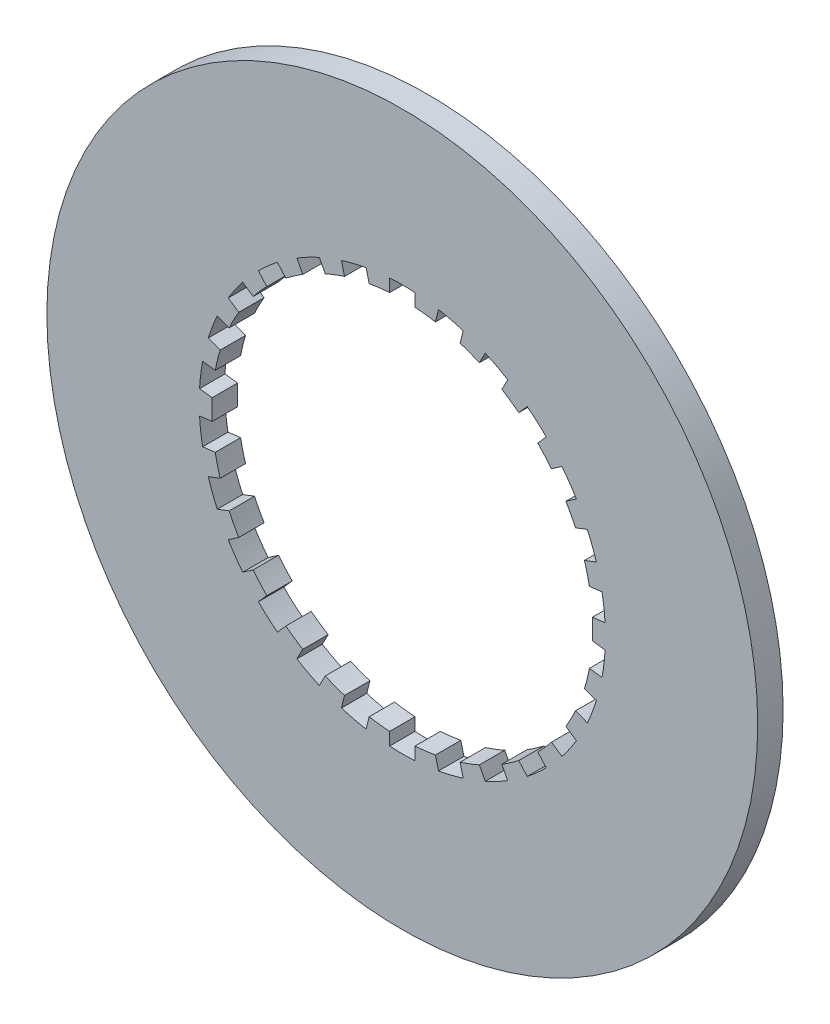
ISO-10303-21;
HEADER;
FILE_DESCRIPTION(('STEP AP214'),'2;1');
FILE_NAME('part.step','',(''),(''),'','','');
FILE_SCHEMA(('AUTOMOTIVE_DESIGN { 1 0 10303 214 1 1 1 1 }'));
ENDSEC;
DATA;
#1=APPLICATION_CONTEXT('core data for automotive mechanical design processes');
#2=APPLICATION_PROTOCOL_DEFINITION('international standard','automotive_design',2000,#1);
#3=PRODUCT_CONTEXT('',#1,'mechanical');
#4=PRODUCT('Part','Part','',(#3));
#5=PRODUCT_RELATED_PRODUCT_CATEGORY('part','',(#4));
#6=PRODUCT_DEFINITION_FORMATION('','',#4);
#7=PRODUCT_DEFINITION_CONTEXT('part definition',#1,'design');
#8=PRODUCT_DEFINITION('design','',#6,#7);
#9=PRODUCT_DEFINITION_SHAPE('','',#8);
#10=(LENGTH_UNIT() NAMED_UNIT(*) SI_UNIT(.MILLI.,.METRE.));
#11=(NAMED_UNIT(*) PLANE_ANGLE_UNIT() SI_UNIT($,.RADIAN.));
#12=(NAMED_UNIT(*) SI_UNIT($,.STERADIAN.) SOLID_ANGLE_UNIT());
#13=UNCERTAINTY_MEASURE_WITH_UNIT(LENGTH_MEASURE(1.E-05),#10,'distance_accuracy_value','');
#14=(GEOMETRIC_REPRESENTATION_CONTEXT(3) GLOBAL_UNCERTAINTY_ASSIGNED_CONTEXT((#13)) GLOBAL_UNIT_ASSIGNED_CONTEXT((#10,
#11,#12)) REPRESENTATION_CONTEXT('',''));
#15=CARTESIAN_POINT('',(0.,0.,0.));
#16=DIRECTION('',(0.,0.,1.));
#17=DIRECTION('',(1.,0.,0.));
#18=AXIS2_PLACEMENT_3D('',#15,#16,#17);
#19=CARTESIAN_POINT('',(0.,0.,1.));
#20=DIRECTION('',(0.,0.,-1.));
#21=DIRECTION('',(-1.,0.,0.));
#22=AXIS2_PLACEMENT_3D('',#19,#20,#21);
#23=CYLINDRICAL_SURFACE('',#22,15.);
#24=CARTESIAN_POINT('',(0.,0.,-1.));
#25=DIRECTION('',(0.,0.,-1.));
#26=DIRECTION('',(-1.,0.,0.));
#27=AXIS2_PLACEMENT_3D('',#24,#25,#26);
#28=CIRCLE('',#27,15.);
#29=CARTESIAN_POINT('',(-6.06988353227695,13.7170154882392,-1.));
#30=VERTEX_POINT('',#29);
#31=CARTESIAN_POINT('',(-4.55269070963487,14.2924108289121,-1.));
#32=VERTEX_POINT('',#31);
#33=EDGE_CURVE('E2400',#30,#32,#28,.T.);
#34=ORIENTED_EDGE('',*,*,#33,.T.);
#35=DIRECTION('',(0.,0.,1.));
#36=VECTOR('',#35,1.);
#37=CARTESIAN_POINT('',(-4.55269070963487,14.2924108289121,-1.));
#38=LINE('',#37,#36);
#39=CARTESIAN_POINT('',(-4.55269070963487,14.2924108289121,1.));
#40=VERTEX_POINT('',#39);
#41=EDGE_CURVE('E2385',#32,#40,#38,.T.);
#42=ORIENTED_EDGE('',*,*,#41,.T.);
#43=CARTESIAN_POINT('',(0.,0.,1.));
#44=DIRECTION('',(0.,0.,-1.));
#45=DIRECTION('',(-1.,0.,0.));
#46=AXIS2_PLACEMENT_3D('',#43,#44,#45);
#47=CIRCLE('',#46,15.);
#48=CARTESIAN_POINT('',(-6.06988353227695,13.7170154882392,1.));
#49=VERTEX_POINT('',#48);
#50=EDGE_CURVE('E690',#49,#40,#47,.T.);
#51=ORIENTED_EDGE('',*,*,#50,.F.);
#52=DIRECTION('',(0.,0.,1.));
#53=VECTOR('',#52,1.);
#54=CARTESIAN_POINT('',(-6.06988353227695,13.7170154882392,-1.));
#55=LINE('',#54,#53);
#56=EDGE_CURVE('E847',#30,#49,#55,.T.);
#57=ORIENTED_EDGE('',*,*,#56,.F.);
#58=EDGE_LOOP('',(#34,#42,#51,#57));
#59=FACE_BOUND('',#58,.T.);
#60=ADVANCED_FACE('F26',(#59),#23,.F.);
#61=CARTESIAN_POINT('',(-9.17620042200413,11.8658057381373,-1.));
#62=VERTEX_POINT('',#61);
#63=CARTESIAN_POINT('',(-7.84079558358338,12.7875691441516,-1.));
#64=VERTEX_POINT('',#63);
#65=EDGE_CURVE('E832',#62,#64,#28,.T.);
#66=ORIENTED_EDGE('',*,*,#65,.T.);
#67=DIRECTION('',(0.,0.,1.));
#68=VECTOR('',#67,1.);
#69=CARTESIAN_POINT('',(-7.84079558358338,12.7875691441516,-1.));
#70=LINE('',#69,#68);
#71=CARTESIAN_POINT('',(-7.84079558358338,12.7875691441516,1.));
#72=VERTEX_POINT('',#71);
#73=EDGE_CURVE('E831',#64,#72,#70,.T.);
#74=ORIENTED_EDGE('',*,*,#73,.T.);
#75=CARTESIAN_POINT('',(-9.17620042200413,11.8658057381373,1.));
#76=VERTEX_POINT('',#75);
#77=EDGE_CURVE('E695',#76,#72,#47,.T.);
#78=ORIENTED_EDGE('',*,*,#77,.F.);
#79=DIRECTION('',(0.,0.,1.));
#80=VECTOR('',#79,1.);
#81=CARTESIAN_POINT('',(-9.17620042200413,11.8658057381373,-1.));
#82=LINE('',#81,#80);
#83=EDGE_CURVE('E829',#62,#76,#82,.T.);
#84=ORIENTED_EDGE('',*,*,#83,.F.);
#85=EDGE_LOOP('',(#66,#74,#78,#84));
#86=FACE_BOUND('',#85,.T.);
#87=ADVANCED_FACE('F828',(#86),#23,.F.);
#88=CARTESIAN_POINT('',(-11.7492298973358,9.32499848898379,-1.));
#89=VERTEX_POINT('',#88);
#90=CARTESIAN_POINT('',(-10.6732219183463,10.5395604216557,-1.));
#91=VERTEX_POINT('',#90);
#92=EDGE_CURVE('E1782',#89,#91,#28,.T.);
#93=ORIENTED_EDGE('',*,*,#92,.T.);
#94=DIRECTION('',(0.,0.,1.));
#95=VECTOR('',#94,1.);
#96=CARTESIAN_POINT('',(-10.6732219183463,10.5395604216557,-1.));
#97=LINE('',#96,#95);
#98=CARTESIAN_POINT('',(-10.6732219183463,10.5395604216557,1.));
#99=VERTEX_POINT('',#98);
#100=EDGE_CURVE('E862',#91,#99,#97,.T.);
#101=ORIENTED_EDGE('',*,*,#100,.T.);
#102=CARTESIAN_POINT('',(-11.7492298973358,9.32499848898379,1.));
#103=VERTEX_POINT('',#102);
#104=EDGE_CURVE('E807',#103,#99,#47,.T.);
#105=ORIENTED_EDGE('',*,*,#104,.F.);
#106=DIRECTION('',(0.,0.,1.));
#107=VECTOR('',#106,1.);
#108=CARTESIAN_POINT('',(-11.7492298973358,9.32499848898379,-1.));
#109=LINE('',#108,#107);
#110=EDGE_CURVE('E887',#89,#103,#109,.T.);
#111=ORIENTED_EDGE('',*,*,#110,.F.);
#112=EDGE_LOOP('',(#93,#101,#105,#111));
#113=FACE_BOUND('',#112,.T.);
#114=ADVANCED_FACE('F1781',(#113),#23,.F.);
#115=CARTESIAN_POINT('',(-13.6394368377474,6.24225622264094,-1.));
#116=VERTEX_POINT('',#115);
#117=CARTESIAN_POINT('',(-12.8853593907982,7.67903075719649,-1.));
#118=VERTEX_POINT('',#117);
#119=EDGE_CURVE('E1768',#116,#118,#28,.T.);
#120=ORIENTED_EDGE('',*,*,#119,.T.);
#121=DIRECTION('',(0.,0.,1.));
#122=VECTOR('',#121,1.);
#123=CARTESIAN_POINT('',(-12.8853593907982,7.67903075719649,-1.));
#124=LINE('',#123,#122);
#125=CARTESIAN_POINT('',(-12.8853593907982,7.67903075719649,1.));
#126=VERTEX_POINT('',#125);
#127=EDGE_CURVE('E888',#118,#126,#124,.T.);
#128=ORIENTED_EDGE('',*,*,#127,.T.);
#129=CARTESIAN_POINT('',(-13.6394368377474,6.24225622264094,1.));
#130=VERTEX_POINT('',#129);
#131=EDGE_CURVE('E802',#130,#126,#47,.T.);
#132=ORIENTED_EDGE('',*,*,#131,.F.);
#133=DIRECTION('',(0.,0.,1.));
#134=VECTOR('',#133,1.);
#135=CARTESIAN_POINT('',(-13.6394368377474,6.24225622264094,-1.));
#136=LINE('',#135,#134);
#137=EDGE_CURVE('E913',#116,#130,#136,.T.);
#138=ORIENTED_EDGE('',*,*,#137,.F.);
#139=EDGE_LOOP('',(#120,#128,#132,#138));
#140=FACE_BOUND('',#139,.T.);
#141=ADVANCED_FACE('F1767',(#140),#23,.F.);
#142=CARTESIAN_POINT('',(-14.7369692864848,2.79673671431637,-1.));
#143=VERTEX_POINT('',#142);
#144=CARTESIAN_POINT('',(-14.3486466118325,4.37222373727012,-1.));
#145=VERTEX_POINT('',#144);
#146=EDGE_CURVE('E1754',#143,#145,#28,.T.);
#147=ORIENTED_EDGE('',*,*,#146,.T.);
#148=DIRECTION('',(0.,0.,1.));
#149=VECTOR('',#148,1.);
#150=CARTESIAN_POINT('',(-14.3486466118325,4.37222373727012,-1.));
#151=LINE('',#150,#149);
#152=CARTESIAN_POINT('',(-14.3486466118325,4.37222373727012,1.));
#153=VERTEX_POINT('',#152);
#154=EDGE_CURVE('E914',#145,#153,#151,.T.);
#155=ORIENTED_EDGE('',*,*,#154,.T.);
#156=CARTESIAN_POINT('',(-14.7369692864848,2.79673671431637,1.));
#157=VERTEX_POINT('',#156);
#158=EDGE_CURVE('E797',#157,#153,#47,.T.);
#159=ORIENTED_EDGE('',*,*,#158,.F.);
#160=DIRECTION('',(0.,0.,1.));
#161=VECTOR('',#160,1.);
#162=CARTESIAN_POINT('',(-14.7369692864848,2.79673671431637,-1.));
#163=LINE('',#162,#161);
#164=EDGE_CURVE('E939',#143,#157,#163,.T.);
#165=ORIENTED_EDGE('',*,*,#164,.F.);
#166=EDGE_LOOP('',(#147,#155,#159,#165));
#167=FACE_BOUND('',#166,.T.);
#168=ADVANCED_FACE('F1753',(#167),#23,.F.);
#169=CARTESIAN_POINT('',(-14.9780426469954,-0.811318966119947,-1.));
#170=VERTEX_POINT('',#169);
#171=CARTESIAN_POINT('',(-14.9780426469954,0.811318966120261,-1.));
#172=VERTEX_POINT('',#171);
#173=EDGE_CURVE('E1740',#170,#172,#28,.T.);
#174=ORIENTED_EDGE('',*,*,#173,.T.);
#175=DIRECTION('',(0.,0.,1.));
#176=VECTOR('',#175,1.);
#177=CARTESIAN_POINT('',(-14.9780426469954,0.811318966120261,-1.));
#178=LINE('',#177,#176);
#179=CARTESIAN_POINT('',(-14.9780426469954,0.811318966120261,1.));
#180=VERTEX_POINT('',#179);
#181=EDGE_CURVE('E940',#172,#180,#178,.T.);
#182=ORIENTED_EDGE('',*,*,#181,.T.);
#183=CARTESIAN_POINT('',(-14.9780426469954,-0.811318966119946,1.));
#184=VERTEX_POINT('',#183);
#185=EDGE_CURVE('E792',#184,#180,#47,.T.);
#186=ORIENTED_EDGE('',*,*,#185,.F.);
#187=DIRECTION('',(0.,0.,1.));
#188=VECTOR('',#187,1.);
#189=CARTESIAN_POINT('',(-14.9780426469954,-0.811318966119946,-1.));
#190=LINE('',#189,#188);
#191=EDGE_CURVE('E965',#170,#184,#190,.T.);
#192=ORIENTED_EDGE('',*,*,#191,.F.);
#193=EDGE_LOOP('',(#174,#182,#186,#192));
#194=FACE_BOUND('',#193,.T.);
#195=ADVANCED_FACE('F1739',(#194),#23,.F.);
#196=CARTESIAN_POINT('',(-14.3486466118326,-4.37222373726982,-1.));
#197=VERTEX_POINT('',#196);
#198=CARTESIAN_POINT('',(-14.7369692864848,-2.79673671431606,-1.));
#199=VERTEX_POINT('',#198);
#200=EDGE_CURVE('E1726',#197,#199,#28,.T.);
#201=ORIENTED_EDGE('',*,*,#200,.T.);
#202=DIRECTION('',(0.,0.,1.));
#203=VECTOR('',#202,1.);
#204=CARTESIAN_POINT('',(-14.7369692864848,-2.79673671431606,-1.));
#205=LINE('',#204,#203);
#206=CARTESIAN_POINT('',(-14.7369692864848,-2.79673671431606,1.));
#207=VERTEX_POINT('',#206);
#208=EDGE_CURVE('E966',#199,#207,#205,.T.);
#209=ORIENTED_EDGE('',*,*,#208,.T.);
#210=CARTESIAN_POINT('',(-14.3486466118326,-4.37222373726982,1.));
#211=VERTEX_POINT('',#210);
#212=EDGE_CURVE('E787',#211,#207,#47,.T.);
#213=ORIENTED_EDGE('',*,*,#212,.F.);
#214=DIRECTION('',(0.,0.,1.));
#215=VECTOR('',#214,1.);
#216=CARTESIAN_POINT('',(-14.3486466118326,-4.37222373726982,-1.));
#217=LINE('',#216,#215);
#218=EDGE_CURVE('E991',#197,#211,#217,.T.);
#219=ORIENTED_EDGE('',*,*,#218,.F.);
#220=EDGE_LOOP('',(#201,#209,#213,#219));
#221=FACE_BOUND('',#220,.T.);
#222=ADVANCED_FACE('F1725',(#221),#23,.F.);
#223=CARTESIAN_POINT('',(-12.8853593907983,-7.67903075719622,-1.));
#224=VERTEX_POINT('',#223);
#225=CARTESIAN_POINT('',(-13.6394368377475,-6.24225622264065,-1.));
#226=VERTEX_POINT('',#225);
#227=EDGE_CURVE('E1712',#224,#226,#28,.T.);
#228=ORIENTED_EDGE('',*,*,#227,.T.);
#229=DIRECTION('',(0.,0.,1.));
#230=VECTOR('',#229,1.);
#231=CARTESIAN_POINT('',(-13.6394368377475,-6.24225622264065,-1.));
#232=LINE('',#231,#230);
#233=CARTESIAN_POINT('',(-13.6394368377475,-6.24225622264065,1.));
#234=VERTEX_POINT('',#233);
#235=EDGE_CURVE('E992',#226,#234,#232,.T.);
#236=ORIENTED_EDGE('',*,*,#235,.T.);
#237=CARTESIAN_POINT('',(-12.8853593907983,-7.67903075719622,1.));
#238=VERTEX_POINT('',#237);
#239=EDGE_CURVE('E782',#238,#234,#47,.T.);
#240=ORIENTED_EDGE('',*,*,#239,.F.);
#241=DIRECTION('',(0.,0.,1.));
#242=VECTOR('',#241,1.);
#243=CARTESIAN_POINT('',(-12.8853593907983,-7.67903075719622,-1.));
#244=LINE('',#243,#242);
#245=EDGE_CURVE('E1017',#224,#238,#244,.T.);
#246=ORIENTED_EDGE('',*,*,#245,.F.);
#247=EDGE_LOOP('',(#228,#236,#240,#246));
#248=FACE_BOUND('',#247,.T.);
#249=ADVANCED_FACE('F1711',(#248),#23,.F.);
#250=CARTESIAN_POINT('',(-10.6732219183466,-10.5395604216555,-1.));
#251=VERTEX_POINT('',#250);
#252=CARTESIAN_POINT('',(-11.749229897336,-9.32499848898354,-1.));
#253=VERTEX_POINT('',#252);
#254=EDGE_CURVE('E1698',#251,#253,#28,.T.);
#255=ORIENTED_EDGE('',*,*,#254,.T.);
#256=DIRECTION('',(0.,0.,1.));
#257=VECTOR('',#256,1.);
#258=CARTESIAN_POINT('',(-11.749229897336,-9.32499848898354,-1.));
#259=LINE('',#258,#257);
#260=CARTESIAN_POINT('',(-11.749229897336,-9.32499848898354,1.));
#261=VERTEX_POINT('',#260);
#262=EDGE_CURVE('E1018',#253,#261,#259,.T.);
#263=ORIENTED_EDGE('',*,*,#262,.T.);
#264=CARTESIAN_POINT('',(-10.6732219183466,-10.5395604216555,1.));
#265=VERTEX_POINT('',#264);
#266=EDGE_CURVE('E777',#265,#261,#47,.T.);
#267=ORIENTED_EDGE('',*,*,#266,.F.);
#268=DIRECTION('',(0.,0.,1.));
#269=VECTOR('',#268,1.);
#270=CARTESIAN_POINT('',(-10.6732219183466,-10.5395604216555,-1.));
#271=LINE('',#270,#269);
#272=EDGE_CURVE('E1043',#251,#265,#271,.T.);
#273=ORIENTED_EDGE('',*,*,#272,.F.);
#274=EDGE_LOOP('',(#255,#263,#267,#273));
#275=FACE_BOUND('',#274,.T.);
#276=ADVANCED_FACE('F1697',(#275),#23,.F.);
#277=CARTESIAN_POINT('',(-7.84079558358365,-12.7875691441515,-1.));
#278=VERTEX_POINT('',#277);
#279=CARTESIAN_POINT('',(-9.17620042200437,-11.8658057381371,-1.));
#280=VERTEX_POINT('',#279);
#281=EDGE_CURVE('E1684',#278,#280,#28,.T.);
#282=ORIENTED_EDGE('',*,*,#281,.T.);
#283=DIRECTION('',(0.,0.,1.));
#284=VECTOR('',#283,1.);
#285=CARTESIAN_POINT('',(-9.17620042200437,-11.8658057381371,-1.));
#286=LINE('',#285,#284);
#287=CARTESIAN_POINT('',(-9.17620042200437,-11.8658057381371,1.));
#288=VERTEX_POINT('',#287);
#289=EDGE_CURVE('E1044',#280,#288,#286,.T.);
#290=ORIENTED_EDGE('',*,*,#289,.T.);
#291=CARTESIAN_POINT('',(-7.84079558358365,-12.7875691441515,1.));
#292=VERTEX_POINT('',#291);
#293=EDGE_CURVE('E772',#292,#288,#47,.T.);
#294=ORIENTED_EDGE('',*,*,#293,.F.);
#295=DIRECTION('',(0.,0.,1.));
#296=VECTOR('',#295,1.);
#297=CARTESIAN_POINT('',(-7.84079558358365,-12.7875691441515,-1.));
#298=LINE('',#297,#296);
#299=EDGE_CURVE('E1069',#278,#292,#298,.T.);
#300=ORIENTED_EDGE('',*,*,#299,.F.);
#301=EDGE_LOOP('',(#282,#290,#294,#300));
#302=FACE_BOUND('',#301,.T.);
#303=ADVANCED_FACE('F1683',(#302),#23,.F.);
#304=CARTESIAN_POINT('',(-4.55269070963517,-14.292410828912,-1.));
#305=VERTEX_POINT('',#304);
#306=CARTESIAN_POINT('',(-6.06988353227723,-13.717015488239,-1.));
#307=VERTEX_POINT('',#306);
#308=EDGE_CURVE('E1670',#305,#307,#28,.T.);
#309=ORIENTED_EDGE('',*,*,#308,.T.);
#310=DIRECTION('',(0.,0.,1.));
#311=VECTOR('',#310,1.);
#312=CARTESIAN_POINT('',(-6.06988353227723,-13.717015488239,-1.));
#313=LINE('',#312,#311);
#314=CARTESIAN_POINT('',(-6.06988353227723,-13.717015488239,1.));
#315=VERTEX_POINT('',#314);
#316=EDGE_CURVE('E1070',#307,#315,#313,.T.);
#317=ORIENTED_EDGE('',*,*,#316,.T.);
#318=CARTESIAN_POINT('',(-4.55269070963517,-14.292410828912,1.));
#319=VERTEX_POINT('',#318);
#320=EDGE_CURVE('E767',#319,#315,#47,.T.);
#321=ORIENTED_EDGE('',*,*,#320,.F.);
#322=DIRECTION('',(0.,0.,1.));
#323=VECTOR('',#322,1.);
#324=CARTESIAN_POINT('',(-4.55269070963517,-14.292410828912,-1.));
#325=LINE('',#324,#323);
#326=EDGE_CURVE('E1095',#305,#319,#325,.T.);
#327=ORIENTED_EDGE('',*,*,#326,.F.);
#328=EDGE_LOOP('',(#309,#317,#321,#327));
#329=FACE_BOUND('',#328,.T.);
#330=ADVANCED_FACE('F1669',(#329),#23,.F.);
#331=CARTESIAN_POINT('',(-1.00000000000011,-14.9666295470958,-1.));
#332=VERTEX_POINT('',#331);
#333=CARTESIAN_POINT('',(-2.61080707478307,-14.7710421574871,-1.));
#334=VERTEX_POINT('',#333);
#335=EDGE_CURVE('E1656',#332,#334,#28,.T.);
#336=ORIENTED_EDGE('',*,*,#335,.T.);
#337=DIRECTION('',(0.,0.,1.));
#338=VECTOR('',#337,1.);
#339=CARTESIAN_POINT('',(-2.61080707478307,-14.7710421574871,-1.));
#340=LINE('',#339,#338);
#341=CARTESIAN_POINT('',(-2.61080707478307,-14.7710421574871,1.));
#342=VERTEX_POINT('',#341);
#343=EDGE_CURVE('E1096',#334,#342,#340,.T.);
#344=ORIENTED_EDGE('',*,*,#343,.T.);
#345=CARTESIAN_POINT('',(-1.00000000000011,-14.9666295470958,1.));
#346=VERTEX_POINT('',#345);
#347=EDGE_CURVE('E762',#346,#342,#47,.T.);
#348=ORIENTED_EDGE('',*,*,#347,.F.);
#349=DIRECTION('',(0.,0.,1.));
#350=VECTOR('',#349,1.);
#351=CARTESIAN_POINT('',(-1.00000000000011,-14.9666295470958,-1.));
#352=LINE('',#351,#350);
#353=EDGE_CURVE('E1121',#332,#346,#352,.T.);
#354=ORIENTED_EDGE('',*,*,#353,.F.);
#355=EDGE_LOOP('',(#336,#344,#348,#354));
#356=FACE_BOUND('',#355,.T.);
#357=ADVANCED_FACE('F1655',(#356),#23,.F.);
#358=CARTESIAN_POINT('',(2.61080707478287,-14.7710421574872,-1.));
#359=VERTEX_POINT('',#358);
#360=CARTESIAN_POINT('',(0.999999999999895,-14.9666295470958,-1.));
#361=VERTEX_POINT('',#360);
#362=EDGE_CURVE('E1642',#359,#361,#28,.T.);
#363=ORIENTED_EDGE('',*,*,#362,.T.);
#364=DIRECTION('',(0.,0.,1.));
#365=VECTOR('',#364,1.);
#366=CARTESIAN_POINT('',(0.999999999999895,-14.9666295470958,-1.));
#367=LINE('',#366,#365);
#368=CARTESIAN_POINT('',(0.999999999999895,-14.9666295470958,1.));
#369=VERTEX_POINT('',#368);
#370=EDGE_CURVE('E1122',#361,#369,#367,.T.);
#371=ORIENTED_EDGE('',*,*,#370,.T.);
#372=CARTESIAN_POINT('',(2.61080707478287,-14.7710421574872,1.));
#373=VERTEX_POINT('',#372);
#374=EDGE_CURVE('E757',#373,#369,#47,.T.);
#375=ORIENTED_EDGE('',*,*,#374,.F.);
#376=DIRECTION('',(0.,0.,1.));
#377=VECTOR('',#376,1.);
#378=CARTESIAN_POINT('',(2.61080707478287,-14.7710421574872,-1.));
#379=LINE('',#378,#377);
#380=EDGE_CURVE('E1147',#359,#373,#379,.T.);
#381=ORIENTED_EDGE('',*,*,#380,.F.);
#382=EDGE_LOOP('',(#363,#371,#375,#381));
#383=FACE_BOUND('',#382,.T.);
#384=ADVANCED_FACE('F1641',(#383),#23,.F.);
#385=CARTESIAN_POINT('',(6.06988353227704,-13.7170154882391,-1.));
#386=VERTEX_POINT('',#385);
#387=CARTESIAN_POINT('',(4.55269070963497,-14.2924108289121,-1.));
#388=VERTEX_POINT('',#387);
#389=EDGE_CURVE('E1628',#386,#388,#28,.T.);
#390=ORIENTED_EDGE('',*,*,#389,.T.);
#391=DIRECTION('',(0.,0.,1.));
#392=VECTOR('',#391,1.);
#393=CARTESIAN_POINT('',(4.55269070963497,-14.2924108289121,-1.));
#394=LINE('',#393,#392);
#395=CARTESIAN_POINT('',(4.55269070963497,-14.2924108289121,1.));
#396=VERTEX_POINT('',#395);
#397=EDGE_CURVE('E1148',#388,#396,#394,.T.);
#398=ORIENTED_EDGE('',*,*,#397,.T.);
#399=CARTESIAN_POINT('',(6.06988353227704,-13.7170154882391,1.));
#400=VERTEX_POINT('',#399);
#401=EDGE_CURVE('E752',#400,#396,#47,.T.);
#402=ORIENTED_EDGE('',*,*,#401,.F.);
#403=DIRECTION('',(0.,0.,1.));
#404=VECTOR('',#403,1.);
#405=CARTESIAN_POINT('',(6.06988353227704,-13.7170154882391,-1.));
#406=LINE('',#405,#404);
#407=EDGE_CURVE('E1173',#386,#400,#406,.T.);
#408=ORIENTED_EDGE('',*,*,#407,.F.);
#409=EDGE_LOOP('',(#390,#398,#402,#408));
#410=FACE_BOUND('',#409,.T.);
#411=ADVANCED_FACE('F1627',(#410),#23,.F.);
#412=CARTESIAN_POINT('',(9.17620042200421,-11.8658057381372,-1.));
#413=VERTEX_POINT('',#412);
#414=CARTESIAN_POINT('',(7.84079558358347,-12.7875691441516,-1.));
#415=VERTEX_POINT('',#414);
#416=EDGE_CURVE('E1614',#413,#415,#28,.T.);
#417=ORIENTED_EDGE('',*,*,#416,.T.);
#418=DIRECTION('',(0.,0.,1.));
#419=VECTOR('',#418,1.);
#420=CARTESIAN_POINT('',(7.84079558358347,-12.7875691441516,-1.));
#421=LINE('',#420,#419);
#422=CARTESIAN_POINT('',(7.84079558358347,-12.7875691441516,1.));
#423=VERTEX_POINT('',#422);
#424=EDGE_CURVE('E1174',#415,#423,#421,.T.);
#425=ORIENTED_EDGE('',*,*,#424,.T.);
#426=CARTESIAN_POINT('',(9.17620042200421,-11.8658057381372,1.));
#427=VERTEX_POINT('',#426);
#428=EDGE_CURVE('E747',#427,#423,#47,.T.);
#429=ORIENTED_EDGE('',*,*,#428,.F.);
#430=DIRECTION('',(0.,0.,1.));
#431=VECTOR('',#430,1.);
#432=CARTESIAN_POINT('',(9.17620042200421,-11.8658057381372,-1.));
#433=LINE('',#432,#431);
#434=EDGE_CURVE('E1199',#413,#427,#433,.T.);
#435=ORIENTED_EDGE('',*,*,#434,.F.);
#436=EDGE_LOOP('',(#417,#425,#429,#435));
#437=FACE_BOUND('',#436,.T.);
#438=ADVANCED_FACE('F1613',(#437),#23,.F.);
#439=CARTESIAN_POINT('',(11.7492298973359,-9.3249984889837,-1.));
#440=VERTEX_POINT('',#439);
#441=CARTESIAN_POINT('',(10.6732219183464,-10.5395604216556,-1.));
#442=VERTEX_POINT('',#441);
#443=EDGE_CURVE('E1600',#440,#442,#28,.T.);
#444=ORIENTED_EDGE('',*,*,#443,.T.);
#445=DIRECTION('',(0.,0.,1.));
#446=VECTOR('',#445,1.);
#447=CARTESIAN_POINT('',(10.6732219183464,-10.5395604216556,-1.));
#448=LINE('',#447,#446);
#449=CARTESIAN_POINT('',(10.6732219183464,-10.5395604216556,1.));
#450=VERTEX_POINT('',#449);
#451=EDGE_CURVE('E1200',#442,#450,#448,.T.);
#452=ORIENTED_EDGE('',*,*,#451,.T.);
#453=CARTESIAN_POINT('',(11.7492298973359,-9.3249984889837,1.));
#454=VERTEX_POINT('',#453);
#455=EDGE_CURVE('E742',#454,#450,#47,.T.);
#456=ORIENTED_EDGE('',*,*,#455,.F.);
#457=DIRECTION('',(0.,0.,1.));
#458=VECTOR('',#457,1.);
#459=CARTESIAN_POINT('',(11.7492298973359,-9.3249984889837,-1.));
#460=LINE('',#459,#458);
#461=EDGE_CURVE('E1225',#440,#454,#460,.T.);
#462=ORIENTED_EDGE('',*,*,#461,.F.);
#463=EDGE_LOOP('',(#444,#452,#456,#462));
#464=FACE_BOUND('',#463,.T.);
#465=ADVANCED_FACE('F1599',(#464),#23,.F.);
#466=CARTESIAN_POINT('',(13.6394368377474,-6.24225622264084,-1.));
#467=VERTEX_POINT('',#466);
#468=CARTESIAN_POINT('',(12.8853593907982,-7.67903075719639,-1.));
#469=VERTEX_POINT('',#468);
#470=EDGE_CURVE('E1586',#467,#469,#28,.T.);
#471=ORIENTED_EDGE('',*,*,#470,.T.);
#472=DIRECTION('',(0.,0.,1.));
#473=VECTOR('',#472,1.);
#474=CARTESIAN_POINT('',(12.8853593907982,-7.67903075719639,-1.));
#475=LINE('',#474,#473);
#476=CARTESIAN_POINT('',(12.8853593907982,-7.67903075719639,1.));
#477=VERTEX_POINT('',#476);
#478=EDGE_CURVE('E1226',#469,#477,#475,.T.);
#479=ORIENTED_EDGE('',*,*,#478,.T.);
#480=CARTESIAN_POINT('',(13.6394368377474,-6.24225622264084,1.));
#481=VERTEX_POINT('',#480);
#482=EDGE_CURVE('E737',#481,#477,#47,.T.);
#483=ORIENTED_EDGE('',*,*,#482,.F.);
#484=DIRECTION('',(0.,0.,1.));
#485=VECTOR('',#484,1.);
#486=CARTESIAN_POINT('',(13.6394368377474,-6.24225622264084,-1.));
#487=LINE('',#486,#485);
#488=EDGE_CURVE('E1251',#467,#481,#487,.T.);
#489=ORIENTED_EDGE('',*,*,#488,.F.);
#490=EDGE_LOOP('',(#471,#479,#483,#489));
#491=FACE_BOUND('',#490,.T.);
#492=ADVANCED_FACE('F1585',(#491),#23,.F.);
#493=CARTESIAN_POINT('',(14.7369692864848,-2.79673671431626,-1.));
#494=VERTEX_POINT('',#493);
#495=CARTESIAN_POINT('',(14.3486466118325,-4.37222373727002,-1.));
#496=VERTEX_POINT('',#495);
#497=EDGE_CURVE('E1572',#494,#496,#28,.T.);
#498=ORIENTED_EDGE('',*,*,#497,.T.);
#499=DIRECTION('',(0.,0.,1.));
#500=VECTOR('',#499,1.);
#501=CARTESIAN_POINT('',(14.3486466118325,-4.37222373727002,-1.));
#502=LINE('',#501,#500);
#503=CARTESIAN_POINT('',(14.3486466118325,-4.37222373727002,1.));
#504=VERTEX_POINT('',#503);
#505=EDGE_CURVE('E1252',#496,#504,#502,.T.);
#506=ORIENTED_EDGE('',*,*,#505,.T.);
#507=CARTESIAN_POINT('',(14.7369692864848,-2.79673671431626,1.));
#508=VERTEX_POINT('',#507);
#509=EDGE_CURVE('E732',#508,#504,#47,.T.);
#510=ORIENTED_EDGE('',*,*,#509,.F.);
#511=DIRECTION('',(0.,0.,1.));
#512=VECTOR('',#511,1.);
#513=CARTESIAN_POINT('',(14.7369692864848,-2.79673671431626,-1.));
#514=LINE('',#513,#512);
#515=EDGE_CURVE('E1277',#494,#508,#514,.T.);
#516=ORIENTED_EDGE('',*,*,#515,.F.);
#517=EDGE_LOOP('',(#498,#506,#510,#516));
#518=FACE_BOUND('',#517,.T.);
#519=ADVANCED_FACE('F1571',(#518),#23,.F.);
#520=CARTESIAN_POINT('',(14.9780426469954,0.811318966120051,-1.));
#521=VERTEX_POINT('',#520);
#522=CARTESIAN_POINT('',(14.9780426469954,-0.811318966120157,-1.));
#523=VERTEX_POINT('',#522);
#524=EDGE_CURVE('E1558',#521,#523,#28,.T.);
#525=ORIENTED_EDGE('',*,*,#524,.T.);
#526=DIRECTION('',(0.,0.,1.));
#527=VECTOR('',#526,1.);
#528=CARTESIAN_POINT('',(14.9780426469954,-0.811318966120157,-1.));
#529=LINE('',#528,#527);
#530=CARTESIAN_POINT('',(14.9780426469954,-0.811318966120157,1.));
#531=VERTEX_POINT('',#530);
#532=EDGE_CURVE('E1278',#523,#531,#529,.T.);
#533=ORIENTED_EDGE('',*,*,#532,.T.);
#534=CARTESIAN_POINT('',(14.9780426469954,0.811318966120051,1.));
#535=VERTEX_POINT('',#534);
#536=EDGE_CURVE('E727',#535,#531,#47,.T.);
#537=ORIENTED_EDGE('',*,*,#536,.F.);
#538=DIRECTION('',(0.,0.,1.));
#539=VECTOR('',#538,1.);
#540=CARTESIAN_POINT('',(14.9780426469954,0.811318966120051,-1.));
#541=LINE('',#540,#539);
#542=EDGE_CURVE('E1303',#521,#535,#541,.T.);
#543=ORIENTED_EDGE('',*,*,#542,.F.);
#544=EDGE_LOOP('',(#525,#533,#537,#543));
#545=FACE_BOUND('',#544,.T.);
#546=ADVANCED_FACE('F1557',(#545),#23,.F.);
#547=CARTESIAN_POINT('',(14.3486466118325,4.37222373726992,-1.));
#548=VERTEX_POINT('',#547);
#549=CARTESIAN_POINT('',(14.7369692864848,2.79673671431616,-1.));
#550=VERTEX_POINT('',#549);
#551=EDGE_CURVE('E1544',#548,#550,#28,.T.);
#552=ORIENTED_EDGE('',*,*,#551,.T.);
#553=DIRECTION('',(0.,0.,1.));
#554=VECTOR('',#553,1.);
#555=CARTESIAN_POINT('',(14.7369692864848,2.79673671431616,-1.));
#556=LINE('',#555,#554);
#557=CARTESIAN_POINT('',(14.7369692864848,2.79673671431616,1.));
#558=VERTEX_POINT('',#557);
#559=EDGE_CURVE('E1304',#550,#558,#556,.T.);
#560=ORIENTED_EDGE('',*,*,#559,.T.);
#561=CARTESIAN_POINT('',(14.3486466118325,4.37222373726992,1.));
#562=VERTEX_POINT('',#561);
#563=EDGE_CURVE('E722',#562,#558,#47,.T.);
#564=ORIENTED_EDGE('',*,*,#563,.F.);
#565=DIRECTION('',(0.,0.,1.));
#566=VECTOR('',#565,1.);
#567=CARTESIAN_POINT('',(14.3486466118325,4.37222373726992,-1.));
#568=LINE('',#567,#566);
#569=EDGE_CURVE('E1329',#548,#562,#568,.T.);
#570=ORIENTED_EDGE('',*,*,#569,.F.);
#571=EDGE_LOOP('',(#552,#560,#564,#570));
#572=FACE_BOUND('',#571,.T.);
#573=ADVANCED_FACE('F1543',(#572),#23,.F.);
#574=CARTESIAN_POINT('',(12.8853593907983,7.67903075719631,-1.));
#575=VERTEX_POINT('',#574);
#576=CARTESIAN_POINT('',(13.6394368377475,6.24225622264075,-1.));
#577=VERTEX_POINT('',#576);
#578=EDGE_CURVE('E1530',#575,#577,#28,.T.);
#579=ORIENTED_EDGE('',*,*,#578,.T.);
#580=DIRECTION('',(0.,0.,1.));
#581=VECTOR('',#580,1.);
#582=CARTESIAN_POINT('',(13.6394368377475,6.24225622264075,-1.));
#583=LINE('',#582,#581);
#584=CARTESIAN_POINT('',(13.6394368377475,6.24225622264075,1.));
#585=VERTEX_POINT('',#584);
#586=EDGE_CURVE('E1330',#577,#585,#583,.T.);
#587=ORIENTED_EDGE('',*,*,#586,.T.);
#588=CARTESIAN_POINT('',(12.8853593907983,7.6790307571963,1.));
#589=VERTEX_POINT('',#588);
#590=EDGE_CURVE('E717',#589,#585,#47,.T.);
#591=ORIENTED_EDGE('',*,*,#590,.F.);
#592=DIRECTION('',(0.,0.,1.));
#593=VECTOR('',#592,1.);
#594=CARTESIAN_POINT('',(12.8853593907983,7.6790307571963,-1.));
#595=LINE('',#594,#593);
#596=EDGE_CURVE('E1355',#575,#589,#595,.T.);
#597=ORIENTED_EDGE('',*,*,#596,.F.);
#598=EDGE_LOOP('',(#579,#587,#591,#597));
#599=FACE_BOUND('',#598,.T.);
#600=ADVANCED_FACE('F1529',(#599),#23,.F.);
#601=CARTESIAN_POINT('',(10.6732219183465,10.5395604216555,-1.));
#602=VERTEX_POINT('',#601);
#603=CARTESIAN_POINT('',(11.749229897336,9.32499848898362,-1.));
#604=VERTEX_POINT('',#603);
#605=EDGE_CURVE('E1516',#602,#604,#28,.T.);
#606=ORIENTED_EDGE('',*,*,#605,.T.);
#607=DIRECTION('',(0.,0.,1.));
#608=VECTOR('',#607,1.);
#609=CARTESIAN_POINT('',(11.749229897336,9.32499848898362,-1.));
#610=LINE('',#609,#608);
#611=CARTESIAN_POINT('',(11.749229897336,9.32499848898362,1.));
#612=VERTEX_POINT('',#611);
#613=EDGE_CURVE('E1356',#604,#612,#610,.T.);
#614=ORIENTED_EDGE('',*,*,#613,.T.);
#615=CARTESIAN_POINT('',(10.6732219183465,10.5395604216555,1.));
#616=VERTEX_POINT('',#615);
#617=EDGE_CURVE('E712',#616,#612,#47,.T.);
#618=ORIENTED_EDGE('',*,*,#617,.F.);
#619=DIRECTION('',(0.,0.,1.));
#620=VECTOR('',#619,1.);
#621=CARTESIAN_POINT('',(10.6732219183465,10.5395604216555,-1.));
#622=LINE('',#621,#620);
#623=EDGE_CURVE('E1381',#602,#616,#622,.T.);
#624=ORIENTED_EDGE('',*,*,#623,.F.);
#625=EDGE_LOOP('',(#606,#614,#618,#624));
#626=FACE_BOUND('',#625,.T.);
#627=ADVANCED_FACE('F1515',(#626),#23,.F.);
#628=CARTESIAN_POINT('',(7.84079558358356,12.7875691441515,-1.));
#629=VERTEX_POINT('',#628);
#630=CARTESIAN_POINT('',(9.17620042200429,11.8658057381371,-1.));
#631=VERTEX_POINT('',#630);
#632=EDGE_CURVE('E1502',#629,#631,#28,.T.);
#633=ORIENTED_EDGE('',*,*,#632,.T.);
#634=DIRECTION('',(0.,0.,1.));
#635=VECTOR('',#634,1.);
#636=CARTESIAN_POINT('',(9.17620042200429,11.8658057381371,-1.));
#637=LINE('',#636,#635);
#638=CARTESIAN_POINT('',(9.17620042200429,11.8658057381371,1.));
#639=VERTEX_POINT('',#638);
#640=EDGE_CURVE('E1382',#631,#639,#637,.T.);
#641=ORIENTED_EDGE('',*,*,#640,.T.);
#642=CARTESIAN_POINT('',(7.84079558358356,12.7875691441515,1.));
#643=VERTEX_POINT('',#642);
#644=EDGE_CURVE('E707',#643,#639,#47,.T.);
#645=ORIENTED_EDGE('',*,*,#644,.F.);
#646=DIRECTION('',(0.,0.,1.));
#647=VECTOR('',#646,1.);
#648=CARTESIAN_POINT('',(7.84079558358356,12.7875691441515,-1.));
#649=LINE('',#648,#647);
#650=EDGE_CURVE('E1407',#629,#643,#649,.T.);
#651=ORIENTED_EDGE('',*,*,#650,.F.);
#652=EDGE_LOOP('',(#633,#641,#645,#651));
#653=FACE_BOUND('',#652,.T.);
#654=ADVANCED_FACE('F1501',(#653),#23,.F.);
#655=CARTESIAN_POINT('',(4.55269070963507,14.2924108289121,-1.));
#656=VERTEX_POINT('',#655);
#657=CARTESIAN_POINT('',(6.06988353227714,13.7170154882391,-1.));
#658=VERTEX_POINT('',#657);
#659=EDGE_CURVE('E697',#656,#658,#28,.T.);
#660=ORIENTED_EDGE('',*,*,#659,.T.);
#661=DIRECTION('',(0.,0.,1.));
#662=VECTOR('',#661,1.);
#663=CARTESIAN_POINT('',(6.06988353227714,13.7170154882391,-1.));
#664=LINE('',#663,#662);
#665=CARTESIAN_POINT('',(6.06988353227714,13.7170154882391,1.));
#666=VERTEX_POINT('',#665);
#667=EDGE_CURVE('E1408',#658,#666,#664,.T.);
#668=ORIENTED_EDGE('',*,*,#667,.T.);
#669=CARTESIAN_POINT('',(4.55269070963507,14.2924108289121,1.));
#670=VERTEX_POINT('',#669);
#671=EDGE_CURVE('E701',#670,#666,#47,.T.);
#672=ORIENTED_EDGE('',*,*,#671,.F.);
#673=DIRECTION('',(0.,0.,1.));
#674=VECTOR('',#673,1.);
#675=CARTESIAN_POINT('',(4.55269070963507,14.2924108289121,-1.));
#676=LINE('',#675,#674);
#677=EDGE_CURVE('E1433',#656,#670,#676,.T.);
#678=ORIENTED_EDGE('',*,*,#677,.F.);
#679=EDGE_LOOP('',(#660,#668,#672,#678));
#680=FACE_BOUND('',#679,.T.);
#681=ADVANCED_FACE('F1488',(#680),#23,.F.);
#682=CARTESIAN_POINT('',(1.,14.9666295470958,-1.));
#683=VERTEX_POINT('',#682);
#684=CARTESIAN_POINT('',(2.61080707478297,14.7710421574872,-1.));
#685=VERTEX_POINT('',#684);
#686=EDGE_CURVE('E691',#683,#685,#28,.T.);
#687=ORIENTED_EDGE('',*,*,#686,.T.);
#688=DIRECTION('',(0.,0.,1.));
#689=VECTOR('',#688,1.);
#690=CARTESIAN_POINT('',(2.61080707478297,14.7710421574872,-1.));
#691=LINE('',#690,#689);
#692=CARTESIAN_POINT('',(2.61080707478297,14.7710421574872,1.));
#693=VERTEX_POINT('',#692);
#694=EDGE_CURVE('E1434',#685,#693,#691,.T.);
#695=ORIENTED_EDGE('',*,*,#694,.T.);
#696=CARTESIAN_POINT('',(1.,14.9666295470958,1.));
#697=VERTEX_POINT('',#696);
#698=EDGE_CURVE('E693',#697,#693,#47,.T.);
#699=ORIENTED_EDGE('',*,*,#698,.F.);
#700=DIRECTION('',(0.,0.,1.));
#701=VECTOR('',#700,1.);
#702=CARTESIAN_POINT('',(1.,14.9666295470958,-1.));
#703=LINE('',#702,#701);
#704=EDGE_CURVE('E1459',#683,#697,#703,.T.);
#705=ORIENTED_EDGE('',*,*,#704,.F.);
#706=EDGE_LOOP('',(#687,#695,#699,#705));
#707=FACE_BOUND('',#706,.T.);
#708=ADVANCED_FACE('F1471',(#707),#23,.F.);
#709=CARTESIAN_POINT('',(0.,0.,1.));
#710=DIRECTION('',(0.,0.,-1.));
#711=DIRECTION('',(-1.,0.,0.));
#712=AXIS2_PLACEMENT_3D('',#709,#710,#711);
#713=CYLINDRICAL_SURFACE('',#712,28.);
#714=CARTESIAN_POINT('',(0.,0.,1.));
#715=DIRECTION('',(0.,0.,1.));
#716=DIRECTION('',(1.,0.,0.));
#717=AXIS2_PLACEMENT_3D('',#714,#715,#716);
#718=CIRCLE('',#717,28.);
#719=CARTESIAN_POINT('',(28.,0.,1.));
#720=VERTEX_POINT('',#719);
#721=EDGE_CURVE('E11',#720,#720,#718,.T.);
#722=ORIENTED_EDGE('',*,*,#721,.F.);
#723=EDGE_LOOP('',(#722));
#724=FACE_BOUND('',#723,.T.);
#725=CARTESIAN_POINT('',(0.,0.,-1.));
#726=DIRECTION('',(0.,0.,1.));
#727=DIRECTION('',(1.,0.,0.));
#728=AXIS2_PLACEMENT_3D('',#725,#726,#727);
#729=CIRCLE('',#728,28.);
#730=CARTESIAN_POINT('',(28.,0.,-1.));
#731=VERTEX_POINT('',#730);
#732=EDGE_CURVE('E34',#731,#731,#729,.T.);
#733=ORIENTED_EDGE('',*,*,#732,.T.);
#734=EDGE_LOOP('',(#733));
#735=FACE_BOUND('',#734,.T.);
#736=ADVANCED_FACE('F28',(#724,#735),#713,.T.);
#737=CARTESIAN_POINT('',(0.,0.,1.));
#738=DIRECTION('',(0.,0.,1.));
#739=DIRECTION('',(1.,0.,0.));
#740=AXIS2_PLACEMENT_3D('',#737,#738,#739);
#741=PLANE('',#740);
#742=DIRECTION('',(0.239315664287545,-0.970941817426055,0.));
#743=VECTOR('',#742,1.);
#744=CARTESIAN_POINT('',(-4.79250651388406,15.2653817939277,1.));
#745=LINE('',#744,#743);
#746=CARTESIAN_POINT('',(-4.79250651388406,15.2653817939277,1.));
#747=VERTEX_POINT('',#746);
#748=EDGE_CURVE('E2373',#747,#40,#745,.T.);
#749=ORIENTED_EDGE('',*,*,#748,.F.);
#750=CARTESIAN_POINT('',(0.,0.,1.));
#751=DIRECTION('',(0.,0.,1.));
#752=DIRECTION('',(0.970941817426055,0.239315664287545,0.));
#753=AXIS2_PLACEMENT_3D('',#750,#751,#752);
#754=CIRCLE('',#753,16.);
#755=CARTESIAN_POINT('',(-2.85062287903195,15.7440131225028,1.));
#756=VERTEX_POINT('',#755);
#757=EDGE_CURVE('E684',#756,#747,#754,.T.);
#758=ORIENTED_EDGE('',*,*,#757,.F.);
#759=DIRECTION('',(-0.239315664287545,0.970941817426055,0.));
#760=VECTOR('',#759,1.);
#761=CARTESIAN_POINT('',(-2.85062287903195,15.7440131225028,1.));
#762=LINE('',#761,#760);
#763=CARTESIAN_POINT('',(-2.61080707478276,14.7710421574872,1.));
#764=VERTEX_POINT('',#763);
#765=EDGE_CURVE('E668',#764,#756,#762,.T.);
#766=ORIENTED_EDGE('',*,*,#765,.F.);
#767=CARTESIAN_POINT('',(-0.999999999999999,14.9666295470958,1.));
#768=VERTEX_POINT('',#767);
#769=EDGE_CURVE('E681',#764,#768,#47,.T.);
#770=ORIENTED_EDGE('',*,*,#769,.T.);
#771=DIRECTION('',(0.,-1.,0.));
#772=VECTOR('',#771,1.);
#773=CARTESIAN_POINT('',(-1.,15.9687194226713,1.));
#774=LINE('',#773,#772);
#775=CARTESIAN_POINT('',(-1.,15.9687194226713,1.));
#776=VERTEX_POINT('',#775);
#777=EDGE_CURVE('E1448',#776,#768,#774,.T.);
#778=ORIENTED_EDGE('',*,*,#777,.F.);
#779=CARTESIAN_POINT('',(0.,0.,1.));
#780=DIRECTION('',(0.,0.,1.));
#781=DIRECTION('',(1.,0.,0.));
#782=AXIS2_PLACEMENT_3D('',#779,#780,#781);
#783=CIRCLE('',#782,16.);
#784=CARTESIAN_POINT('',(0.999999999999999,15.9687194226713,1.));
#785=VERTEX_POINT('',#784);
#786=EDGE_CURVE('E1445',#785,#776,#783,.T.);
#787=ORIENTED_EDGE('',*,*,#786,.F.);
#788=DIRECTION('',(0.,1.,0.));
#789=VECTOR('',#788,1.);
#790=CARTESIAN_POINT('',(1.,15.9687194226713,1.));
#791=LINE('',#790,#789);
#792=EDGE_CURVE('E1437',#697,#785,#791,.T.);
#793=ORIENTED_EDGE('',*,*,#792,.F.);
#794=ORIENTED_EDGE('',*,*,#698,.T.);
#795=DIRECTION('',(-0.239315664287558,-0.970941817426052,0.));
#796=VECTOR('',#795,1.);
#797=CARTESIAN_POINT('',(2.85062287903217,15.7440131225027,1.));
#798=LINE('',#797,#796);
#799=CARTESIAN_POINT('',(2.85062287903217,15.7440131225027,1.));
#800=VERTEX_POINT('',#799);
#801=EDGE_CURVE('E1422',#800,#693,#798,.T.);
#802=ORIENTED_EDGE('',*,*,#801,.F.);
#803=CARTESIAN_POINT('',(0.,0.,1.));
#804=DIRECTION('',(0.,0.,1.));
#805=DIRECTION('',(0.970941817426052,-0.239315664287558,0.));
#806=AXIS2_PLACEMENT_3D('',#803,#804,#805);
#807=CIRCLE('',#806,16.);
#808=CARTESIAN_POINT('',(4.79250651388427,15.2653817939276,1.));
#809=VERTEX_POINT('',#808);
#810=EDGE_CURVE('E1419',#809,#800,#807,.T.);
#811=ORIENTED_EDGE('',*,*,#810,.F.);
#812=DIRECTION('',(0.239315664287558,0.970941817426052,0.));
#813=VECTOR('',#812,1.);
#814=CARTESIAN_POINT('',(4.79250651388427,15.2653817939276,1.));
#815=LINE('',#814,#813);
#816=EDGE_CURVE('E1411',#670,#809,#815,.T.);
#817=ORIENTED_EDGE('',*,*,#816,.F.);
#818=ORIENTED_EDGE('',*,*,#671,.T.);
#819=DIRECTION('',(-0.464723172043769,-0.88545602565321,0.));
#820=VECTOR('',#819,1.);
#821=CARTESIAN_POINT('',(6.53557791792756,14.6043220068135,1.));
#822=LINE('',#821,#820);
#823=CARTESIAN_POINT('',(6.53557791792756,14.6043220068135,1.));
#824=VERTEX_POINT('',#823);
#825=EDGE_CURVE('E1396',#824,#666,#822,.T.);
#826=ORIENTED_EDGE('',*,*,#825,.F.);
#827=CARTESIAN_POINT('',(0.,0.,1.));
#828=DIRECTION('',(0.,0.,1.));
#829=DIRECTION('',(0.885456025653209,-0.46472317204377,0.));
#830=AXIS2_PLACEMENT_3D('',#827,#828,#829);
#831=CIRCLE('',#830,16.);
#832=CARTESIAN_POINT('',(8.30648996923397,13.674875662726,1.));
#833=VERTEX_POINT('',#832);
#834=EDGE_CURVE('E1393',#833,#824,#831,.T.);
#835=ORIENTED_EDGE('',*,*,#834,.F.);
#836=DIRECTION('',(0.464723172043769,0.885456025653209,0.));
#837=VECTOR('',#836,1.);
#838=CARTESIAN_POINT('',(8.30648996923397,13.674875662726,1.));
#839=LINE('',#838,#837);
#840=EDGE_CURVE('E1385',#643,#833,#839,.T.);
#841=ORIENTED_EDGE('',*,*,#840,.F.);
#842=ORIENTED_EDGE('',*,*,#644,.T.);
#843=DIRECTION('',(-0.663122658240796,-0.7485107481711,0.));
#844=VECTOR('',#843,1.);
#845=CARTESIAN_POINT('',(9.84070892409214,12.6158807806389,1.));
#846=LINE('',#845,#844);
#847=CARTESIAN_POINT('',(9.84070892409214,12.6158807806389,1.));
#848=VERTEX_POINT('',#847);
#849=EDGE_CURVE('E1370',#848,#639,#846,.T.);
#850=ORIENTED_EDGE('',*,*,#849,.F.);
#851=CARTESIAN_POINT('',(0.,0.,1.));
#852=DIRECTION('',(0.,0.,1.));
#853=DIRECTION('',(0.7485107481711,-0.663122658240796,0.));
#854=AXIS2_PLACEMENT_3D('',#851,#852,#853);
#855=CIRCLE('',#854,16.);
#856=CARTESIAN_POINT('',(11.3377304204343,11.2896354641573,1.));
#857=VERTEX_POINT('',#856);
#858=EDGE_CURVE('E1367',#857,#848,#855,.T.);
#859=ORIENTED_EDGE('',*,*,#858,.F.);
#860=DIRECTION('',(0.663122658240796,0.7485107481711,0.));
#861=VECTOR('',#860,1.);
#862=CARTESIAN_POINT('',(11.3377304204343,11.2896354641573,1.));
#863=LINE('',#862,#861);
#864=EDGE_CURVE('E1359',#616,#857,#863,.T.);
#865=ORIENTED_EDGE('',*,*,#864,.F.);
#866=ORIENTED_EDGE('',*,*,#617,.T.);
#867=DIRECTION('',(-0.822983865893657,-0.568064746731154,0.));
#868=VECTOR('',#867,1.);
#869=CARTESIAN_POINT('',(12.57393369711,9.8942504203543,1.));
#870=LINE('',#869,#868);
#871=CARTESIAN_POINT('',(12.57393369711,9.8942504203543,1.));
#872=VERTEX_POINT('',#871);
#873=EDGE_CURVE('E1344',#872,#612,#870,.T.);
#874=ORIENTED_EDGE('',*,*,#873,.F.);
#875=CARTESIAN_POINT('',(0.,0.,1.));
#876=DIRECTION('',(0.,0.,1.));
#877=DIRECTION('',(0.568064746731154,-0.822983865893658,0.));
#878=AXIS2_PLACEMENT_3D('',#875,#876,#877);
#879=CIRCLE('',#878,16.);
#880=CARTESIAN_POINT('',(13.7100631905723,8.24828268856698,1.));
#881=VERTEX_POINT('',#880);
#882=EDGE_CURVE('E1341',#881,#872,#879,.T.);
#883=ORIENTED_EDGE('',*,*,#882,.F.);
#884=DIRECTION('',(0.822983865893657,0.568064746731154,0.));
#885=VECTOR('',#884,1.);
#886=CARTESIAN_POINT('',(13.7100631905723,8.24828268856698,1.));
#887=LINE('',#886,#885);
#888=EDGE_CURVE('E1333',#589,#881,#887,.T.);
#889=ORIENTED_EDGE('',*,*,#888,.F.);
#890=ORIENTED_EDGE('',*,*,#590,.T.);
#891=DIRECTION('',(-0.935016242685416,-0.354604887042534,0.));
#892=VECTOR('',#891,1.);
#893=CARTESIAN_POINT('',(14.5764071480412,6.59760218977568,1.));
#894=LINE('',#893,#892);
#895=CARTESIAN_POINT('',(14.5764071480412,6.59760218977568,1.));
#896=VERTEX_POINT('',#895);
#897=EDGE_CURVE('E1318',#896,#585,#894,.T.);
#898=ORIENTED_EDGE('',*,*,#897,.F.);
#899=CARTESIAN_POINT('',(0.,0.,1.));
#900=DIRECTION('',(0.,0.,1.));
#901=DIRECTION('',(0.354604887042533,-0.935016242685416,0.));
#902=AXIS2_PLACEMENT_3D('',#899,#900,#901);
#903=CIRCLE('',#902,16.);
#904=CARTESIAN_POINT('',(15.2856169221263,4.72756970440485,1.));
#905=VERTEX_POINT('',#904);
#906=EDGE_CURVE('E1315',#905,#896,#903,.T.);
#907=ORIENTED_EDGE('',*,*,#906,.F.);
#908=DIRECTION('',(0.935016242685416,0.354604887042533,0.));
#909=VECTOR('',#908,1.);
#910=CARTESIAN_POINT('',(15.2856169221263,4.72756970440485,1.));
#911=LINE('',#910,#909);
#912=EDGE_CURVE('E1307',#562,#905,#911,.T.);
#913=ORIENTED_EDGE('',*,*,#912,.F.);
#914=ORIENTED_EDGE('',*,*,#563,.T.);
#915=DIRECTION('',(-0.992708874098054,-0.12053668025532,0.));
#916=VECTOR('',#915,1.);
#917=CARTESIAN_POINT('',(15.7317527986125,2.9175253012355,1.));
#918=LINE('',#917,#916);
#919=CARTESIAN_POINT('',(15.7317527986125,2.9175253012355,1.));
#920=VERTEX_POINT('',#919);
#921=EDGE_CURVE('E1292',#920,#558,#918,.T.);
#922=ORIENTED_EDGE('',*,*,#921,.F.);
#923=CARTESIAN_POINT('',(0.,0.,1.));
#924=DIRECTION('',(0.,0.,1.));
#925=DIRECTION('',(0.12053668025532,-0.992708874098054,0.));
#926=AXIS2_PLACEMENT_3D('',#923,#924,#925);
#927=CIRCLE('',#926,16.);
#928=CARTESIAN_POINT('',(15.9728261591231,0.932107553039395,1.));
#929=VERTEX_POINT('',#928);
#930=EDGE_CURVE('E1289',#929,#920,#927,.T.);
#931=ORIENTED_EDGE('',*,*,#930,.F.);
#932=DIRECTION('',(0.992708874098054,0.12053668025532,0.));
#933=VECTOR('',#932,1.);
#934=CARTESIAN_POINT('',(15.9728261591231,0.932107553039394,1.));
#935=LINE('',#934,#933);
#936=EDGE_CURVE('E1281',#535,#929,#935,.T.);
#937=ORIENTED_EDGE('',*,*,#936,.F.);
#938=ORIENTED_EDGE('',*,*,#536,.T.);
#939=DIRECTION('',(-0.992708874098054,0.120536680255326,0.));
#940=VECTOR('',#939,1.);
#941=CARTESIAN_POINT('',(15.9728261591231,-0.932107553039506,1.));
#942=LINE('',#941,#940);
#943=CARTESIAN_POINT('',(15.9728261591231,-0.932107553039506,1.));
#944=VERTEX_POINT('',#943);
#945=EDGE_CURVE('E1266',#944,#531,#942,.T.);
#946=ORIENTED_EDGE('',*,*,#945,.F.);
#947=CARTESIAN_POINT('',(0.,0.,1.));
#948=DIRECTION('',(0.,0.,1.));
#949=DIRECTION('',(-0.120536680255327,-0.992708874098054,0.));
#950=AXIS2_PLACEMENT_3D('',#947,#948,#949);
#951=CIRCLE('',#950,16.);
#952=CARTESIAN_POINT('',(15.7317527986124,-2.91752530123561,1.));
#953=VERTEX_POINT('',#952);
#954=EDGE_CURVE('E1263',#953,#944,#951,.T.);
#955=ORIENTED_EDGE('',*,*,#954,.F.);
#956=DIRECTION('',(0.992708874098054,-0.120536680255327,0.));
#957=VECTOR('',#956,1.);
#958=CARTESIAN_POINT('',(15.7317527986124,-2.91752530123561,1.));
#959=LINE('',#958,#957);
#960=EDGE_CURVE('E1255',#508,#953,#959,.T.);
#961=ORIENTED_EDGE('',*,*,#960,.F.);
#962=ORIENTED_EDGE('',*,*,#509,.T.);
#963=DIRECTION('',(-0.935016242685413,0.354604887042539,0.));
#964=VECTOR('',#963,1.);
#965=CARTESIAN_POINT('',(15.2856169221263,-4.72756970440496,1.));
#966=LINE('',#965,#964);
#967=CARTESIAN_POINT('',(15.2856169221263,-4.72756970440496,1.));
#968=VERTEX_POINT('',#967);
#969=EDGE_CURVE('E1240',#968,#504,#966,.T.);
#970=ORIENTED_EDGE('',*,*,#969,.F.);
#971=CARTESIAN_POINT('',(0.,0.,1.));
#972=DIRECTION('',(0.,0.,1.));
#973=DIRECTION('',(-0.35460488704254,-0.935016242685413,0.));
#974=AXIS2_PLACEMENT_3D('',#971,#972,#973);
#975=CIRCLE('',#974,16.);
#976=CARTESIAN_POINT('',(14.5764071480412,-6.59760218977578,1.));
#977=VERTEX_POINT('',#976);
#978=EDGE_CURVE('E1237',#977,#968,#975,.T.);
#979=ORIENTED_EDGE('',*,*,#978,.F.);
#980=DIRECTION('',(0.935016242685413,-0.354604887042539,0.));
#981=VECTOR('',#980,1.);
#982=CARTESIAN_POINT('',(14.5764071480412,-6.59760218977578,1.));
#983=LINE('',#982,#981);
#984=EDGE_CURVE('E1229',#481,#977,#983,.T.);
#985=ORIENTED_EDGE('',*,*,#984,.F.);
#986=ORIENTED_EDGE('',*,*,#482,.T.);
#987=DIRECTION('',(-0.822983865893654,0.568064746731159,0.));
#988=VECTOR('',#987,1.);
#989=CARTESIAN_POINT('',(13.7100631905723,-8.24828268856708,1.));
#990=LINE('',#989,#988);
#991=CARTESIAN_POINT('',(13.7100631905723,-8.24828268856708,1.));
#992=VERTEX_POINT('',#991);
#993=EDGE_CURVE('E1214',#992,#477,#990,.T.);
#994=ORIENTED_EDGE('',*,*,#993,.F.);
#995=CARTESIAN_POINT('',(0.,0.,1.));
#996=DIRECTION('',(0.,0.,1.));
#997=DIRECTION('',(-0.56806474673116,-0.822983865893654,0.));
#998=AXIS2_PLACEMENT_3D('',#995,#996,#997);
#999=CIRCLE('',#998,16.);
#1000=CARTESIAN_POINT('',(12.5739336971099,-9.89425042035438,1.));
#1001=VERTEX_POINT('',#1000);
#1002=EDGE_CURVE('E1211',#1001,#992,#999,.T.);
#1003=ORIENTED_EDGE('',*,*,#1002,.F.);
#1004=DIRECTION('',(0.822983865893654,-0.568064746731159,0.));
#1005=VECTOR('',#1004,1.);
#1006=CARTESIAN_POINT('',(12.5739336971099,-9.89425042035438,1.));
#1007=LINE('',#1006,#1005);
#1008=EDGE_CURVE('E1203',#454,#1001,#1007,.T.);
#1009=ORIENTED_EDGE('',*,*,#1008,.F.);
#1010=ORIENTED_EDGE('',*,*,#455,.T.);
#1011=DIRECTION('',(-0.663122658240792,0.748510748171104,0.));
#1012=VECTOR('',#1011,1.);
#1013=CARTESIAN_POINT('',(11.3377304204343,-11.2896354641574,1.));
#1014=LINE('',#1013,#1012);
#1015=CARTESIAN_POINT('',(11.3377304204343,-11.2896354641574,1.));
#1016=VERTEX_POINT('',#1015);
#1017=EDGE_CURVE('E1188',#1016,#450,#1014,.T.);
#1018=ORIENTED_EDGE('',*,*,#1017,.F.);
#1019=CARTESIAN_POINT('',(0.,0.,1.));
#1020=DIRECTION('',(0.,0.,1.));
#1021=DIRECTION('',(-0.748510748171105,-0.663122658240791,0.));
#1022=AXIS2_PLACEMENT_3D('',#1019,#1020,#1021);
#1023=CIRCLE('',#1022,16.);
#1024=CARTESIAN_POINT('',(9.84070892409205,-12.6158807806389,1.));
#1025=VERTEX_POINT('',#1024);
#1026=EDGE_CURVE('E1185',#1025,#1016,#1023,.T.);
#1027=ORIENTED_EDGE('',*,*,#1026,.F.);
#1028=DIRECTION('',(0.663122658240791,-0.748510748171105,0.));
#1029=VECTOR('',#1028,1.);
#1030=CARTESIAN_POINT('',(9.84070892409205,-12.6158807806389,1.));
#1031=LINE('',#1030,#1029);
#1032=EDGE_CURVE('E1177',#427,#1025,#1031,.T.);
#1033=ORIENTED_EDGE('',*,*,#1032,.F.);
#1034=ORIENTED_EDGE('',*,*,#428,.T.);
#1035=DIRECTION('',(-0.464723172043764,0.885456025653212,0.));
#1036=VECTOR('',#1035,1.);
#1037=CARTESIAN_POINT('',(8.30648996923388,-13.674875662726,1.));
#1038=LINE('',#1037,#1036);
#1039=CARTESIAN_POINT('',(8.30648996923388,-13.674875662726,1.));
#1040=VERTEX_POINT('',#1039);
#1041=EDGE_CURVE('E1162',#1040,#423,#1038,.T.);
#1042=ORIENTED_EDGE('',*,*,#1041,.F.);
#1043=CARTESIAN_POINT('',(0.,0.,1.));
#1044=DIRECTION('',(0.,0.,1.));
#1045=DIRECTION('',(-0.885456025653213,-0.464723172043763,0.));
#1046=AXIS2_PLACEMENT_3D('',#1043,#1044,#1045);
#1047=CIRCLE('',#1046,16.);
#1048=CARTESIAN_POINT('',(6.53557791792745,-14.6043220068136,1.));
#1049=VERTEX_POINT('',#1048);
#1050=EDGE_CURVE('E1159',#1049,#1040,#1047,.T.);
#1051=ORIENTED_EDGE('',*,*,#1050,.F.);
#1052=DIRECTION('',(0.464723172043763,-0.885456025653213,0.));
#1053=VECTOR('',#1052,1.);
#1054=CARTESIAN_POINT('',(6.53557791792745,-14.6043220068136,1.));
#1055=LINE('',#1054,#1053);
#1056=EDGE_CURVE('E1151',#400,#1049,#1055,.T.);
#1057=ORIENTED_EDGE('',*,*,#1056,.F.);
#1058=ORIENTED_EDGE('',*,*,#401,.T.);
#1059=DIRECTION('',(-0.239315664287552,0.970941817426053,0.));
#1060=VECTOR('',#1059,1.);
#1061=CARTESIAN_POINT('',(4.79250651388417,-15.2653817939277,1.));
#1062=LINE('',#1061,#1060);
#1063=CARTESIAN_POINT('',(4.79250651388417,-15.2653817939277,1.));
#1064=VERTEX_POINT('',#1063);
#1065=EDGE_CURVE('E1136',#1064,#396,#1062,.T.);
#1066=ORIENTED_EDGE('',*,*,#1065,.F.);
#1067=CARTESIAN_POINT('',(0.,0.,1.));
#1068=DIRECTION('',(0.,0.,1.));
#1069=DIRECTION('',(-0.970941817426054,-0.239315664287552,0.));
#1070=AXIS2_PLACEMENT_3D('',#1067,#1068,#1069);
#1071=CIRCLE('',#1070,16.);
#1072=CARTESIAN_POINT('',(2.85062287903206,-15.7440131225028,1.));
#1073=VERTEX_POINT('',#1072);
#1074=EDGE_CURVE('E1133',#1073,#1064,#1071,.T.);
#1075=ORIENTED_EDGE('',*,*,#1074,.F.);
#1076=DIRECTION('',(0.239315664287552,-0.970941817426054,0.));
#1077=VECTOR('',#1076,1.);
#1078=CARTESIAN_POINT('',(2.85062287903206,-15.7440131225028,1.));
#1079=LINE('',#1078,#1077);
#1080=EDGE_CURVE('E1125',#373,#1073,#1079,.T.);
#1081=ORIENTED_EDGE('',*,*,#1080,.F.);
#1082=ORIENTED_EDGE('',*,*,#374,.T.);
#1083=DIRECTION('',(0.,1.,0.));
#1084=VECTOR('',#1083,1.);
#1085=CARTESIAN_POINT('',(0.999999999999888,-15.9687194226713,1.));
#1086=LINE('',#1085,#1084);
#1087=CARTESIAN_POINT('',(0.999999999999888,-15.9687194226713,1.));
#1088=VERTEX_POINT('',#1087);
#1089=EDGE_CURVE('E1110',#1088,#369,#1086,.T.);
#1090=ORIENTED_EDGE('',*,*,#1089,.F.);
#1091=CARTESIAN_POINT('',(0.,0.,1.));
#1092=DIRECTION('',(0.,0.,1.));
#1093=DIRECTION('',(-1.,0.,0.));
#1094=AXIS2_PLACEMENT_3D('',#1091,#1092,#1093);
#1095=CIRCLE('',#1094,16.);
#1096=CARTESIAN_POINT('',(-1.00000000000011,-15.9687194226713,1.));
#1097=VERTEX_POINT('',#1096);
#1098=EDGE_CURVE('E1107',#1097,#1088,#1095,.T.);
#1099=ORIENTED_EDGE('',*,*,#1098,.F.);
#1100=DIRECTION('',(0.,-1.,0.));
#1101=VECTOR('',#1100,1.);
#1102=CARTESIAN_POINT('',(-1.00000000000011,-15.9687194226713,1.));
#1103=LINE('',#1102,#1101);
#1104=EDGE_CURVE('E1099',#346,#1097,#1103,.T.);
#1105=ORIENTED_EDGE('',*,*,#1104,.F.);
#1106=ORIENTED_EDGE('',*,*,#347,.T.);
#1107=DIRECTION('',(0.239315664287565,0.97094181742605,0.));
#1108=VECTOR('',#1107,1.);
#1109=CARTESIAN_POINT('',(-2.85062287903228,-15.7440131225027,1.));
#1110=LINE('',#1109,#1108);
#1111=CARTESIAN_POINT('',(-2.85062287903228,-15.7440131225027,1.));
#1112=VERTEX_POINT('',#1111);
#1113=EDGE_CURVE('E1084',#1112,#342,#1110,.T.);
#1114=ORIENTED_EDGE('',*,*,#1113,.F.);
#1115=CARTESIAN_POINT('',(0.,0.,1.));
#1116=DIRECTION('',(0.,0.,1.));
#1117=DIRECTION('',(-0.97094181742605,0.239315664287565,0.));
#1118=AXIS2_PLACEMENT_3D('',#1115,#1116,#1117);
#1119=CIRCLE('',#1118,16.);
#1120=CARTESIAN_POINT('',(-4.79250651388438,-15.2653817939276,1.));
#1121=VERTEX_POINT('',#1120);
#1122=EDGE_CURVE('E1081',#1121,#1112,#1119,.T.);
#1123=ORIENTED_EDGE('',*,*,#1122,.F.);
#1124=DIRECTION('',(-0.239315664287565,-0.97094181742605,0.));
#1125=VECTOR('',#1124,1.);
#1126=CARTESIAN_POINT('',(-4.79250651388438,-15.2653817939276,1.));
#1127=LINE('',#1126,#1125);
#1128=EDGE_CURVE('E1073',#319,#1121,#1127,.T.);
#1129=ORIENTED_EDGE('',*,*,#1128,.F.);
#1130=ORIENTED_EDGE('',*,*,#320,.T.);
#1131=DIRECTION('',(0.464723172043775,0.885456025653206,0.));
#1132=VECTOR('',#1131,1.);
#1133=CARTESIAN_POINT('',(-6.53557791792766,-14.6043220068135,1.));
#1134=LINE('',#1133,#1132);
#1135=CARTESIAN_POINT('',(-6.53557791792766,-14.6043220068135,1.));
#1136=VERTEX_POINT('',#1135);
#1137=EDGE_CURVE('E1058',#1136,#315,#1134,.T.);
#1138=ORIENTED_EDGE('',*,*,#1137,.F.);
#1139=CARTESIAN_POINT('',(0.,0.,1.));
#1140=DIRECTION('',(0.,0.,1.));
#1141=DIRECTION('',(-0.885456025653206,0.464723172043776,0.));
#1142=AXIS2_PLACEMENT_3D('',#1139,#1140,#1141);
#1143=CIRCLE('',#1142,16.);
#1144=CARTESIAN_POINT('',(-8.30648996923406,-13.6748756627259,1.));
#1145=VERTEX_POINT('',#1144);
#1146=EDGE_CURVE('E1055',#1145,#1136,#1143,.T.);
#1147=ORIENTED_EDGE('',*,*,#1146,.F.);
#1148=DIRECTION('',(-0.464723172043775,-0.885456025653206,0.));
#1149=VECTOR('',#1148,1.);
#1150=CARTESIAN_POINT('',(-8.30648996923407,-13.6748756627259,1.));
#1151=LINE('',#1150,#1149);
#1152=EDGE_CURVE('E1047',#292,#1145,#1151,.T.);
#1153=ORIENTED_EDGE('',*,*,#1152,.F.);
#1154=ORIENTED_EDGE('',*,*,#293,.T.);
#1155=DIRECTION('',(0.663122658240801,0.748510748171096,0.));
#1156=VECTOR('',#1155,1.);
#1157=CARTESIAN_POINT('',(-9.84070892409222,-12.6158807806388,1.));
#1158=LINE('',#1157,#1156);
#1159=CARTESIAN_POINT('',(-9.84070892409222,-12.6158807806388,1.));
#1160=VERTEX_POINT('',#1159);
#1161=EDGE_CURVE('E1032',#1160,#288,#1158,.T.);
#1162=ORIENTED_EDGE('',*,*,#1161,.F.);
#1163=CARTESIAN_POINT('',(0.,0.,1.));
#1164=DIRECTION('',(0.,0.,1.));
#1165=DIRECTION('',(-0.748510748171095,0.663122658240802,0.));
#1166=AXIS2_PLACEMENT_3D('',#1163,#1164,#1165);
#1167=CIRCLE('',#1166,16.);
#1168=CARTESIAN_POINT('',(-11.3377304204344,-11.2896354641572,1.));
#1169=VERTEX_POINT('',#1168);
#1170=EDGE_CURVE('E1029',#1169,#1160,#1167,.T.);
#1171=ORIENTED_EDGE('',*,*,#1170,.F.);
#1172=DIRECTION('',(-0.663122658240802,-0.748510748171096,0.));
#1173=VECTOR('',#1172,1.);
#1174=CARTESIAN_POINT('',(-11.3377304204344,-11.2896354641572,1.));
#1175=LINE('',#1174,#1173);
#1176=EDGE_CURVE('E1021',#265,#1169,#1175,.T.);
#1177=ORIENTED_EDGE('',*,*,#1176,.F.);
#1178=ORIENTED_EDGE('',*,*,#266,.T.);
#1179=DIRECTION('',(0.822983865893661,0.568064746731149,0.));
#1180=VECTOR('',#1179,1.);
#1181=CARTESIAN_POINT('',(-12.5739336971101,-9.89425042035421,1.));
#1182=LINE('',#1181,#1180);
#1183=CARTESIAN_POINT('',(-12.5739336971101,-9.89425042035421,1.));
#1184=VERTEX_POINT('',#1183);
#1185=EDGE_CURVE('E1006',#1184,#261,#1182,.T.);
#1186=ORIENTED_EDGE('',*,*,#1185,.F.);
#1187=CARTESIAN_POINT('',(0.,0.,1.));
#1188=DIRECTION('',(0.,0.,1.));
#1189=DIRECTION('',(-0.568064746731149,0.822983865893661,0.));
#1190=AXIS2_PLACEMENT_3D('',#1187,#1188,#1189);
#1191=CIRCLE('',#1190,16.);
#1192=CARTESIAN_POINT('',(-13.7100631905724,-8.24828268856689,1.));
#1193=VERTEX_POINT('',#1192);
#1194=EDGE_CURVE('E1003',#1193,#1184,#1191,.T.);
#1195=ORIENTED_EDGE('',*,*,#1194,.F.);
#1196=DIRECTION('',(-0.822983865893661,-0.568064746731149,0.));
#1197=VECTOR('',#1196,1.);
#1198=CARTESIAN_POINT('',(-13.7100631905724,-8.24828268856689,1.));
#1199=LINE('',#1198,#1197);
#1200=EDGE_CURVE('E995',#238,#1193,#1199,.T.);
#1201=ORIENTED_EDGE('',*,*,#1200,.F.);
#1202=ORIENTED_EDGE('',*,*,#239,.T.);
#1203=DIRECTION('',(0.935016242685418,0.354604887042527,0.));
#1204=VECTOR('',#1203,1.);
#1205=CARTESIAN_POINT('',(-14.5764071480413,-6.59760218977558,1.));
#1206=LINE('',#1205,#1204);
#1207=CARTESIAN_POINT('',(-14.5764071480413,-6.59760218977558,1.));
#1208=VERTEX_POINT('',#1207);
#1209=EDGE_CURVE('E980',#1208,#234,#1206,.T.);
#1210=ORIENTED_EDGE('',*,*,#1209,.F.);
#1211=CARTESIAN_POINT('',(0.,0.,1.));
#1212=DIRECTION('',(0.,0.,1.));
#1213=DIRECTION('',(-0.354604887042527,0.935016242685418,0.));
#1214=AXIS2_PLACEMENT_3D('',#1211,#1212,#1213);
#1215=CIRCLE('',#1214,16.);
#1216=CARTESIAN_POINT('',(-15.2856169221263,-4.72756970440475,1.));
#1217=VERTEX_POINT('',#1216);
#1218=EDGE_CURVE('E977',#1217,#1208,#1215,.T.);
#1219=ORIENTED_EDGE('',*,*,#1218,.F.);
#1220=DIRECTION('',(-0.935016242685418,-0.354604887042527,0.));
#1221=VECTOR('',#1220,1.);
#1222=CARTESIAN_POINT('',(-15.2856169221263,-4.72756970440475,1.));
#1223=LINE('',#1222,#1221);
#1224=EDGE_CURVE('E969',#211,#1217,#1223,.T.);
#1225=ORIENTED_EDGE('',*,*,#1224,.F.);
#1226=ORIENTED_EDGE('',*,*,#212,.T.);
#1227=DIRECTION('',(0.992708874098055,0.120536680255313,0.));
#1228=VECTOR('',#1227,1.);
#1229=CARTESIAN_POINT('',(-15.7317527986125,-2.91752530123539,1.));
#1230=LINE('',#1229,#1228);
#1231=CARTESIAN_POINT('',(-15.7317527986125,-2.91752530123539,1.));
#1232=VERTEX_POINT('',#1231);
#1233=EDGE_CURVE('E954',#1232,#207,#1230,.T.);
#1234=ORIENTED_EDGE('',*,*,#1233,.F.);
#1235=CARTESIAN_POINT('',(0.,0.,1.));
#1236=DIRECTION('',(0.,0.,1.));
#1237=DIRECTION('',(-0.120536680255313,0.992708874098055,0.));
#1238=AXIS2_PLACEMENT_3D('',#1235,#1236,#1237);
#1239=CIRCLE('',#1238,16.);
#1240=CARTESIAN_POINT('',(-15.9728261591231,-0.932107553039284,1.));
#1241=VERTEX_POINT('',#1240);
#1242=EDGE_CURVE('E951',#1241,#1232,#1239,.T.);
#1243=ORIENTED_EDGE('',*,*,#1242,.F.);
#1244=DIRECTION('',(-0.992708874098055,-0.120536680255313,0.));
#1245=VECTOR('',#1244,1.);
#1246=CARTESIAN_POINT('',(-15.9728261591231,-0.932107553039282,1.));
#1247=LINE('',#1246,#1245);
#1248=EDGE_CURVE('E943',#184,#1241,#1247,.T.);
#1249=ORIENTED_EDGE('',*,*,#1248,.F.);
#1250=ORIENTED_EDGE('',*,*,#185,.T.);
#1251=DIRECTION('',(0.992708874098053,-0.120536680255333,0.));
#1252=VECTOR('',#1251,1.);
#1253=CARTESIAN_POINT('',(-15.9728261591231,0.932107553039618,1.));
#1254=LINE('',#1253,#1252);
#1255=CARTESIAN_POINT('',(-15.9728261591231,0.932107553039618,1.));
#1256=VERTEX_POINT('',#1255);
#1257=EDGE_CURVE('E928',#1256,#180,#1254,.T.);
#1258=ORIENTED_EDGE('',*,*,#1257,.F.);
#1259=CARTESIAN_POINT('',(0.,0.,1.));
#1260=DIRECTION('',(0.,0.,1.));
#1261=DIRECTION('',(0.120536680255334,0.992708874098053,0.));
#1262=AXIS2_PLACEMENT_3D('',#1259,#1260,#1261);
#1263=CIRCLE('',#1262,16.);
#1264=CARTESIAN_POINT('',(-15.7317527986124,2.91752530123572,1.));
#1265=VERTEX_POINT('',#1264);
#1266=EDGE_CURVE('E925',#1265,#1256,#1263,.T.);
#1267=ORIENTED_EDGE('',*,*,#1266,.F.);
#1268=DIRECTION('',(-0.992708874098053,0.120536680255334,0.));
#1269=VECTOR('',#1268,1.);
#1270=CARTESIAN_POINT('',(-15.7317527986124,2.91752530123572,1.));
#1271=LINE('',#1270,#1269);
#1272=EDGE_CURVE('E917',#157,#1265,#1271,.T.);
#1273=ORIENTED_EDGE('',*,*,#1272,.F.);
#1274=ORIENTED_EDGE('',*,*,#158,.T.);
#1275=DIRECTION('',(0.935016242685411,-0.354604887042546,0.));
#1276=VECTOR('',#1275,1.);
#1277=CARTESIAN_POINT('',(-15.2856169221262,4.72756970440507,1.));
#1278=LINE('',#1277,#1276);
#1279=CARTESIAN_POINT('',(-15.2856169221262,4.72756970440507,1.));
#1280=VERTEX_POINT('',#1279);
#1281=EDGE_CURVE('E902',#1280,#153,#1278,.T.);
#1282=ORIENTED_EDGE('',*,*,#1281,.F.);
#1283=CARTESIAN_POINT('',(0.,0.,1.));
#1284=DIRECTION('',(0.,0.,1.));
#1285=DIRECTION('',(0.354604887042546,0.935016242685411,0.));
#1286=AXIS2_PLACEMENT_3D('',#1283,#1284,#1285);
#1287=CIRCLE('',#1286,16.);
#1288=CARTESIAN_POINT('',(-14.5764071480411,6.59760218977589,1.));
#1289=VERTEX_POINT('',#1288);
#1290=EDGE_CURVE('E899',#1289,#1280,#1287,.T.);
#1291=ORIENTED_EDGE('',*,*,#1290,.F.);
#1292=DIRECTION('',(-0.935016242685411,0.354604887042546,0.));
#1293=VECTOR('',#1292,1.);
#1294=CARTESIAN_POINT('',(-14.5764071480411,6.59760218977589,1.));
#1295=LINE('',#1294,#1293);
#1296=EDGE_CURVE('E891',#130,#1289,#1295,.T.);
#1297=ORIENTED_EDGE('',*,*,#1296,.F.);
#1298=ORIENTED_EDGE('',*,*,#131,.T.);
#1299=DIRECTION('',(0.82298386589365,-0.568064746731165,0.));
#1300=VECTOR('',#1299,1.);
#1301=CARTESIAN_POINT('',(-13.7100631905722,8.24828268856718,1.));
#1302=LINE('',#1301,#1300);
#1303=CARTESIAN_POINT('',(-13.7100631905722,8.24828268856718,1.));
#1304=VERTEX_POINT('',#1303);
#1305=EDGE_CURVE('E876',#1304,#126,#1302,.T.);
#1306=ORIENTED_EDGE('',*,*,#1305,.F.);
#1307=CARTESIAN_POINT('',(0.,0.,1.));
#1308=DIRECTION('',(0.,0.,1.));
#1309=DIRECTION('',(0.568064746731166,0.822983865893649,0.));
#1310=AXIS2_PLACEMENT_3D('',#1307,#1308,#1309);
#1311=CIRCLE('',#1310,16.);
#1312=CARTESIAN_POINT('',(-12.5739336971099,9.89425042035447,1.));
#1313=VERTEX_POINT('',#1312);
#1314=EDGE_CURVE('E873',#1313,#1304,#1311,.T.);
#1315=ORIENTED_EDGE('',*,*,#1314,.F.);
#1316=DIRECTION('',(-0.82298386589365,0.568064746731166,0.));
#1317=VECTOR('',#1316,1.);
#1318=CARTESIAN_POINT('',(-12.5739336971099,9.89425042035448,1.));
#1319=LINE('',#1318,#1317);
#1320=EDGE_CURVE('E865',#103,#1313,#1319,.T.);
#1321=ORIENTED_EDGE('',*,*,#1320,.F.);
#1322=ORIENTED_EDGE('',*,*,#104,.T.);
#1323=DIRECTION('',(0.663122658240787,-0.748510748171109,0.));
#1324=VECTOR('',#1323,1.);
#1325=CARTESIAN_POINT('',(-11.3377304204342,11.2896354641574,1.));
#1326=LINE('',#1325,#1324);
#1327=CARTESIAN_POINT('',(-11.3377304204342,11.2896354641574,1.));
#1328=VERTEX_POINT('',#1327);
#1329=EDGE_CURVE('E851',#1328,#99,#1326,.T.);
#1330=ORIENTED_EDGE('',*,*,#1329,.F.);
#1331=CARTESIAN_POINT('',(0.,0.,1.));
#1332=DIRECTION('',(0.,0.,1.));
#1333=DIRECTION('',(0.748510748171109,0.663122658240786,0.));
#1334=AXIS2_PLACEMENT_3D('',#1331,#1332,#1333);
#1335=CIRCLE('',#1334,16.);
#1336=CARTESIAN_POINT('',(-9.84070892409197,12.615880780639,1.));
#1337=VERTEX_POINT('',#1336);
#1338=EDGE_CURVE('E838',#1337,#1328,#1335,.T.);
#1339=ORIENTED_EDGE('',*,*,#1338,.F.);
#1340=DIRECTION('',(-0.663122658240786,0.748510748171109,0.));
#1341=VECTOR('',#1340,1.);
#1342=CARTESIAN_POINT('',(-9.84070892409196,12.615880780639,1.));
#1343=LINE('',#1342,#1341);
#1344=EDGE_CURVE('E823',#76,#1337,#1343,.T.);
#1345=ORIENTED_EDGE('',*,*,#1344,.F.);
#1346=ORIENTED_EDGE('',*,*,#77,.T.);
#1347=DIRECTION('',(0.464723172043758,-0.885456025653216,0.));
#1348=VECTOR('',#1347,1.);
#1349=CARTESIAN_POINT('',(-8.30648996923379,13.6748756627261,1.));
#1350=LINE('',#1349,#1348);
#1351=CARTESIAN_POINT('',(-8.30648996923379,13.6748756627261,1.));
#1352=VERTEX_POINT('',#1351);
#1353=EDGE_CURVE('E820',#1352,#72,#1350,.T.);
#1354=ORIENTED_EDGE('',*,*,#1353,.F.);
#1355=CARTESIAN_POINT('',(0.,0.,1.));
#1356=DIRECTION('',(0.,0.,1.));
#1357=DIRECTION('',(0.885456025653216,0.464723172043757,0.));
#1358=AXIS2_PLACEMENT_3D('',#1355,#1356,#1357);
#1359=CIRCLE('',#1358,16.);
#1360=CARTESIAN_POINT('',(-6.53557791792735,14.6043220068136,1.));
#1361=VERTEX_POINT('',#1360);
#1362=EDGE_CURVE('E2392',#1361,#1352,#1359,.T.);
#1363=ORIENTED_EDGE('',*,*,#1362,.F.);
#1364=DIRECTION('',(-0.464723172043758,0.885456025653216,0.));
#1365=VECTOR('',#1364,1.);
#1366=CARTESIAN_POINT('',(-6.53557791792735,14.6043220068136,1.));
#1367=LINE('',#1366,#1365);
#1368=EDGE_CURVE('E2387',#49,#1361,#1367,.T.);
#1369=ORIENTED_EDGE('',*,*,#1368,.F.);
#1370=ORIENTED_EDGE('',*,*,#50,.T.);
#1371=EDGE_LOOP('',(#749,#758,#766,#770,#778,#787,#793,#794,#802,#811,#817,#818,#826,#835,#841,
#842,#850,#859,#865,#866,#874,#883,#889,#890,#898,#907,#913,#914,#922,#931,#937,#938,#946,#955,
#961,#962,#970,#979,#985,#986,#994,#1003,#1009,#1010,#1018,#1027,#1033,#1034,#1042,#1051,#1057,
#1058,#1066,#1075,#1081,#1082,#1090,#1099,#1105,#1106,#1114,#1123,#1129,#1130,#1138,#1147,#1153,
#1154,#1162,#1171,#1177,#1178,#1186,#1195,#1201,#1202,#1210,#1219,#1225,#1226,#1234,#1243,#1249,
#1250,#1258,#1267,#1273,#1274,#1282,#1291,#1297,#1298,#1306,#1315,#1321,#1322,#1330,#1339,#1345,
#1346,#1354,#1363,#1369,#1370));
#1372=FACE_BOUND('',#1371,.T.);
#1373=ORIENTED_EDGE('',*,*,#721,.T.);
#1374=EDGE_LOOP('',(#1373));
#1375=FACE_BOUND('',#1374,.T.);
#1376=ADVANCED_FACE('F678',(#1372,#1375),#741,.T.);
#1377=CARTESIAN_POINT('',(0.,0.,-1.));
#1378=DIRECTION('',(0.,0.,1.));
#1379=DIRECTION('',(1.,0.,0.));
#1380=AXIS2_PLACEMENT_3D('',#1377,#1378,#1379);
#1381=PLANE('',#1380);
#1382=CARTESIAN_POINT('',(0.,0.,-1.));
#1383=DIRECTION('',(0.,0.,1.));
#1384=DIRECTION('',(0.970941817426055,0.239315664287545,0.));
#1385=AXIS2_PLACEMENT_3D('',#1382,#1383,#1384);
#1386=CIRCLE('',#1385,16.);
#1387=CARTESIAN_POINT('',(-2.85062287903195,15.7440131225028,-1.));
#1388=VERTEX_POINT('',#1387);
#1389=CARTESIAN_POINT('',(-4.79250651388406,15.2653817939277,-1.));
#1390=VERTEX_POINT('',#1389);
#1391=EDGE_CURVE('E2379',#1388,#1390,#1386,.T.);
#1392=ORIENTED_EDGE('',*,*,#1391,.T.);
#1393=DIRECTION('',(0.239315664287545,-0.970941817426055,0.));
#1394=VECTOR('',#1393,1.);
#1395=CARTESIAN_POINT('',(-4.79250651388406,15.2653817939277,-1.));
#1396=LINE('',#1395,#1394);
#1397=EDGE_CURVE('E674',#1390,#32,#1396,.T.);
#1398=ORIENTED_EDGE('',*,*,#1397,.T.);
#1399=ORIENTED_EDGE('',*,*,#33,.F.);
#1400=DIRECTION('',(-0.464723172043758,0.885456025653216,0.));
#1401=VECTOR('',#1400,1.);
#1402=CARTESIAN_POINT('',(-6.53557791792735,14.6043220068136,-1.));
#1403=LINE('',#1402,#1401);
#1404=CARTESIAN_POINT('',(-6.53557791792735,14.6043220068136,-1.));
#1405=VERTEX_POINT('',#1404);
#1406=EDGE_CURVE('E49',#30,#1405,#1403,.T.);
#1407=ORIENTED_EDGE('',*,*,#1406,.T.);
#1408=CARTESIAN_POINT('',(0.,0.,-1.));
#1409=DIRECTION('',(0.,0.,1.));
#1410=DIRECTION('',(0.885456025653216,0.464723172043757,0.));
#1411=AXIS2_PLACEMENT_3D('',#1408,#1409,#1410);
#1412=CIRCLE('',#1411,16.);
#1413=CARTESIAN_POINT('',(-8.30648996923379,13.6748756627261,-1.));
#1414=VERTEX_POINT('',#1413);
#1415=EDGE_CURVE('E2396',#1405,#1414,#1412,.T.);
#1416=ORIENTED_EDGE('',*,*,#1415,.T.);
#1417=DIRECTION('',(0.464723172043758,-0.885456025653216,0.));
#1418=VECTOR('',#1417,1.);
#1419=CARTESIAN_POINT('',(-8.30648996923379,13.6748756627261,-1.));
#1420=LINE('',#1419,#1418);
#1421=EDGE_CURVE('E843',#1414,#64,#1420,.T.);
#1422=ORIENTED_EDGE('',*,*,#1421,.T.);
#1423=ORIENTED_EDGE('',*,*,#65,.F.);
#1424=DIRECTION('',(-0.663122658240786,0.748510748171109,0.));
#1425=VECTOR('',#1424,1.);
#1426=CARTESIAN_POINT('',(-9.84070892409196,12.615880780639,-1.));
#1427=LINE('',#1426,#1425);
#1428=CARTESIAN_POINT('',(-9.84070892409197,12.615880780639,-1.));
#1429=VERTEX_POINT('',#1428);
#1430=EDGE_CURVE('E853',#62,#1429,#1427,.T.);
#1431=ORIENTED_EDGE('',*,*,#1430,.T.);
#1432=CARTESIAN_POINT('',(0.,0.,-1.));
#1433=DIRECTION('',(0.,0.,1.));
#1434=DIRECTION('',(0.748510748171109,0.663122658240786,0.));
#1435=AXIS2_PLACEMENT_3D('',#1432,#1433,#1434);
#1436=CIRCLE('',#1435,16.);
#1437=CARTESIAN_POINT('',(-11.3377304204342,11.2896354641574,-1.));
#1438=VERTEX_POINT('',#1437);
#1439=EDGE_CURVE('E856',#1429,#1438,#1436,.T.);
#1440=ORIENTED_EDGE('',*,*,#1439,.T.);
#1441=DIRECTION('',(0.663122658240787,-0.748510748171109,0.));
#1442=VECTOR('',#1441,1.);
#1443=CARTESIAN_POINT('',(-11.3377304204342,11.2896354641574,-1.));
#1444=LINE('',#1443,#1442);
#1445=EDGE_CURVE('E859',#1438,#91,#1444,.T.);
#1446=ORIENTED_EDGE('',*,*,#1445,.T.);
#1447=ORIENTED_EDGE('',*,*,#92,.F.);
#1448=DIRECTION('',(-0.82298386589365,0.568064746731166,0.));
#1449=VECTOR('',#1448,1.);
#1450=CARTESIAN_POINT('',(-12.5739336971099,9.89425042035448,-1.));
#1451=LINE('',#1450,#1449);
#1452=CARTESIAN_POINT('',(-12.5739336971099,9.89425042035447,-1.));
#1453=VERTEX_POINT('',#1452);
#1454=EDGE_CURVE('E878',#89,#1453,#1451,.T.);
#1455=ORIENTED_EDGE('',*,*,#1454,.T.);
#1456=CARTESIAN_POINT('',(0.,0.,-1.));
#1457=DIRECTION('',(0.,0.,1.));
#1458=DIRECTION('',(0.568064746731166,0.822983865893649,0.));
#1459=AXIS2_PLACEMENT_3D('',#1456,#1457,#1458);
#1460=CIRCLE('',#1459,16.);
#1461=CARTESIAN_POINT('',(-13.7100631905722,8.24828268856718,-1.));
#1462=VERTEX_POINT('',#1461);
#1463=EDGE_CURVE('E881',#1453,#1462,#1460,.T.);
#1464=ORIENTED_EDGE('',*,*,#1463,.T.);
#1465=DIRECTION('',(0.82298386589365,-0.568064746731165,0.));
#1466=VECTOR('',#1465,1.);
#1467=CARTESIAN_POINT('',(-13.7100631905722,8.24828268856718,-1.));
#1468=LINE('',#1467,#1466);
#1469=EDGE_CURVE('E884',#1462,#118,#1468,.T.);
#1470=ORIENTED_EDGE('',*,*,#1469,.T.);
#1471=ORIENTED_EDGE('',*,*,#119,.F.);
#1472=DIRECTION('',(-0.935016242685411,0.354604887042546,0.));
#1473=VECTOR('',#1472,1.);
#1474=CARTESIAN_POINT('',(-14.5764071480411,6.59760218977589,-1.));
#1475=LINE('',#1474,#1473);
#1476=CARTESIAN_POINT('',(-14.5764071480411,6.59760218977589,-1.));
#1477=VERTEX_POINT('',#1476);
#1478=EDGE_CURVE('E904',#116,#1477,#1475,.T.);
#1479=ORIENTED_EDGE('',*,*,#1478,.T.);
#1480=CARTESIAN_POINT('',(0.,0.,-1.));
#1481=DIRECTION('',(0.,0.,1.));
#1482=DIRECTION('',(0.354604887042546,0.935016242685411,0.));
#1483=AXIS2_PLACEMENT_3D('',#1480,#1481,#1482);
#1484=CIRCLE('',#1483,16.);
#1485=CARTESIAN_POINT('',(-15.2856169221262,4.72756970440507,-1.));
#1486=VERTEX_POINT('',#1485);
#1487=EDGE_CURVE('E907',#1477,#1486,#1484,.T.);
#1488=ORIENTED_EDGE('',*,*,#1487,.T.);
#1489=DIRECTION('',(0.935016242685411,-0.354604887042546,0.));
#1490=VECTOR('',#1489,1.);
#1491=CARTESIAN_POINT('',(-15.2856169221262,4.72756970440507,-1.));
#1492=LINE('',#1491,#1490);
#1493=EDGE_CURVE('E910',#1486,#145,#1492,.T.);
#1494=ORIENTED_EDGE('',*,*,#1493,.T.);
#1495=ORIENTED_EDGE('',*,*,#146,.F.);
#1496=DIRECTION('',(-0.992708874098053,0.120536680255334,0.));
#1497=VECTOR('',#1496,1.);
#1498=CARTESIAN_POINT('',(-15.7317527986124,2.91752530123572,-1.));
#1499=LINE('',#1498,#1497);
#1500=CARTESIAN_POINT('',(-15.7317527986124,2.91752530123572,-1.));
#1501=VERTEX_POINT('',#1500);
#1502=EDGE_CURVE('E930',#143,#1501,#1499,.T.);
#1503=ORIENTED_EDGE('',*,*,#1502,.T.);
#1504=CARTESIAN_POINT('',(0.,0.,-1.));
#1505=DIRECTION('',(0.,0.,1.));
#1506=DIRECTION('',(0.120536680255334,0.992708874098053,0.));
#1507=AXIS2_PLACEMENT_3D('',#1504,#1505,#1506);
#1508=CIRCLE('',#1507,16.);
#1509=CARTESIAN_POINT('',(-15.9728261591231,0.932107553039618,-1.));
#1510=VERTEX_POINT('',#1509);
#1511=EDGE_CURVE('E933',#1501,#1510,#1508,.T.);
#1512=ORIENTED_EDGE('',*,*,#1511,.T.);
#1513=DIRECTION('',(0.992708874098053,-0.120536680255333,0.));
#1514=VECTOR('',#1513,1.);
#1515=CARTESIAN_POINT('',(-15.9728261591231,0.932107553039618,-1.));
#1516=LINE('',#1515,#1514);
#1517=EDGE_CURVE('E936',#1510,#172,#1516,.T.);
#1518=ORIENTED_EDGE('',*,*,#1517,.T.);
#1519=ORIENTED_EDGE('',*,*,#173,.F.);
#1520=DIRECTION('',(-0.992708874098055,-0.120536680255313,0.));
#1521=VECTOR('',#1520,1.);
#1522=CARTESIAN_POINT('',(-15.9728261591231,-0.932107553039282,-1.));
#1523=LINE('',#1522,#1521);
#1524=CARTESIAN_POINT('',(-15.9728261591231,-0.932107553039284,-1.));
#1525=VERTEX_POINT('',#1524);
#1526=EDGE_CURVE('E956',#170,#1525,#1523,.T.);
#1527=ORIENTED_EDGE('',*,*,#1526,.T.);
#1528=CARTESIAN_POINT('',(0.,0.,-1.));
#1529=DIRECTION('',(0.,0.,1.));
#1530=DIRECTION('',(-0.120536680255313,0.992708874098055,0.));
#1531=AXIS2_PLACEMENT_3D('',#1528,#1529,#1530);
#1532=CIRCLE('',#1531,16.);
#1533=CARTESIAN_POINT('',(-15.7317527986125,-2.91752530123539,-1.));
#1534=VERTEX_POINT('',#1533);
#1535=EDGE_CURVE('E959',#1525,#1534,#1532,.T.);
#1536=ORIENTED_EDGE('',*,*,#1535,.T.);
#1537=DIRECTION('',(0.992708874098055,0.120536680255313,0.));
#1538=VECTOR('',#1537,1.);
#1539=CARTESIAN_POINT('',(-15.7317527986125,-2.91752530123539,-1.));
#1540=LINE('',#1539,#1538);
#1541=EDGE_CURVE('E962',#1534,#199,#1540,.T.);
#1542=ORIENTED_EDGE('',*,*,#1541,.T.);
#1543=ORIENTED_EDGE('',*,*,#200,.F.);
#1544=DIRECTION('',(-0.935016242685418,-0.354604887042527,0.));
#1545=VECTOR('',#1544,1.);
#1546=CARTESIAN_POINT('',(-15.2856169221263,-4.72756970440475,-1.));
#1547=LINE('',#1546,#1545);
#1548=CARTESIAN_POINT('',(-15.2856169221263,-4.72756970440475,-1.));
#1549=VERTEX_POINT('',#1548);
#1550=EDGE_CURVE('E982',#197,#1549,#1547,.T.);
#1551=ORIENTED_EDGE('',*,*,#1550,.T.);
#1552=CARTESIAN_POINT('',(0.,0.,-1.));
#1553=DIRECTION('',(0.,0.,1.));
#1554=DIRECTION('',(-0.354604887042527,0.935016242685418,0.));
#1555=AXIS2_PLACEMENT_3D('',#1552,#1553,#1554);
#1556=CIRCLE('',#1555,16.);
#1557=CARTESIAN_POINT('',(-14.5764071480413,-6.59760218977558,-1.));
#1558=VERTEX_POINT('',#1557);
#1559=EDGE_CURVE('E985',#1549,#1558,#1556,.T.);
#1560=ORIENTED_EDGE('',*,*,#1559,.T.);
#1561=DIRECTION('',(0.935016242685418,0.354604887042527,0.));
#1562=VECTOR('',#1561,1.);
#1563=CARTESIAN_POINT('',(-14.5764071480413,-6.59760218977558,-1.));
#1564=LINE('',#1563,#1562);
#1565=EDGE_CURVE('E988',#1558,#226,#1564,.T.);
#1566=ORIENTED_EDGE('',*,*,#1565,.T.);
#1567=ORIENTED_EDGE('',*,*,#227,.F.);
#1568=DIRECTION('',(-0.822983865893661,-0.568064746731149,0.));
#1569=VECTOR('',#1568,1.);
#1570=CARTESIAN_POINT('',(-13.7100631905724,-8.24828268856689,-1.));
#1571=LINE('',#1570,#1569);
#1572=CARTESIAN_POINT('',(-13.7100631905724,-8.24828268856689,-1.));
#1573=VERTEX_POINT('',#1572);
#1574=EDGE_CURVE('E1008',#224,#1573,#1571,.T.);
#1575=ORIENTED_EDGE('',*,*,#1574,.T.);
#1576=CARTESIAN_POINT('',(0.,0.,-1.));
#1577=DIRECTION('',(0.,0.,1.));
#1578=DIRECTION('',(-0.568064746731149,0.822983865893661,0.));
#1579=AXIS2_PLACEMENT_3D('',#1576,#1577,#1578);
#1580=CIRCLE('',#1579,16.);
#1581=CARTESIAN_POINT('',(-12.5739336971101,-9.89425042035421,-1.));
#1582=VERTEX_POINT('',#1581);
#1583=EDGE_CURVE('E1011',#1573,#1582,#1580,.T.);
#1584=ORIENTED_EDGE('',*,*,#1583,.T.);
#1585=DIRECTION('',(0.822983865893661,0.568064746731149,0.));
#1586=VECTOR('',#1585,1.);
#1587=CARTESIAN_POINT('',(-12.5739336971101,-9.89425042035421,-1.));
#1588=LINE('',#1587,#1586);
#1589=EDGE_CURVE('E1014',#1582,#253,#1588,.T.);
#1590=ORIENTED_EDGE('',*,*,#1589,.T.);
#1591=ORIENTED_EDGE('',*,*,#254,.F.);
#1592=DIRECTION('',(-0.663122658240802,-0.748510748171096,0.));
#1593=VECTOR('',#1592,1.);
#1594=CARTESIAN_POINT('',(-11.3377304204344,-11.2896354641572,-1.));
#1595=LINE('',#1594,#1593);
#1596=CARTESIAN_POINT('',(-11.3377304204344,-11.2896354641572,-1.));
#1597=VERTEX_POINT('',#1596);
#1598=EDGE_CURVE('E1034',#251,#1597,#1595,.T.);
#1599=ORIENTED_EDGE('',*,*,#1598,.T.);
#1600=CARTESIAN_POINT('',(0.,0.,-1.));
#1601=DIRECTION('',(0.,0.,1.));
#1602=DIRECTION('',(-0.748510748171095,0.663122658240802,0.));
#1603=AXIS2_PLACEMENT_3D('',#1600,#1601,#1602);
#1604=CIRCLE('',#1603,16.);
#1605=CARTESIAN_POINT('',(-9.84070892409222,-12.6158807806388,-1.));
#1606=VERTEX_POINT('',#1605);
#1607=EDGE_CURVE('E1037',#1597,#1606,#1604,.T.);
#1608=ORIENTED_EDGE('',*,*,#1607,.T.);
#1609=DIRECTION('',(0.663122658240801,0.748510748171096,0.));
#1610=VECTOR('',#1609,1.);
#1611=CARTESIAN_POINT('',(-9.84070892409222,-12.6158807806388,-1.));
#1612=LINE('',#1611,#1610);
#1613=EDGE_CURVE('E1040',#1606,#280,#1612,.T.);
#1614=ORIENTED_EDGE('',*,*,#1613,.T.);
#1615=ORIENTED_EDGE('',*,*,#281,.F.);
#1616=DIRECTION('',(-0.464723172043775,-0.885456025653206,0.));
#1617=VECTOR('',#1616,1.);
#1618=CARTESIAN_POINT('',(-8.30648996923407,-13.6748756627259,-1.));
#1619=LINE('',#1618,#1617);
#1620=CARTESIAN_POINT('',(-8.30648996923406,-13.6748756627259,-1.));
#1621=VERTEX_POINT('',#1620);
#1622=EDGE_CURVE('E1060',#278,#1621,#1619,.T.);
#1623=ORIENTED_EDGE('',*,*,#1622,.T.);
#1624=CARTESIAN_POINT('',(0.,0.,-1.));
#1625=DIRECTION('',(0.,0.,1.));
#1626=DIRECTION('',(-0.885456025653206,0.464723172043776,0.));
#1627=AXIS2_PLACEMENT_3D('',#1624,#1625,#1626);
#1628=CIRCLE('',#1627,16.);
#1629=CARTESIAN_POINT('',(-6.53557791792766,-14.6043220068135,-1.));
#1630=VERTEX_POINT('',#1629);
#1631=EDGE_CURVE('E1063',#1621,#1630,#1628,.T.);
#1632=ORIENTED_EDGE('',*,*,#1631,.T.);
#1633=DIRECTION('',(0.464723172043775,0.885456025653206,0.));
#1634=VECTOR('',#1633,1.);
#1635=CARTESIAN_POINT('',(-6.53557791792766,-14.6043220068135,-1.));
#1636=LINE('',#1635,#1634);
#1637=EDGE_CURVE('E1066',#1630,#307,#1636,.T.);
#1638=ORIENTED_EDGE('',*,*,#1637,.T.);
#1639=ORIENTED_EDGE('',*,*,#308,.F.);
#1640=DIRECTION('',(-0.239315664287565,-0.97094181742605,0.));
#1641=VECTOR('',#1640,1.);
#1642=CARTESIAN_POINT('',(-4.79250651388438,-15.2653817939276,-1.));
#1643=LINE('',#1642,#1641);
#1644=CARTESIAN_POINT('',(-4.79250651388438,-15.2653817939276,-1.));
#1645=VERTEX_POINT('',#1644);
#1646=EDGE_CURVE('E1086',#305,#1645,#1643,.T.);
#1647=ORIENTED_EDGE('',*,*,#1646,.T.);
#1648=CARTESIAN_POINT('',(0.,0.,-1.));
#1649=DIRECTION('',(0.,0.,1.));
#1650=DIRECTION('',(-0.97094181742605,0.239315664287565,0.));
#1651=AXIS2_PLACEMENT_3D('',#1648,#1649,#1650);
#1652=CIRCLE('',#1651,16.);
#1653=CARTESIAN_POINT('',(-2.85062287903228,-15.7440131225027,-1.));
#1654=VERTEX_POINT('',#1653);
#1655=EDGE_CURVE('E1089',#1645,#1654,#1652,.T.);
#1656=ORIENTED_EDGE('',*,*,#1655,.T.);
#1657=DIRECTION('',(0.239315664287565,0.97094181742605,0.));
#1658=VECTOR('',#1657,1.);
#1659=CARTESIAN_POINT('',(-2.85062287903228,-15.7440131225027,-1.));
#1660=LINE('',#1659,#1658);
#1661=EDGE_CURVE('E1092',#1654,#334,#1660,.T.);
#1662=ORIENTED_EDGE('',*,*,#1661,.T.);
#1663=ORIENTED_EDGE('',*,*,#335,.F.);
#1664=DIRECTION('',(0.,-1.,0.));
#1665=VECTOR('',#1664,1.);
#1666=CARTESIAN_POINT('',(-1.00000000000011,-15.9687194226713,-1.));
#1667=LINE('',#1666,#1665);
#1668=CARTESIAN_POINT('',(-1.00000000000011,-15.9687194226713,-1.));
#1669=VERTEX_POINT('',#1668);
#1670=EDGE_CURVE('E1112',#332,#1669,#1667,.T.);
#1671=ORIENTED_EDGE('',*,*,#1670,.T.);
#1672=CARTESIAN_POINT('',(0.,0.,-1.));
#1673=DIRECTION('',(0.,0.,1.));
#1674=DIRECTION('',(-1.,0.,0.));
#1675=AXIS2_PLACEMENT_3D('',#1672,#1673,#1674);
#1676=CIRCLE('',#1675,16.);
#1677=CARTESIAN_POINT('',(0.999999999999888,-15.9687194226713,-1.));
#1678=VERTEX_POINT('',#1677);
#1679=EDGE_CURVE('E1115',#1669,#1678,#1676,.T.);
#1680=ORIENTED_EDGE('',*,*,#1679,.T.);
#1681=DIRECTION('',(0.,1.,0.));
#1682=VECTOR('',#1681,1.);
#1683=CARTESIAN_POINT('',(0.999999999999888,-15.9687194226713,-1.));
#1684=LINE('',#1683,#1682);
#1685=EDGE_CURVE('E1118',#1678,#361,#1684,.T.);
#1686=ORIENTED_EDGE('',*,*,#1685,.T.);
#1687=ORIENTED_EDGE('',*,*,#362,.F.);
#1688=DIRECTION('',(0.239315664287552,-0.970941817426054,0.));
#1689=VECTOR('',#1688,1.);
#1690=CARTESIAN_POINT('',(2.85062287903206,-15.7440131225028,-1.));
#1691=LINE('',#1690,#1689);
#1692=CARTESIAN_POINT('',(2.85062287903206,-15.7440131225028,-1.));
#1693=VERTEX_POINT('',#1692);
#1694=EDGE_CURVE('E1138',#359,#1693,#1691,.T.);
#1695=ORIENTED_EDGE('',*,*,#1694,.T.);
#1696=CARTESIAN_POINT('',(0.,0.,-1.));
#1697=DIRECTION('',(0.,0.,1.));
#1698=DIRECTION('',(-0.970941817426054,-0.239315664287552,0.));
#1699=AXIS2_PLACEMENT_3D('',#1696,#1697,#1698);
#1700=CIRCLE('',#1699,16.);
#1701=CARTESIAN_POINT('',(4.79250651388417,-15.2653817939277,-1.));
#1702=VERTEX_POINT('',#1701);
#1703=EDGE_CURVE('E1141',#1693,#1702,#1700,.T.);
#1704=ORIENTED_EDGE('',*,*,#1703,.T.);
#1705=DIRECTION('',(-0.239315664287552,0.970941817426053,0.));
#1706=VECTOR('',#1705,1.);
#1707=CARTESIAN_POINT('',(4.79250651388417,-15.2653817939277,-1.));
#1708=LINE('',#1707,#1706);
#1709=EDGE_CURVE('E1144',#1702,#388,#1708,.T.);
#1710=ORIENTED_EDGE('',*,*,#1709,.T.);
#1711=ORIENTED_EDGE('',*,*,#389,.F.);
#1712=DIRECTION('',(0.464723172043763,-0.885456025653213,0.));
#1713=VECTOR('',#1712,1.);
#1714=CARTESIAN_POINT('',(6.53557791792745,-14.6043220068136,-1.));
#1715=LINE('',#1714,#1713);
#1716=CARTESIAN_POINT('',(6.53557791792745,-14.6043220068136,-1.));
#1717=VERTEX_POINT('',#1716);
#1718=EDGE_CURVE('E1164',#386,#1717,#1715,.T.);
#1719=ORIENTED_EDGE('',*,*,#1718,.T.);
#1720=CARTESIAN_POINT('',(0.,0.,-1.));
#1721=DIRECTION('',(0.,0.,1.));
#1722=DIRECTION('',(-0.885456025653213,-0.464723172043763,0.));
#1723=AXIS2_PLACEMENT_3D('',#1720,#1721,#1722);
#1724=CIRCLE('',#1723,16.);
#1725=CARTESIAN_POINT('',(8.30648996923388,-13.674875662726,-1.));
#1726=VERTEX_POINT('',#1725);
#1727=EDGE_CURVE('E1167',#1717,#1726,#1724,.T.);
#1728=ORIENTED_EDGE('',*,*,#1727,.T.);
#1729=DIRECTION('',(-0.464723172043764,0.885456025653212,0.));
#1730=VECTOR('',#1729,1.);
#1731=CARTESIAN_POINT('',(8.30648996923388,-13.674875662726,-1.));
#1732=LINE('',#1731,#1730);
#1733=EDGE_CURVE('E1170',#1726,#415,#1732,.T.);
#1734=ORIENTED_EDGE('',*,*,#1733,.T.);
#1735=ORIENTED_EDGE('',*,*,#416,.F.);
#1736=DIRECTION('',(0.663122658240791,-0.748510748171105,0.));
#1737=VECTOR('',#1736,1.);
#1738=CARTESIAN_POINT('',(9.84070892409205,-12.6158807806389,-1.));
#1739=LINE('',#1738,#1737);
#1740=CARTESIAN_POINT('',(9.84070892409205,-12.6158807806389,-1.));
#1741=VERTEX_POINT('',#1740);
#1742=EDGE_CURVE('E1190',#413,#1741,#1739,.T.);
#1743=ORIENTED_EDGE('',*,*,#1742,.T.);
#1744=CARTESIAN_POINT('',(0.,0.,-1.));
#1745=DIRECTION('',(0.,0.,1.));
#1746=DIRECTION('',(-0.748510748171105,-0.663122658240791,0.));
#1747=AXIS2_PLACEMENT_3D('',#1744,#1745,#1746);
#1748=CIRCLE('',#1747,16.);
#1749=CARTESIAN_POINT('',(11.3377304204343,-11.2896354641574,-1.));
#1750=VERTEX_POINT('',#1749);
#1751=EDGE_CURVE('E1193',#1741,#1750,#1748,.T.);
#1752=ORIENTED_EDGE('',*,*,#1751,.T.);
#1753=DIRECTION('',(-0.663122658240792,0.748510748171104,0.));
#1754=VECTOR('',#1753,1.);
#1755=CARTESIAN_POINT('',(11.3377304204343,-11.2896354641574,-1.));
#1756=LINE('',#1755,#1754);
#1757=EDGE_CURVE('E1196',#1750,#442,#1756,.T.);
#1758=ORIENTED_EDGE('',*,*,#1757,.T.);
#1759=ORIENTED_EDGE('',*,*,#443,.F.);
#1760=DIRECTION('',(0.822983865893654,-0.568064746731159,0.));
#1761=VECTOR('',#1760,1.);
#1762=CARTESIAN_POINT('',(12.5739336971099,-9.89425042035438,-1.));
#1763=LINE('',#1762,#1761);
#1764=CARTESIAN_POINT('',(12.5739336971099,-9.89425042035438,-1.));
#1765=VERTEX_POINT('',#1764);
#1766=EDGE_CURVE('E1216',#440,#1765,#1763,.T.);
#1767=ORIENTED_EDGE('',*,*,#1766,.T.);
#1768=CARTESIAN_POINT('',(0.,0.,-1.));
#1769=DIRECTION('',(0.,0.,1.));
#1770=DIRECTION('',(-0.56806474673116,-0.822983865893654,0.));
#1771=AXIS2_PLACEMENT_3D('',#1768,#1769,#1770);
#1772=CIRCLE('',#1771,16.);
#1773=CARTESIAN_POINT('',(13.7100631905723,-8.24828268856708,-1.));
#1774=VERTEX_POINT('',#1773);
#1775=EDGE_CURVE('E1219',#1765,#1774,#1772,.T.);
#1776=ORIENTED_EDGE('',*,*,#1775,.T.);
#1777=DIRECTION('',(-0.822983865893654,0.568064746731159,0.));
#1778=VECTOR('',#1777,1.);
#1779=CARTESIAN_POINT('',(13.7100631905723,-8.24828268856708,-1.));
#1780=LINE('',#1779,#1778);
#1781=EDGE_CURVE('E1222',#1774,#469,#1780,.T.);
#1782=ORIENTED_EDGE('',*,*,#1781,.T.);
#1783=ORIENTED_EDGE('',*,*,#470,.F.);
#1784=DIRECTION('',(0.935016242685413,-0.354604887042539,0.));
#1785=VECTOR('',#1784,1.);
#1786=CARTESIAN_POINT('',(14.5764071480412,-6.59760218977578,-1.));
#1787=LINE('',#1786,#1785);
#1788=CARTESIAN_POINT('',(14.5764071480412,-6.59760218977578,-1.));
#1789=VERTEX_POINT('',#1788);
#1790=EDGE_CURVE('E1242',#467,#1789,#1787,.T.);
#1791=ORIENTED_EDGE('',*,*,#1790,.T.);
#1792=CARTESIAN_POINT('',(0.,0.,-1.));
#1793=DIRECTION('',(0.,0.,1.));
#1794=DIRECTION('',(-0.35460488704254,-0.935016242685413,0.));
#1795=AXIS2_PLACEMENT_3D('',#1792,#1793,#1794);
#1796=CIRCLE('',#1795,16.);
#1797=CARTESIAN_POINT('',(15.2856169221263,-4.72756970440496,-1.));
#1798=VERTEX_POINT('',#1797);
#1799=EDGE_CURVE('E1245',#1789,#1798,#1796,.T.);
#1800=ORIENTED_EDGE('',*,*,#1799,.T.);
#1801=DIRECTION('',(-0.935016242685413,0.354604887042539,0.));
#1802=VECTOR('',#1801,1.);
#1803=CARTESIAN_POINT('',(15.2856169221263,-4.72756970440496,-1.));
#1804=LINE('',#1803,#1802);
#1805=EDGE_CURVE('E1248',#1798,#496,#1804,.T.);
#1806=ORIENTED_EDGE('',*,*,#1805,.T.);
#1807=ORIENTED_EDGE('',*,*,#497,.F.);
#1808=DIRECTION('',(0.992708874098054,-0.120536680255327,0.));
#1809=VECTOR('',#1808,1.);
#1810=CARTESIAN_POINT('',(15.7317527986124,-2.91752530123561,-1.));
#1811=LINE('',#1810,#1809);
#1812=CARTESIAN_POINT('',(15.7317527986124,-2.91752530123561,-1.));
#1813=VERTEX_POINT('',#1812);
#1814=EDGE_CURVE('E1268',#494,#1813,#1811,.T.);
#1815=ORIENTED_EDGE('',*,*,#1814,.T.);
#1816=CARTESIAN_POINT('',(0.,0.,-1.));
#1817=DIRECTION('',(0.,0.,1.));
#1818=DIRECTION('',(-0.120536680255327,-0.992708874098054,0.));
#1819=AXIS2_PLACEMENT_3D('',#1816,#1817,#1818);
#1820=CIRCLE('',#1819,16.);
#1821=CARTESIAN_POINT('',(15.9728261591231,-0.932107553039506,-1.));
#1822=VERTEX_POINT('',#1821);
#1823=EDGE_CURVE('E1271',#1813,#1822,#1820,.T.);
#1824=ORIENTED_EDGE('',*,*,#1823,.T.);
#1825=DIRECTION('',(-0.992708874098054,0.120536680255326,0.));
#1826=VECTOR('',#1825,1.);
#1827=CARTESIAN_POINT('',(15.9728261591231,-0.932107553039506,-1.));
#1828=LINE('',#1827,#1826);
#1829=EDGE_CURVE('E1274',#1822,#523,#1828,.T.);
#1830=ORIENTED_EDGE('',*,*,#1829,.T.);
#1831=ORIENTED_EDGE('',*,*,#524,.F.);
#1832=DIRECTION('',(0.992708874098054,0.12053668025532,0.));
#1833=VECTOR('',#1832,1.);
#1834=CARTESIAN_POINT('',(15.9728261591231,0.932107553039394,-1.));
#1835=LINE('',#1834,#1833);
#1836=CARTESIAN_POINT('',(15.9728261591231,0.932107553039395,-1.));
#1837=VERTEX_POINT('',#1836);
#1838=EDGE_CURVE('E1294',#521,#1837,#1835,.T.);
#1839=ORIENTED_EDGE('',*,*,#1838,.T.);
#1840=CARTESIAN_POINT('',(0.,0.,-1.));
#1841=DIRECTION('',(0.,0.,1.));
#1842=DIRECTION('',(0.12053668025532,-0.992708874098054,0.));
#1843=AXIS2_PLACEMENT_3D('',#1840,#1841,#1842);
#1844=CIRCLE('',#1843,16.);
#1845=CARTESIAN_POINT('',(15.7317527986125,2.9175253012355,-1.));
#1846=VERTEX_POINT('',#1845);
#1847=EDGE_CURVE('E1297',#1837,#1846,#1844,.T.);
#1848=ORIENTED_EDGE('',*,*,#1847,.T.);
#1849=DIRECTION('',(-0.992708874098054,-0.12053668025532,0.));
#1850=VECTOR('',#1849,1.);
#1851=CARTESIAN_POINT('',(15.7317527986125,2.9175253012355,-1.));
#1852=LINE('',#1851,#1850);
#1853=EDGE_CURVE('E1300',#1846,#550,#1852,.T.);
#1854=ORIENTED_EDGE('',*,*,#1853,.T.);
#1855=ORIENTED_EDGE('',*,*,#551,.F.);
#1856=DIRECTION('',(0.935016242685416,0.354604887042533,0.));
#1857=VECTOR('',#1856,1.);
#1858=CARTESIAN_POINT('',(15.2856169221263,4.72756970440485,-1.));
#1859=LINE('',#1858,#1857);
#1860=CARTESIAN_POINT('',(15.2856169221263,4.72756970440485,-1.));
#1861=VERTEX_POINT('',#1860);
#1862=EDGE_CURVE('E1320',#548,#1861,#1859,.T.);
#1863=ORIENTED_EDGE('',*,*,#1862,.T.);
#1864=CARTESIAN_POINT('',(0.,0.,-1.));
#1865=DIRECTION('',(0.,0.,1.));
#1866=DIRECTION('',(0.354604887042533,-0.935016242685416,0.));
#1867=AXIS2_PLACEMENT_3D('',#1864,#1865,#1866);
#1868=CIRCLE('',#1867,16.);
#1869=CARTESIAN_POINT('',(14.5764071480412,6.59760218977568,-1.));
#1870=VERTEX_POINT('',#1869);
#1871=EDGE_CURVE('E1323',#1861,#1870,#1868,.T.);
#1872=ORIENTED_EDGE('',*,*,#1871,.T.);
#1873=DIRECTION('',(-0.935016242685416,-0.354604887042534,0.));
#1874=VECTOR('',#1873,1.);
#1875=CARTESIAN_POINT('',(14.5764071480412,6.59760218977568,-1.));
#1876=LINE('',#1875,#1874);
#1877=EDGE_CURVE('E1326',#1870,#577,#1876,.T.);
#1878=ORIENTED_EDGE('',*,*,#1877,.T.);
#1879=ORIENTED_EDGE('',*,*,#578,.F.);
#1880=DIRECTION('',(0.822983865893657,0.568064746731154,0.));
#1881=VECTOR('',#1880,1.);
#1882=CARTESIAN_POINT('',(13.7100631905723,8.24828268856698,-1.));
#1883=LINE('',#1882,#1881);
#1884=CARTESIAN_POINT('',(13.7100631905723,8.24828268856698,-1.));
#1885=VERTEX_POINT('',#1884);
#1886=EDGE_CURVE('E1346',#575,#1885,#1883,.T.);
#1887=ORIENTED_EDGE('',*,*,#1886,.T.);
#1888=CARTESIAN_POINT('',(0.,0.,-1.));
#1889=DIRECTION('',(0.,0.,1.));
#1890=DIRECTION('',(0.568064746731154,-0.822983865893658,0.));
#1891=AXIS2_PLACEMENT_3D('',#1888,#1889,#1890);
#1892=CIRCLE('',#1891,16.);
#1893=CARTESIAN_POINT('',(12.57393369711,9.8942504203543,-1.));
#1894=VERTEX_POINT('',#1893);
#1895=EDGE_CURVE('E1349',#1885,#1894,#1892,.T.);
#1896=ORIENTED_EDGE('',*,*,#1895,.T.);
#1897=DIRECTION('',(-0.822983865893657,-0.568064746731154,0.));
#1898=VECTOR('',#1897,1.);
#1899=CARTESIAN_POINT('',(12.57393369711,9.8942504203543,-1.));
#1900=LINE('',#1899,#1898);
#1901=EDGE_CURVE('E1352',#1894,#604,#1900,.T.);
#1902=ORIENTED_EDGE('',*,*,#1901,.T.);
#1903=ORIENTED_EDGE('',*,*,#605,.F.);
#1904=DIRECTION('',(0.663122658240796,0.7485107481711,0.));
#1905=VECTOR('',#1904,1.);
#1906=CARTESIAN_POINT('',(11.3377304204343,11.2896354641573,-1.));
#1907=LINE('',#1906,#1905);
#1908=CARTESIAN_POINT('',(11.3377304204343,11.2896354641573,-1.));
#1909=VERTEX_POINT('',#1908);
#1910=EDGE_CURVE('E1372',#602,#1909,#1907,.T.);
#1911=ORIENTED_EDGE('',*,*,#1910,.T.);
#1912=CARTESIAN_POINT('',(0.,0.,-1.));
#1913=DIRECTION('',(0.,0.,1.));
#1914=DIRECTION('',(0.7485107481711,-0.663122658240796,0.));
#1915=AXIS2_PLACEMENT_3D('',#1912,#1913,#1914);
#1916=CIRCLE('',#1915,16.);
#1917=CARTESIAN_POINT('',(9.84070892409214,12.6158807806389,-1.));
#1918=VERTEX_POINT('',#1917);
#1919=EDGE_CURVE('E1375',#1909,#1918,#1916,.T.);
#1920=ORIENTED_EDGE('',*,*,#1919,.T.);
#1921=DIRECTION('',(-0.663122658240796,-0.7485107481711,0.));
#1922=VECTOR('',#1921,1.);
#1923=CARTESIAN_POINT('',(9.84070892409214,12.6158807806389,-1.));
#1924=LINE('',#1923,#1922);
#1925=EDGE_CURVE('E1378',#1918,#631,#1924,.T.);
#1926=ORIENTED_EDGE('',*,*,#1925,.T.);
#1927=ORIENTED_EDGE('',*,*,#632,.F.);
#1928=DIRECTION('',(0.464723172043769,0.885456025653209,0.));
#1929=VECTOR('',#1928,1.);
#1930=CARTESIAN_POINT('',(8.30648996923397,13.674875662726,-1.));
#1931=LINE('',#1930,#1929);
#1932=CARTESIAN_POINT('',(8.30648996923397,13.674875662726,-1.));
#1933=VERTEX_POINT('',#1932);
#1934=EDGE_CURVE('E1398',#629,#1933,#1931,.T.);
#1935=ORIENTED_EDGE('',*,*,#1934,.T.);
#1936=CARTESIAN_POINT('',(0.,0.,-1.));
#1937=DIRECTION('',(0.,0.,1.));
#1938=DIRECTION('',(0.885456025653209,-0.46472317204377,0.));
#1939=AXIS2_PLACEMENT_3D('',#1936,#1937,#1938);
#1940=CIRCLE('',#1939,16.);
#1941=CARTESIAN_POINT('',(6.53557791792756,14.6043220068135,-1.));
#1942=VERTEX_POINT('',#1941);
#1943=EDGE_CURVE('E1401',#1933,#1942,#1940,.T.);
#1944=ORIENTED_EDGE('',*,*,#1943,.T.);
#1945=DIRECTION('',(-0.464723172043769,-0.88545602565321,0.));
#1946=VECTOR('',#1945,1.);
#1947=CARTESIAN_POINT('',(6.53557791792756,14.6043220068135,-1.));
#1948=LINE('',#1947,#1946);
#1949=EDGE_CURVE('E1404',#1942,#658,#1948,.T.);
#1950=ORIENTED_EDGE('',*,*,#1949,.T.);
#1951=ORIENTED_EDGE('',*,*,#659,.F.);
#1952=DIRECTION('',(0.239315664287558,0.970941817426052,0.));
#1953=VECTOR('',#1952,1.);
#1954=CARTESIAN_POINT('',(4.79250651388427,15.2653817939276,-1.));
#1955=LINE('',#1954,#1953);
#1956=CARTESIAN_POINT('',(4.79250651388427,15.2653817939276,-1.));
#1957=VERTEX_POINT('',#1956);
#1958=EDGE_CURVE('E1424',#656,#1957,#1955,.T.);
#1959=ORIENTED_EDGE('',*,*,#1958,.T.);
#1960=CARTESIAN_POINT('',(0.,0.,-1.));
#1961=DIRECTION('',(0.,0.,1.));
#1962=DIRECTION('',(0.970941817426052,-0.239315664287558,0.));
#1963=AXIS2_PLACEMENT_3D('',#1960,#1961,#1962);
#1964=CIRCLE('',#1963,16.);
#1965=CARTESIAN_POINT('',(2.85062287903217,15.7440131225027,-1.));
#1966=VERTEX_POINT('',#1965);
#1967=EDGE_CURVE('E1427',#1957,#1966,#1964,.T.);
#1968=ORIENTED_EDGE('',*,*,#1967,.T.);
#1969=DIRECTION('',(-0.239315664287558,-0.970941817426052,0.));
#1970=VECTOR('',#1969,1.);
#1971=CARTESIAN_POINT('',(2.85062287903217,15.7440131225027,-1.));
#1972=LINE('',#1971,#1970);
#1973=EDGE_CURVE('E1430',#1966,#685,#1972,.T.);
#1974=ORIENTED_EDGE('',*,*,#1973,.T.);
#1975=ORIENTED_EDGE('',*,*,#686,.F.);
#1976=DIRECTION('',(0.,1.,0.));
#1977=VECTOR('',#1976,1.);
#1978=CARTESIAN_POINT('',(1.,15.9687194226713,-1.));
#1979=LINE('',#1978,#1977);
#1980=CARTESIAN_POINT('',(0.999999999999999,15.9687194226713,-1.));
#1981=VERTEX_POINT('',#1980);
#1982=EDGE_CURVE('E1450',#683,#1981,#1979,.T.);
#1983=ORIENTED_EDGE('',*,*,#1982,.T.);
#1984=CARTESIAN_POINT('',(0.,0.,-1.));
#1985=DIRECTION('',(0.,0.,1.));
#1986=DIRECTION('',(1.,0.,0.));
#1987=AXIS2_PLACEMENT_3D('',#1984,#1985,#1986);
#1988=CIRCLE('',#1987,16.);
#1989=CARTESIAN_POINT('',(-1.,15.9687194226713,-1.));
#1990=VERTEX_POINT('',#1989);
#1991=EDGE_CURVE('E1453',#1981,#1990,#1988,.T.);
#1992=ORIENTED_EDGE('',*,*,#1991,.T.);
#1993=DIRECTION('',(0.,-1.,0.));
#1994=VECTOR('',#1993,1.);
#1995=CARTESIAN_POINT('',(-1.,15.9687194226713,-1.));
#1996=LINE('',#1995,#1994);
#1997=CARTESIAN_POINT('',(-0.999999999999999,14.9666295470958,-1.));
#1998=VERTEX_POINT('',#1997);
#1999=EDGE_CURVE('E1456',#1990,#1998,#1996,.T.);
#2000=ORIENTED_EDGE('',*,*,#1999,.T.);
#2001=CARTESIAN_POINT('',(-2.61080707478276,14.7710421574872,-1.));
#2002=VERTEX_POINT('',#2001);
#2003=EDGE_CURVE('E699',#2002,#1998,#28,.T.);
#2004=ORIENTED_EDGE('',*,*,#2003,.F.);
#2005=DIRECTION('',(-0.239315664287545,0.970941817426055,0.));
#2006=VECTOR('',#2005,1.);
#2007=CARTESIAN_POINT('',(-2.85062287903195,15.7440131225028,-1.));
#2008=LINE('',#2007,#2006);
#2009=EDGE_CURVE('E41',#2002,#1388,#2008,.T.);
#2010=ORIENTED_EDGE('',*,*,#2009,.T.);
#2011=EDGE_LOOP('',(#1392,#1398,#1399,#1407,#1416,#1422,#1423,#1431,#1440,#1446,#1447,#1455,
#1464,#1470,#1471,#1479,#1488,#1494,#1495,#1503,#1512,#1518,#1519,#1527,#1536,#1542,#1543,#1551,
#1560,#1566,#1567,#1575,#1584,#1590,#1591,#1599,#1608,#1614,#1615,#1623,#1632,#1638,#1639,#1647,
#1656,#1662,#1663,#1671,#1680,#1686,#1687,#1695,#1704,#1710,#1711,#1719,#1728,#1734,#1735,#1743,
#1752,#1758,#1759,#1767,#1776,#1782,#1783,#1791,#1800,#1806,#1807,#1815,#1824,#1830,#1831,#1839,
#1848,#1854,#1855,#1863,#1872,#1878,#1879,#1887,#1896,#1902,#1903,#1911,#1920,#1926,#1927,#1935,
#1944,#1950,#1951,#1959,#1968,#1974,#1975,#1983,#1992,#2000,#2004,#2010));
#2012=FACE_BOUND('',#2011,.T.);
#2013=ORIENTED_EDGE('',*,*,#732,.F.);
#2014=EDGE_LOOP('',(#2013));
#2015=FACE_BOUND('',#2014,.T.);
#2016=ADVANCED_FACE('F1477',(#2012,#2015),#1381,.F.);
#2017=ORIENTED_EDGE('',*,*,#769,.F.);
#2018=DIRECTION('',(0.,0.,1.));
#2019=VECTOR('',#2018,1.);
#2020=CARTESIAN_POINT('',(-2.61080707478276,14.7710421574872,-1.));
#2021=LINE('',#2020,#2019);
#2022=EDGE_CURVE('E665',#2002,#764,#2021,.T.);
#2023=ORIENTED_EDGE('',*,*,#2022,.F.);
#2024=ORIENTED_EDGE('',*,*,#2003,.T.);
#2025=DIRECTION('',(0.,0.,1.));
#2026=VECTOR('',#2025,1.);
#2027=CARTESIAN_POINT('',(-0.999999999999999,14.9666295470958,-1.));
#2028=LINE('',#2027,#2026);
#2029=EDGE_CURVE('E689',#1998,#768,#2028,.T.);
#2030=ORIENTED_EDGE('',*,*,#2029,.T.);
#2031=EDGE_LOOP('',(#2017,#2023,#2024,#2030));
#2032=FACE_BOUND('',#2031,.T.);
#2033=ADVANCED_FACE('F687',(#2032),#23,.F.);
#2034=CARTESIAN_POINT('',(-1.,15.9687194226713,-1.));
#2035=DIRECTION('',(-1.,0.,0.));
#2036=DIRECTION('',(0.,-1.,0.));
#2037=AXIS2_PLACEMENT_3D('',#2034,#2035,#2036);
#2038=PLANE('',#2037);
#2039=ORIENTED_EDGE('',*,*,#777,.T.);
#2040=ORIENTED_EDGE('',*,*,#2029,.F.);
#2041=ORIENTED_EDGE('',*,*,#1999,.F.);
#2042=DIRECTION('',(0.,0.,1.));
#2043=VECTOR('',#2042,1.);
#2044=CARTESIAN_POINT('',(-1.,15.9687194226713,-1.));
#2045=LINE('',#2044,#2043);
#2046=EDGE_CURVE('E1461',#1990,#776,#2045,.T.);
#2047=ORIENTED_EDGE('',*,*,#2046,.T.);
#2048=EDGE_LOOP('',(#2039,#2040,#2041,#2047));
#2049=FACE_BOUND('',#2048,.T.);
#2050=ADVANCED_FACE('F1813',(#2049),#2038,.F.);
#2051=CARTESIAN_POINT('',(0.,0.,-1.));
#2052=DIRECTION('',(0.,0.,1.));
#2053=DIRECTION('',(1.,0.,0.));
#2054=AXIS2_PLACEMENT_3D('',#2051,#2052,#2053);
#2055=CYLINDRICAL_SURFACE('',#2054,16.);
#2056=ORIENTED_EDGE('',*,*,#786,.T.);
#2057=ORIENTED_EDGE('',*,*,#2046,.F.);
#2058=ORIENTED_EDGE('',*,*,#1991,.F.);
#2059=DIRECTION('',(0.,0.,1.));
#2060=VECTOR('',#2059,1.);
#2061=CARTESIAN_POINT('',(0.999999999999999,15.9687194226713,-1.));
#2062=LINE('',#2061,#2060);
#2063=EDGE_CURVE('E1463',#1981,#785,#2062,.T.);
#2064=ORIENTED_EDGE('',*,*,#2063,.T.);
#2065=EDGE_LOOP('',(#2056,#2057,#2058,#2064));
#2066=FACE_BOUND('',#2065,.T.);
#2067=ADVANCED_FACE('F1819',(#2066),#2055,.F.);
#2068=CARTESIAN_POINT('',(1.,15.9687194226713,-1.));
#2069=DIRECTION('',(1.,0.,0.));
#2070=DIRECTION('',(0.,1.,0.));
#2071=AXIS2_PLACEMENT_3D('',#2068,#2069,#2070);
#2072=PLANE('',#2071);
#2073=ORIENTED_EDGE('',*,*,#792,.T.);
#2074=ORIENTED_EDGE('',*,*,#2063,.F.);
#2075=ORIENTED_EDGE('',*,*,#1982,.F.);
#2076=ORIENTED_EDGE('',*,*,#704,.T.);
#2077=EDGE_LOOP('',(#2073,#2074,#2075,#2076));
#2078=FACE_BOUND('',#2077,.T.);
#2079=ADVANCED_FACE('F1467',(#2078),#2072,.F.);
#2080=CARTESIAN_POINT('',(2.85062287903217,15.7440131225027,-1.));
#2081=DIRECTION('',(-0.970941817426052,0.239315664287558,0.));
#2082=DIRECTION('',(-0.239315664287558,-0.970941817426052,0.));
#2083=AXIS2_PLACEMENT_3D('',#2080,#2081,#2082);
#2084=PLANE('',#2083);
#2085=ORIENTED_EDGE('',*,*,#801,.T.);
#2086=ORIENTED_EDGE('',*,*,#694,.F.);
#2087=ORIENTED_EDGE('',*,*,#1973,.F.);
#2088=DIRECTION('',(0.,0.,1.));
#2089=VECTOR('',#2088,1.);
#2090=CARTESIAN_POINT('',(2.85062287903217,15.7440131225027,-1.));
#2091=LINE('',#2090,#2089);
#2092=EDGE_CURVE('E1438',#1966,#800,#2091,.T.);
#2093=ORIENTED_EDGE('',*,*,#2092,.T.);
#2094=EDGE_LOOP('',(#2085,#2086,#2087,#2093));
#2095=FACE_BOUND('',#2094,.T.);
#2096=ADVANCED_FACE('F1474',(#2095),#2084,.F.);
#2097=CARTESIAN_POINT('',(0.,0.,-1.));
#2098=DIRECTION('',(0.,0.,1.));
#2099=DIRECTION('',(1.,0.,0.));
#2100=AXIS2_PLACEMENT_3D('',#2097,#2098,#2099);
#2101=CYLINDRICAL_SURFACE('',#2100,16.);
#2102=ORIENTED_EDGE('',*,*,#810,.T.);
#2103=ORIENTED_EDGE('',*,*,#2092,.F.);
#2104=ORIENTED_EDGE('',*,*,#1967,.F.);
#2105=DIRECTION('',(0.,0.,1.));
#2106=VECTOR('',#2105,1.);
#2107=CARTESIAN_POINT('',(4.79250651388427,15.2653817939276,-1.));
#2108=LINE('',#2107,#2106);
#2109=EDGE_CURVE('E1440',#1957,#809,#2108,.T.);
#2110=ORIENTED_EDGE('',*,*,#2109,.T.);
#2111=EDGE_LOOP('',(#2102,#2103,#2104,#2110));
#2112=FACE_BOUND('',#2111,.T.);
#2113=ADVANCED_FACE('F1482',(#2112),#2101,.F.);
#2114=CARTESIAN_POINT('',(4.79250651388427,15.2653817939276,-1.));
#2115=DIRECTION('',(0.970941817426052,-0.239315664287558,0.));
#2116=DIRECTION('',(0.239315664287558,0.970941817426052,0.));
#2117=AXIS2_PLACEMENT_3D('',#2114,#2115,#2116);
#2118=PLANE('',#2117);
#2119=ORIENTED_EDGE('',*,*,#816,.T.);
#2120=ORIENTED_EDGE('',*,*,#2109,.F.);
#2121=ORIENTED_EDGE('',*,*,#1958,.F.);
#2122=ORIENTED_EDGE('',*,*,#677,.T.);
#2123=EDGE_LOOP('',(#2119,#2120,#2121,#2122));
#2124=FACE_BOUND('',#2123,.T.);
#2125=ADVANCED_FACE('F1912',(#2124),#2118,.F.);
#2126=CARTESIAN_POINT('',(6.53557791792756,14.6043220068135,-1.));
#2127=DIRECTION('',(-0.88545602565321,0.464723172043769,0.));
#2128=DIRECTION('',(-0.464723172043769,-0.88545602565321,0.));
#2129=AXIS2_PLACEMENT_3D('',#2126,#2127,#2128);
#2130=PLANE('',#2129);
#2131=ORIENTED_EDGE('',*,*,#825,.T.);
#2132=ORIENTED_EDGE('',*,*,#667,.F.);
#2133=ORIENTED_EDGE('',*,*,#1949,.F.);
#2134=DIRECTION('',(0.,0.,1.));
#2135=VECTOR('',#2134,1.);
#2136=CARTESIAN_POINT('',(6.53557791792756,14.6043220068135,-1.));
#2137=LINE('',#2136,#2135);
#2138=EDGE_CURVE('E1412',#1942,#824,#2137,.T.);
#2139=ORIENTED_EDGE('',*,*,#2138,.T.);
#2140=EDGE_LOOP('',(#2131,#2132,#2133,#2139));
#2141=FACE_BOUND('',#2140,.T.);
#2142=ADVANCED_FACE('F1491',(#2141),#2130,.F.);
#2143=CARTESIAN_POINT('',(0.,0.,-1.));
#2144=DIRECTION('',(0.,0.,1.));
#2145=DIRECTION('',(1.,0.,0.));
#2146=AXIS2_PLACEMENT_3D('',#2143,#2144,#2145);
#2147=CYLINDRICAL_SURFACE('',#2146,16.);
#2148=ORIENTED_EDGE('',*,*,#834,.T.);
#2149=ORIENTED_EDGE('',*,*,#2138,.F.);
#2150=ORIENTED_EDGE('',*,*,#1943,.F.);
#2151=DIRECTION('',(0.,0.,1.));
#2152=VECTOR('',#2151,1.);
#2153=CARTESIAN_POINT('',(8.30648996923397,13.674875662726,-1.));
#2154=LINE('',#2153,#2152);
#2155=EDGE_CURVE('E1414',#1933,#833,#2154,.T.);
#2156=ORIENTED_EDGE('',*,*,#2155,.T.);
#2157=EDGE_LOOP('',(#2148,#2149,#2150,#2156));
#2158=FACE_BOUND('',#2157,.T.);
#2159=ADVANCED_FACE('F1495',(#2158),#2147,.F.);
#2160=CARTESIAN_POINT('',(8.30648996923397,13.674875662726,-1.));
#2161=DIRECTION('',(0.885456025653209,-0.464723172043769,0.));
#2162=DIRECTION('',(0.464723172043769,0.885456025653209,0.));
#2163=AXIS2_PLACEMENT_3D('',#2160,#2161,#2162);
#2164=PLANE('',#2163);
#2165=ORIENTED_EDGE('',*,*,#840,.T.);
#2166=ORIENTED_EDGE('',*,*,#2155,.F.);
#2167=ORIENTED_EDGE('',*,*,#1934,.F.);
#2168=ORIENTED_EDGE('',*,*,#650,.T.);
#2169=EDGE_LOOP('',(#2165,#2166,#2167,#2168));
#2170=FACE_BOUND('',#2169,.T.);
#2171=ADVANCED_FACE('F1931',(#2170),#2164,.F.);
#2172=CARTESIAN_POINT('',(9.84070892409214,12.6158807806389,-1.));
#2173=DIRECTION('',(-0.7485107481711,0.663122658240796,0.));
#2174=DIRECTION('',(-0.663122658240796,-0.7485107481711,0.));
#2175=AXIS2_PLACEMENT_3D('',#2172,#2173,#2174);
#2176=PLANE('',#2175);
#2177=ORIENTED_EDGE('',*,*,#849,.T.);
#2178=ORIENTED_EDGE('',*,*,#640,.F.);
#2179=ORIENTED_EDGE('',*,*,#1925,.F.);
#2180=DIRECTION('',(0.,0.,1.));
#2181=VECTOR('',#2180,1.);
#2182=CARTESIAN_POINT('',(9.84070892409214,12.6158807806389,-1.));
#2183=LINE('',#2182,#2181);
#2184=EDGE_CURVE('E1386',#1918,#848,#2183,.T.);
#2185=ORIENTED_EDGE('',*,*,#2184,.T.);
#2186=EDGE_LOOP('',(#2177,#2178,#2179,#2185));
#2187=FACE_BOUND('',#2186,.T.);
#2188=ADVANCED_FACE('F1505',(#2187),#2176,.F.);
#2189=CARTESIAN_POINT('',(0.,0.,-1.));
#2190=DIRECTION('',(0.,0.,1.));
#2191=DIRECTION('',(1.,0.,0.));
#2192=AXIS2_PLACEMENT_3D('',#2189,#2190,#2191);
#2193=CYLINDRICAL_SURFACE('',#2192,16.);
#2194=ORIENTED_EDGE('',*,*,#858,.T.);
#2195=ORIENTED_EDGE('',*,*,#2184,.F.);
#2196=ORIENTED_EDGE('',*,*,#1919,.F.);
#2197=DIRECTION('',(0.,0.,1.));
#2198=VECTOR('',#2197,1.);
#2199=CARTESIAN_POINT('',(11.3377304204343,11.2896354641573,-1.));
#2200=LINE('',#2199,#2198);
#2201=EDGE_CURVE('E1388',#1909,#857,#2200,.T.);
#2202=ORIENTED_EDGE('',*,*,#2201,.T.);
#2203=EDGE_LOOP('',(#2194,#2195,#2196,#2202));
#2204=FACE_BOUND('',#2203,.T.);
#2205=ADVANCED_FACE('F1509',(#2204),#2193,.F.);
#2206=CARTESIAN_POINT('',(11.3377304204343,11.2896354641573,-1.));
#2207=DIRECTION('',(0.7485107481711,-0.663122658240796,0.));
#2208=DIRECTION('',(0.663122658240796,0.7485107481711,0.));
#2209=AXIS2_PLACEMENT_3D('',#2206,#2207,#2208);
#2210=PLANE('',#2209);
#2211=ORIENTED_EDGE('',*,*,#864,.T.);
#2212=ORIENTED_EDGE('',*,*,#2201,.F.);
#2213=ORIENTED_EDGE('',*,*,#1910,.F.);
#2214=ORIENTED_EDGE('',*,*,#623,.T.);
#2215=EDGE_LOOP('',(#2211,#2212,#2213,#2214));
#2216=FACE_BOUND('',#2215,.T.);
#2217=ADVANCED_FACE('F1950',(#2216),#2210,.F.);
#2218=CARTESIAN_POINT('',(12.57393369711,9.8942504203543,-1.));
#2219=DIRECTION('',(-0.568064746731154,0.822983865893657,0.));
#2220=DIRECTION('',(-0.822983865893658,-0.568064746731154,0.));
#2221=AXIS2_PLACEMENT_3D('',#2218,#2219,#2220);
#2222=PLANE('',#2221);
#2223=ORIENTED_EDGE('',*,*,#873,.T.);
#2224=ORIENTED_EDGE('',*,*,#613,.F.);
#2225=ORIENTED_EDGE('',*,*,#1901,.F.);
#2226=DIRECTION('',(0.,0.,1.));
#2227=VECTOR('',#2226,1.);
#2228=CARTESIAN_POINT('',(12.57393369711,9.8942504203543,-1.));
#2229=LINE('',#2228,#2227);
#2230=EDGE_CURVE('E1360',#1894,#872,#2229,.T.);
#2231=ORIENTED_EDGE('',*,*,#2230,.T.);
#2232=EDGE_LOOP('',(#2223,#2224,#2225,#2231));
#2233=FACE_BOUND('',#2232,.T.);
#2234=ADVANCED_FACE('F1519',(#2233),#2222,.F.);
#2235=CARTESIAN_POINT('',(0.,0.,-1.));
#2236=DIRECTION('',(0.,0.,1.));
#2237=DIRECTION('',(1.,0.,0.));
#2238=AXIS2_PLACEMENT_3D('',#2235,#2236,#2237);
#2239=CYLINDRICAL_SURFACE('',#2238,16.);
#2240=ORIENTED_EDGE('',*,*,#882,.T.);
#2241=ORIENTED_EDGE('',*,*,#2230,.F.);
#2242=ORIENTED_EDGE('',*,*,#1895,.F.);
#2243=DIRECTION('',(0.,0.,1.));
#2244=VECTOR('',#2243,1.);
#2245=CARTESIAN_POINT('',(13.7100631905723,8.24828268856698,-1.));
#2246=LINE('',#2245,#2244);
#2247=EDGE_CURVE('E1362',#1885,#881,#2246,.T.);
#2248=ORIENTED_EDGE('',*,*,#2247,.T.);
#2249=EDGE_LOOP('',(#2240,#2241,#2242,#2248));
#2250=FACE_BOUND('',#2249,.T.);
#2251=ADVANCED_FACE('F1523',(#2250),#2239,.F.);
#2252=CARTESIAN_POINT('',(13.7100631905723,8.24828268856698,-1.));
#2253=DIRECTION('',(0.568064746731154,-0.822983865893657,0.));
#2254=DIRECTION('',(0.822983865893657,0.568064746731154,0.));
#2255=AXIS2_PLACEMENT_3D('',#2252,#2253,#2254);
#2256=PLANE('',#2255);
#2257=ORIENTED_EDGE('',*,*,#888,.T.);
#2258=ORIENTED_EDGE('',*,*,#2247,.F.);
#2259=ORIENTED_EDGE('',*,*,#1886,.F.);
#2260=ORIENTED_EDGE('',*,*,#596,.T.);
#2261=EDGE_LOOP('',(#2257,#2258,#2259,#2260));
#2262=FACE_BOUND('',#2261,.T.);
#2263=ADVANCED_FACE('F1969',(#2262),#2256,.F.);
#2264=CARTESIAN_POINT('',(14.5764071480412,6.59760218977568,-1.));
#2265=DIRECTION('',(-0.354604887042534,0.935016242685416,0.));
#2266=DIRECTION('',(-0.935016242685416,-0.354604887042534,0.));
#2267=AXIS2_PLACEMENT_3D('',#2264,#2265,#2266);
#2268=PLANE('',#2267);
#2269=ORIENTED_EDGE('',*,*,#897,.T.);
#2270=ORIENTED_EDGE('',*,*,#586,.F.);
#2271=ORIENTED_EDGE('',*,*,#1877,.F.);
#2272=DIRECTION('',(0.,0.,1.));
#2273=VECTOR('',#2272,1.);
#2274=CARTESIAN_POINT('',(14.5764071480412,6.59760218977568,-1.));
#2275=LINE('',#2274,#2273);
#2276=EDGE_CURVE('E1334',#1870,#896,#2275,.T.);
#2277=ORIENTED_EDGE('',*,*,#2276,.T.);
#2278=EDGE_LOOP('',(#2269,#2270,#2271,#2277));
#2279=FACE_BOUND('',#2278,.T.);
#2280=ADVANCED_FACE('F1533',(#2279),#2268,.F.);
#2281=CARTESIAN_POINT('',(0.,0.,-1.));
#2282=DIRECTION('',(0.,0.,1.));
#2283=DIRECTION('',(1.,0.,0.));
#2284=AXIS2_PLACEMENT_3D('',#2281,#2282,#2283);
#2285=CYLINDRICAL_SURFACE('',#2284,16.);
#2286=ORIENTED_EDGE('',*,*,#906,.T.);
#2287=ORIENTED_EDGE('',*,*,#2276,.F.);
#2288=ORIENTED_EDGE('',*,*,#1871,.F.);
#2289=DIRECTION('',(0.,0.,1.));
#2290=VECTOR('',#2289,1.);
#2291=CARTESIAN_POINT('',(15.2856169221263,4.72756970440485,-1.));
#2292=LINE('',#2291,#2290);
#2293=EDGE_CURVE('E1336',#1861,#905,#2292,.T.);
#2294=ORIENTED_EDGE('',*,*,#2293,.T.);
#2295=EDGE_LOOP('',(#2286,#2287,#2288,#2294));
#2296=FACE_BOUND('',#2295,.T.);
#2297=ADVANCED_FACE('F1537',(#2296),#2285,.F.);
#2298=CARTESIAN_POINT('',(15.2856169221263,4.72756970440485,-1.));
#2299=DIRECTION('',(0.354604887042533,-0.935016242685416,0.));
#2300=DIRECTION('',(0.935016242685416,0.354604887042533,0.));
#2301=AXIS2_PLACEMENT_3D('',#2298,#2299,#2300);
#2302=PLANE('',#2301);
#2303=ORIENTED_EDGE('',*,*,#912,.T.);
#2304=ORIENTED_EDGE('',*,*,#2293,.F.);
#2305=ORIENTED_EDGE('',*,*,#1862,.F.);
#2306=ORIENTED_EDGE('',*,*,#569,.T.);
#2307=EDGE_LOOP('',(#2303,#2304,#2305,#2306));
#2308=FACE_BOUND('',#2307,.T.);
#2309=ADVANCED_FACE('F1988',(#2308),#2302,.F.);
#2310=CARTESIAN_POINT('',(15.7317527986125,2.9175253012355,-1.));
#2311=DIRECTION('',(-0.12053668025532,0.992708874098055,0.));
#2312=DIRECTION('',(-0.992708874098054,-0.12053668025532,0.));
#2313=AXIS2_PLACEMENT_3D('',#2310,#2311,#2312);
#2314=PLANE('',#2313);
#2315=ORIENTED_EDGE('',*,*,#921,.T.);
#2316=ORIENTED_EDGE('',*,*,#559,.F.);
#2317=ORIENTED_EDGE('',*,*,#1853,.F.);
#2318=DIRECTION('',(0.,0.,1.));
#2319=VECTOR('',#2318,1.);
#2320=CARTESIAN_POINT('',(15.7317527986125,2.9175253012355,-1.));
#2321=LINE('',#2320,#2319);
#2322=EDGE_CURVE('E1308',#1846,#920,#2321,.T.);
#2323=ORIENTED_EDGE('',*,*,#2322,.T.);
#2324=EDGE_LOOP('',(#2315,#2316,#2317,#2323));
#2325=FACE_BOUND('',#2324,.T.);
#2326=ADVANCED_FACE('F1547',(#2325),#2314,.F.);
#2327=CARTESIAN_POINT('',(0.,0.,-1.));
#2328=DIRECTION('',(0.,0.,1.));
#2329=DIRECTION('',(1.,0.,0.));
#2330=AXIS2_PLACEMENT_3D('',#2327,#2328,#2329);
#2331=CYLINDRICAL_SURFACE('',#2330,16.);
#2332=ORIENTED_EDGE('',*,*,#930,.T.);
#2333=ORIENTED_EDGE('',*,*,#2322,.F.);
#2334=ORIENTED_EDGE('',*,*,#1847,.F.);
#2335=DIRECTION('',(0.,0.,1.));
#2336=VECTOR('',#2335,1.);
#2337=CARTESIAN_POINT('',(15.9728261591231,0.932107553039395,-1.));
#2338=LINE('',#2337,#2336);
#2339=EDGE_CURVE('E1310',#1837,#929,#2338,.T.);
#2340=ORIENTED_EDGE('',*,*,#2339,.T.);
#2341=EDGE_LOOP('',(#2332,#2333,#2334,#2340));
#2342=FACE_BOUND('',#2341,.T.);
#2343=ADVANCED_FACE('F1551',(#2342),#2331,.F.);
#2344=CARTESIAN_POINT('',(15.9728261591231,0.932107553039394,-1.));
#2345=DIRECTION('',(0.12053668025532,-0.992708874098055,0.));
#2346=DIRECTION('',(0.992708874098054,0.12053668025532,0.));
#2347=AXIS2_PLACEMENT_3D('',#2344,#2345,#2346);
#2348=PLANE('',#2347);
#2349=ORIENTED_EDGE('',*,*,#936,.T.);
#2350=ORIENTED_EDGE('',*,*,#2339,.F.);
#2351=ORIENTED_EDGE('',*,*,#1838,.F.);
#2352=ORIENTED_EDGE('',*,*,#542,.T.);
#2353=EDGE_LOOP('',(#2349,#2350,#2351,#2352));
#2354=FACE_BOUND('',#2353,.T.);
#2355=ADVANCED_FACE('F2007',(#2354),#2348,.F.);
#2356=CARTESIAN_POINT('',(15.9728261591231,-0.932107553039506,-1.));
#2357=DIRECTION('',(0.120536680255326,0.992708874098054,0.));
#2358=DIRECTION('',(-0.992708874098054,0.120536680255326,0.));
#2359=AXIS2_PLACEMENT_3D('',#2356,#2357,#2358);
#2360=PLANE('',#2359);
#2361=ORIENTED_EDGE('',*,*,#945,.T.);
#2362=ORIENTED_EDGE('',*,*,#532,.F.);
#2363=ORIENTED_EDGE('',*,*,#1829,.F.);
#2364=DIRECTION('',(0.,0.,1.));
#2365=VECTOR('',#2364,1.);
#2366=CARTESIAN_POINT('',(15.9728261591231,-0.932107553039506,-1.));
#2367=LINE('',#2366,#2365);
#2368=EDGE_CURVE('E1282',#1822,#944,#2367,.T.);
#2369=ORIENTED_EDGE('',*,*,#2368,.T.);
#2370=EDGE_LOOP('',(#2361,#2362,#2363,#2369));
#2371=FACE_BOUND('',#2370,.T.);
#2372=ADVANCED_FACE('F1561',(#2371),#2360,.F.);
#2373=CARTESIAN_POINT('',(0.,0.,-1.));
#2374=DIRECTION('',(0.,0.,1.));
#2375=DIRECTION('',(1.,0.,0.));
#2376=AXIS2_PLACEMENT_3D('',#2373,#2374,#2375);
#2377=CYLINDRICAL_SURFACE('',#2376,16.);
#2378=ORIENTED_EDGE('',*,*,#954,.T.);
#2379=ORIENTED_EDGE('',*,*,#2368,.F.);
#2380=ORIENTED_EDGE('',*,*,#1823,.F.);
#2381=DIRECTION('',(0.,0.,1.));
#2382=VECTOR('',#2381,1.);
#2383=CARTESIAN_POINT('',(15.7317527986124,-2.91752530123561,-1.));
#2384=LINE('',#2383,#2382);
#2385=EDGE_CURVE('E1284',#1813,#953,#2384,.T.);
#2386=ORIENTED_EDGE('',*,*,#2385,.T.);
#2387=EDGE_LOOP('',(#2378,#2379,#2380,#2386));
#2388=FACE_BOUND('',#2387,.T.);
#2389=ADVANCED_FACE('F1565',(#2388),#2377,.F.);
#2390=CARTESIAN_POINT('',(15.7317527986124,-2.91752530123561,-1.));
#2391=DIRECTION('',(-0.120536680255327,-0.992708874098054,0.));
#2392=DIRECTION('',(0.992708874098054,-0.120536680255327,0.));
#2393=AXIS2_PLACEMENT_3D('',#2390,#2391,#2392);
#2394=PLANE('',#2393);
#2395=ORIENTED_EDGE('',*,*,#960,.T.);
#2396=ORIENTED_EDGE('',*,*,#2385,.F.);
#2397=ORIENTED_EDGE('',*,*,#1814,.F.);
#2398=ORIENTED_EDGE('',*,*,#515,.T.);
#2399=EDGE_LOOP('',(#2395,#2396,#2397,#2398));
#2400=FACE_BOUND('',#2399,.T.);
#2401=ADVANCED_FACE('F2026',(#2400),#2394,.F.);
#2402=CARTESIAN_POINT('',(15.2856169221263,-4.72756970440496,-1.));
#2403=DIRECTION('',(0.354604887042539,0.935016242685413,0.));
#2404=DIRECTION('',(-0.935016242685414,0.354604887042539,0.));
#2405=AXIS2_PLACEMENT_3D('',#2402,#2403,#2404);
#2406=PLANE('',#2405);
#2407=ORIENTED_EDGE('',*,*,#969,.T.);
#2408=ORIENTED_EDGE('',*,*,#505,.F.);
#2409=ORIENTED_EDGE('',*,*,#1805,.F.);
#2410=DIRECTION('',(0.,0.,1.));
#2411=VECTOR('',#2410,1.);
#2412=CARTESIAN_POINT('',(15.2856169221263,-4.72756970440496,-1.));
#2413=LINE('',#2412,#2411);
#2414=EDGE_CURVE('E1256',#1798,#968,#2413,.T.);
#2415=ORIENTED_EDGE('',*,*,#2414,.T.);
#2416=EDGE_LOOP('',(#2407,#2408,#2409,#2415));
#2417=FACE_BOUND('',#2416,.T.);
#2418=ADVANCED_FACE('F1575',(#2417),#2406,.F.);
#2419=CARTESIAN_POINT('',(0.,0.,-1.));
#2420=DIRECTION('',(0.,0.,1.));
#2421=DIRECTION('',(1.,0.,0.));
#2422=AXIS2_PLACEMENT_3D('',#2419,#2420,#2421);
#2423=CYLINDRICAL_SURFACE('',#2422,16.);
#2424=ORIENTED_EDGE('',*,*,#978,.T.);
#2425=ORIENTED_EDGE('',*,*,#2414,.F.);
#2426=ORIENTED_EDGE('',*,*,#1799,.F.);
#2427=DIRECTION('',(0.,0.,1.));
#2428=VECTOR('',#2427,1.);
#2429=CARTESIAN_POINT('',(14.5764071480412,-6.59760218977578,-1.));
#2430=LINE('',#2429,#2428);
#2431=EDGE_CURVE('E1258',#1789,#977,#2430,.T.);
#2432=ORIENTED_EDGE('',*,*,#2431,.T.);
#2433=EDGE_LOOP('',(#2424,#2425,#2426,#2432));
#2434=FACE_BOUND('',#2433,.T.);
#2435=ADVANCED_FACE('F1579',(#2434),#2423,.F.);
#2436=CARTESIAN_POINT('',(14.5764071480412,-6.59760218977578,-1.));
#2437=DIRECTION('',(-0.354604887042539,-0.935016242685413,0.));
#2438=DIRECTION('',(0.935016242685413,-0.354604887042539,0.));
#2439=AXIS2_PLACEMENT_3D('',#2436,#2437,#2438);
#2440=PLANE('',#2439);
#2441=ORIENTED_EDGE('',*,*,#984,.T.);
#2442=ORIENTED_EDGE('',*,*,#2431,.F.);
#2443=ORIENTED_EDGE('',*,*,#1790,.F.);
#2444=ORIENTED_EDGE('',*,*,#488,.T.);
#2445=EDGE_LOOP('',(#2441,#2442,#2443,#2444));
#2446=FACE_BOUND('',#2445,.T.);
#2447=ADVANCED_FACE('F2045',(#2446),#2440,.F.);
#2448=CARTESIAN_POINT('',(13.7100631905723,-8.24828268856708,-1.));
#2449=DIRECTION('',(0.568064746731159,0.822983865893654,0.));
#2450=DIRECTION('',(-0.822983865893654,0.568064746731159,0.));
#2451=AXIS2_PLACEMENT_3D('',#2448,#2449,#2450);
#2452=PLANE('',#2451);
#2453=ORIENTED_EDGE('',*,*,#993,.T.);
#2454=ORIENTED_EDGE('',*,*,#478,.F.);
#2455=ORIENTED_EDGE('',*,*,#1781,.F.);
#2456=DIRECTION('',(0.,0.,1.));
#2457=VECTOR('',#2456,1.);
#2458=CARTESIAN_POINT('',(13.7100631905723,-8.24828268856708,-1.));
#2459=LINE('',#2458,#2457);
#2460=EDGE_CURVE('E1230',#1774,#992,#2459,.T.);
#2461=ORIENTED_EDGE('',*,*,#2460,.T.);
#2462=EDGE_LOOP('',(#2453,#2454,#2455,#2461));
#2463=FACE_BOUND('',#2462,.T.);
#2464=ADVANCED_FACE('F1589',(#2463),#2452,.F.);
#2465=CARTESIAN_POINT('',(0.,0.,-1.));
#2466=DIRECTION('',(0.,0.,1.));
#2467=DIRECTION('',(1.,0.,0.));
#2468=AXIS2_PLACEMENT_3D('',#2465,#2466,#2467);
#2469=CYLINDRICAL_SURFACE('',#2468,16.);
#2470=ORIENTED_EDGE('',*,*,#1002,.T.);
#2471=ORIENTED_EDGE('',*,*,#2460,.F.);
#2472=ORIENTED_EDGE('',*,*,#1775,.F.);
#2473=DIRECTION('',(0.,0.,1.));
#2474=VECTOR('',#2473,1.);
#2475=CARTESIAN_POINT('',(12.5739336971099,-9.89425042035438,-1.));
#2476=LINE('',#2475,#2474);
#2477=EDGE_CURVE('E1232',#1765,#1001,#2476,.T.);
#2478=ORIENTED_EDGE('',*,*,#2477,.T.);
#2479=EDGE_LOOP('',(#2470,#2471,#2472,#2478));
#2480=FACE_BOUND('',#2479,.T.);
#2481=ADVANCED_FACE('F1593',(#2480),#2469,.F.);
#2482=CARTESIAN_POINT('',(12.5739336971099,-9.89425042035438,-1.));
#2483=DIRECTION('',(-0.56806474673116,-0.822983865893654,0.));
#2484=DIRECTION('',(0.822983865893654,-0.56806474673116,0.));
#2485=AXIS2_PLACEMENT_3D('',#2482,#2483,#2484);
#2486=PLANE('',#2485);
#2487=ORIENTED_EDGE('',*,*,#1008,.T.);
#2488=ORIENTED_EDGE('',*,*,#2477,.F.);
#2489=ORIENTED_EDGE('',*,*,#1766,.F.);
#2490=ORIENTED_EDGE('',*,*,#461,.T.);
#2491=EDGE_LOOP('',(#2487,#2488,#2489,#2490));
#2492=FACE_BOUND('',#2491,.T.);
#2493=ADVANCED_FACE('F2064',(#2492),#2486,.F.);
#2494=CARTESIAN_POINT('',(11.3377304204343,-11.2896354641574,-1.));
#2495=DIRECTION('',(0.748510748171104,0.663122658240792,0.));
#2496=DIRECTION('',(-0.663122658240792,0.748510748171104,0.));
#2497=AXIS2_PLACEMENT_3D('',#2494,#2495,#2496);
#2498=PLANE('',#2497);
#2499=ORIENTED_EDGE('',*,*,#1017,.T.);
#2500=ORIENTED_EDGE('',*,*,#451,.F.);
#2501=ORIENTED_EDGE('',*,*,#1757,.F.);
#2502=DIRECTION('',(0.,0.,1.));
#2503=VECTOR('',#2502,1.);
#2504=CARTESIAN_POINT('',(11.3377304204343,-11.2896354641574,-1.));
#2505=LINE('',#2504,#2503);
#2506=EDGE_CURVE('E1204',#1750,#1016,#2505,.T.);
#2507=ORIENTED_EDGE('',*,*,#2506,.T.);
#2508=EDGE_LOOP('',(#2499,#2500,#2501,#2507));
#2509=FACE_BOUND('',#2508,.T.);
#2510=ADVANCED_FACE('F1603',(#2509),#2498,.F.);
#2511=CARTESIAN_POINT('',(0.,0.,-1.));
#2512=DIRECTION('',(0.,0.,1.));
#2513=DIRECTION('',(1.,0.,0.));
#2514=AXIS2_PLACEMENT_3D('',#2511,#2512,#2513);
#2515=CYLINDRICAL_SURFACE('',#2514,16.);
#2516=ORIENTED_EDGE('',*,*,#1026,.T.);
#2517=ORIENTED_EDGE('',*,*,#2506,.F.);
#2518=ORIENTED_EDGE('',*,*,#1751,.F.);
#2519=DIRECTION('',(0.,0.,1.));
#2520=VECTOR('',#2519,1.);
#2521=CARTESIAN_POINT('',(9.84070892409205,-12.6158807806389,-1.));
#2522=LINE('',#2521,#2520);
#2523=EDGE_CURVE('E1206',#1741,#1025,#2522,.T.);
#2524=ORIENTED_EDGE('',*,*,#2523,.T.);
#2525=EDGE_LOOP('',(#2516,#2517,#2518,#2524));
#2526=FACE_BOUND('',#2525,.T.);
#2527=ADVANCED_FACE('F1607',(#2526),#2515,.F.);
#2528=CARTESIAN_POINT('',(9.84070892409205,-12.6158807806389,-1.));
#2529=DIRECTION('',(-0.748510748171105,-0.663122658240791,0.));
#2530=DIRECTION('',(0.663122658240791,-0.748510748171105,0.));
#2531=AXIS2_PLACEMENT_3D('',#2528,#2529,#2530);
#2532=PLANE('',#2531);
#2533=ORIENTED_EDGE('',*,*,#1032,.T.);
#2534=ORIENTED_EDGE('',*,*,#2523,.F.);
#2535=ORIENTED_EDGE('',*,*,#1742,.F.);
#2536=ORIENTED_EDGE('',*,*,#434,.T.);
#2537=EDGE_LOOP('',(#2533,#2534,#2535,#2536));
#2538=FACE_BOUND('',#2537,.T.);
#2539=ADVANCED_FACE('F2083',(#2538),#2532,.F.);
#2540=CARTESIAN_POINT('',(8.30648996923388,-13.674875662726,-1.));
#2541=DIRECTION('',(0.885456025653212,0.464723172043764,0.));
#2542=DIRECTION('',(-0.464723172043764,0.885456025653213,0.));
#2543=AXIS2_PLACEMENT_3D('',#2540,#2541,#2542);
#2544=PLANE('',#2543);
#2545=ORIENTED_EDGE('',*,*,#1041,.T.);
#2546=ORIENTED_EDGE('',*,*,#424,.F.);
#2547=ORIENTED_EDGE('',*,*,#1733,.F.);
#2548=DIRECTION('',(0.,0.,1.));
#2549=VECTOR('',#2548,1.);
#2550=CARTESIAN_POINT('',(8.30648996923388,-13.674875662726,-1.));
#2551=LINE('',#2550,#2549);
#2552=EDGE_CURVE('E1178',#1726,#1040,#2551,.T.);
#2553=ORIENTED_EDGE('',*,*,#2552,.T.);
#2554=EDGE_LOOP('',(#2545,#2546,#2547,#2553));
#2555=FACE_BOUND('',#2554,.T.);
#2556=ADVANCED_FACE('F1617',(#2555),#2544,.F.);
#2557=CARTESIAN_POINT('',(0.,0.,-1.));
#2558=DIRECTION('',(0.,0.,1.));
#2559=DIRECTION('',(1.,0.,0.));
#2560=AXIS2_PLACEMENT_3D('',#2557,#2558,#2559);
#2561=CYLINDRICAL_SURFACE('',#2560,16.);
#2562=ORIENTED_EDGE('',*,*,#1050,.T.);
#2563=ORIENTED_EDGE('',*,*,#2552,.F.);
#2564=ORIENTED_EDGE('',*,*,#1727,.F.);
#2565=DIRECTION('',(0.,0.,1.));
#2566=VECTOR('',#2565,1.);
#2567=CARTESIAN_POINT('',(6.53557791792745,-14.6043220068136,-1.));
#2568=LINE('',#2567,#2566);
#2569=EDGE_CURVE('E1180',#1717,#1049,#2568,.T.);
#2570=ORIENTED_EDGE('',*,*,#2569,.T.);
#2571=EDGE_LOOP('',(#2562,#2563,#2564,#2570));
#2572=FACE_BOUND('',#2571,.T.);
#2573=ADVANCED_FACE('F1621',(#2572),#2561,.F.);
#2574=CARTESIAN_POINT('',(6.53557791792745,-14.6043220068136,-1.));
#2575=DIRECTION('',(-0.885456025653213,-0.464723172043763,0.));
#2576=DIRECTION('',(0.464723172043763,-0.885456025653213,0.));
#2577=AXIS2_PLACEMENT_3D('',#2574,#2575,#2576);
#2578=PLANE('',#2577);
#2579=ORIENTED_EDGE('',*,*,#1056,.T.);
#2580=ORIENTED_EDGE('',*,*,#2569,.F.);
#2581=ORIENTED_EDGE('',*,*,#1718,.F.);
#2582=ORIENTED_EDGE('',*,*,#407,.T.);
#2583=EDGE_LOOP('',(#2579,#2580,#2581,#2582));
#2584=FACE_BOUND('',#2583,.T.);
#2585=ADVANCED_FACE('F2102',(#2584),#2578,.F.);
#2586=CARTESIAN_POINT('',(4.79250651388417,-15.2653817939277,-1.));
#2587=DIRECTION('',(0.970941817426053,0.239315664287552,0.));
#2588=DIRECTION('',(-0.239315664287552,0.970941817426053,0.));
#2589=AXIS2_PLACEMENT_3D('',#2586,#2587,#2588);
#2590=PLANE('',#2589);
#2591=ORIENTED_EDGE('',*,*,#1065,.T.);
#2592=ORIENTED_EDGE('',*,*,#397,.F.);
#2593=ORIENTED_EDGE('',*,*,#1709,.F.);
#2594=DIRECTION('',(0.,0.,1.));
#2595=VECTOR('',#2594,1.);
#2596=CARTESIAN_POINT('',(4.79250651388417,-15.2653817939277,-1.));
#2597=LINE('',#2596,#2595);
#2598=EDGE_CURVE('E1152',#1702,#1064,#2597,.T.);
#2599=ORIENTED_EDGE('',*,*,#2598,.T.);
#2600=EDGE_LOOP('',(#2591,#2592,#2593,#2599));
#2601=FACE_BOUND('',#2600,.T.);
#2602=ADVANCED_FACE('F1631',(#2601),#2590,.F.);
#2603=CARTESIAN_POINT('',(0.,0.,-1.));
#2604=DIRECTION('',(0.,0.,1.));
#2605=DIRECTION('',(1.,0.,0.));
#2606=AXIS2_PLACEMENT_3D('',#2603,#2604,#2605);
#2607=CYLINDRICAL_SURFACE('',#2606,16.);
#2608=ORIENTED_EDGE('',*,*,#1074,.T.);
#2609=ORIENTED_EDGE('',*,*,#2598,.F.);
#2610=ORIENTED_EDGE('',*,*,#1703,.F.);
#2611=DIRECTION('',(0.,0.,1.));
#2612=VECTOR('',#2611,1.);
#2613=CARTESIAN_POINT('',(2.85062287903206,-15.7440131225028,-1.));
#2614=LINE('',#2613,#2612);
#2615=EDGE_CURVE('E1154',#1693,#1073,#2614,.T.);
#2616=ORIENTED_EDGE('',*,*,#2615,.T.);
#2617=EDGE_LOOP('',(#2608,#2609,#2610,#2616));
#2618=FACE_BOUND('',#2617,.T.);
#2619=ADVANCED_FACE('F1635',(#2618),#2607,.F.);
#2620=CARTESIAN_POINT('',(2.85062287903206,-15.7440131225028,-1.));
#2621=DIRECTION('',(-0.970941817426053,-0.239315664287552,0.));
#2622=DIRECTION('',(0.239315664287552,-0.970941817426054,0.));
#2623=AXIS2_PLACEMENT_3D('',#2620,#2621,#2622);
#2624=PLANE('',#2623);
#2625=ORIENTED_EDGE('',*,*,#1080,.T.);
#2626=ORIENTED_EDGE('',*,*,#2615,.F.);
#2627=ORIENTED_EDGE('',*,*,#1694,.F.);
#2628=ORIENTED_EDGE('',*,*,#380,.T.);
#2629=EDGE_LOOP('',(#2625,#2626,#2627,#2628));
#2630=FACE_BOUND('',#2629,.T.);
#2631=ADVANCED_FACE('F2121',(#2630),#2624,.F.);
#2632=CARTESIAN_POINT('',(0.999999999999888,-15.9687194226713,-1.));
#2633=DIRECTION('',(1.,0.,0.));
#2634=DIRECTION('',(0.,1.,0.));
#2635=AXIS2_PLACEMENT_3D('',#2632,#2633,#2634);
#2636=PLANE('',#2635);
#2637=ORIENTED_EDGE('',*,*,#1089,.T.);
#2638=ORIENTED_EDGE('',*,*,#370,.F.);
#2639=ORIENTED_EDGE('',*,*,#1685,.F.);
#2640=DIRECTION('',(0.,0.,1.));
#2641=VECTOR('',#2640,1.);
#2642=CARTESIAN_POINT('',(0.999999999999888,-15.9687194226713,-1.));
#2643=LINE('',#2642,#2641);
#2644=EDGE_CURVE('E1126',#1678,#1088,#2643,.T.);
#2645=ORIENTED_EDGE('',*,*,#2644,.T.);
#2646=EDGE_LOOP('',(#2637,#2638,#2639,#2645));
#2647=FACE_BOUND('',#2646,.T.);
#2648=ADVANCED_FACE('F1645',(#2647),#2636,.F.);
#2649=CARTESIAN_POINT('',(0.,0.,-1.));
#2650=DIRECTION('',(0.,0.,1.));
#2651=DIRECTION('',(1.,0.,0.));
#2652=AXIS2_PLACEMENT_3D('',#2649,#2650,#2651);
#2653=CYLINDRICAL_SURFACE('',#2652,16.);
#2654=ORIENTED_EDGE('',*,*,#1098,.T.);
#2655=ORIENTED_EDGE('',*,*,#2644,.F.);
#2656=ORIENTED_EDGE('',*,*,#1679,.F.);
#2657=DIRECTION('',(0.,0.,1.));
#2658=VECTOR('',#2657,1.);
#2659=CARTESIAN_POINT('',(-1.00000000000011,-15.9687194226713,-1.));
#2660=LINE('',#2659,#2658);
#2661=EDGE_CURVE('E1128',#1669,#1097,#2660,.T.);
#2662=ORIENTED_EDGE('',*,*,#2661,.T.);
#2663=EDGE_LOOP('',(#2654,#2655,#2656,#2662));
#2664=FACE_BOUND('',#2663,.T.);
#2665=ADVANCED_FACE('F1649',(#2664),#2653,.F.);
#2666=CARTESIAN_POINT('',(-1.00000000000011,-15.9687194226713,-1.));
#2667=DIRECTION('',(-1.,0.,0.));
#2668=DIRECTION('',(0.,-1.,0.));
#2669=AXIS2_PLACEMENT_3D('',#2666,#2667,#2668);
#2670=PLANE('',#2669);
#2671=ORIENTED_EDGE('',*,*,#1104,.T.);
#2672=ORIENTED_EDGE('',*,*,#2661,.F.);
#2673=ORIENTED_EDGE('',*,*,#1670,.F.);
#2674=ORIENTED_EDGE('',*,*,#353,.T.);
#2675=EDGE_LOOP('',(#2671,#2672,#2673,#2674));
#2676=FACE_BOUND('',#2675,.T.);
#2677=ADVANCED_FACE('F2140',(#2676),#2670,.F.);
#2678=CARTESIAN_POINT('',(-2.85062287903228,-15.7440131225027,-1.));
#2679=DIRECTION('',(0.97094181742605,-0.239315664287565,0.));
#2680=DIRECTION('',(0.239315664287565,0.97094181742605,0.));
#2681=AXIS2_PLACEMENT_3D('',#2678,#2679,#2680);
#2682=PLANE('',#2681);
#2683=ORIENTED_EDGE('',*,*,#1113,.T.);
#2684=ORIENTED_EDGE('',*,*,#343,.F.);
#2685=ORIENTED_EDGE('',*,*,#1661,.F.);
#2686=DIRECTION('',(0.,0.,1.));
#2687=VECTOR('',#2686,1.);
#2688=CARTESIAN_POINT('',(-2.85062287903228,-15.7440131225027,-1.));
#2689=LINE('',#2688,#2687);
#2690=EDGE_CURVE('E1100',#1654,#1112,#2689,.T.);
#2691=ORIENTED_EDGE('',*,*,#2690,.T.);
#2692=EDGE_LOOP('',(#2683,#2684,#2685,#2691));
#2693=FACE_BOUND('',#2692,.T.);
#2694=ADVANCED_FACE('F1659',(#2693),#2682,.F.);
#2695=CARTESIAN_POINT('',(0.,0.,-1.));
#2696=DIRECTION('',(0.,0.,1.));
#2697=DIRECTION('',(1.,0.,0.));
#2698=AXIS2_PLACEMENT_3D('',#2695,#2696,#2697);
#2699=CYLINDRICAL_SURFACE('',#2698,16.);
#2700=ORIENTED_EDGE('',*,*,#1122,.T.);
#2701=ORIENTED_EDGE('',*,*,#2690,.F.);
#2702=ORIENTED_EDGE('',*,*,#1655,.F.);
#2703=DIRECTION('',(0.,0.,1.));
#2704=VECTOR('',#2703,1.);
#2705=CARTESIAN_POINT('',(-4.79250651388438,-15.2653817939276,-1.));
#2706=LINE('',#2705,#2704);
#2707=EDGE_CURVE('E1102',#1645,#1121,#2706,.T.);
#2708=ORIENTED_EDGE('',*,*,#2707,.T.);
#2709=EDGE_LOOP('',(#2700,#2701,#2702,#2708));
#2710=FACE_BOUND('',#2709,.T.);
#2711=ADVANCED_FACE('F1663',(#2710),#2699,.F.);
#2712=CARTESIAN_POINT('',(-4.79250651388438,-15.2653817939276,-1.));
#2713=DIRECTION('',(-0.97094181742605,0.239315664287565,0.));
#2714=DIRECTION('',(-0.239315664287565,-0.97094181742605,0.));
#2715=AXIS2_PLACEMENT_3D('',#2712,#2713,#2714);
#2716=PLANE('',#2715);
#2717=ORIENTED_EDGE('',*,*,#1128,.T.);
#2718=ORIENTED_EDGE('',*,*,#2707,.F.);
#2719=ORIENTED_EDGE('',*,*,#1646,.F.);
#2720=ORIENTED_EDGE('',*,*,#326,.T.);
#2721=EDGE_LOOP('',(#2717,#2718,#2719,#2720));
#2722=FACE_BOUND('',#2721,.T.);
#2723=ADVANCED_FACE('F2159',(#2722),#2716,.F.);
#2724=CARTESIAN_POINT('',(-6.53557791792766,-14.6043220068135,-1.));
#2725=DIRECTION('',(0.885456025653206,-0.464723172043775,0.));
#2726=DIRECTION('',(0.464723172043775,0.885456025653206,0.));
#2727=AXIS2_PLACEMENT_3D('',#2724,#2725,#2726);
#2728=PLANE('',#2727);
#2729=ORIENTED_EDGE('',*,*,#1137,.T.);
#2730=ORIENTED_EDGE('',*,*,#316,.F.);
#2731=ORIENTED_EDGE('',*,*,#1637,.F.);
#2732=DIRECTION('',(0.,0.,1.));
#2733=VECTOR('',#2732,1.);
#2734=CARTESIAN_POINT('',(-6.53557791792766,-14.6043220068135,-1.));
#2735=LINE('',#2734,#2733);
#2736=EDGE_CURVE('E1074',#1630,#1136,#2735,.T.);
#2737=ORIENTED_EDGE('',*,*,#2736,.T.);
#2738=EDGE_LOOP('',(#2729,#2730,#2731,#2737));
#2739=FACE_BOUND('',#2738,.T.);
#2740=ADVANCED_FACE('F1673',(#2739),#2728,.F.);
#2741=CARTESIAN_POINT('',(0.,0.,-1.));
#2742=DIRECTION('',(0.,0.,1.));
#2743=DIRECTION('',(1.,0.,0.));
#2744=AXIS2_PLACEMENT_3D('',#2741,#2742,#2743);
#2745=CYLINDRICAL_SURFACE('',#2744,16.);
#2746=ORIENTED_EDGE('',*,*,#1146,.T.);
#2747=ORIENTED_EDGE('',*,*,#2736,.F.);
#2748=ORIENTED_EDGE('',*,*,#1631,.F.);
#2749=DIRECTION('',(0.,0.,1.));
#2750=VECTOR('',#2749,1.);
#2751=CARTESIAN_POINT('',(-8.30648996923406,-13.6748756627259,-1.));
#2752=LINE('',#2751,#2750);
#2753=EDGE_CURVE('E1076',#1621,#1145,#2752,.T.);
#2754=ORIENTED_EDGE('',*,*,#2753,.T.);
#2755=EDGE_LOOP('',(#2746,#2747,#2748,#2754));
#2756=FACE_BOUND('',#2755,.T.);
#2757=ADVANCED_FACE('F1677',(#2756),#2745,.F.);
#2758=CARTESIAN_POINT('',(-8.30648996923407,-13.6748756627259,-1.));
#2759=DIRECTION('',(-0.885456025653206,0.464723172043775,0.));
#2760=DIRECTION('',(-0.464723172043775,-0.885456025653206,0.));
#2761=AXIS2_PLACEMENT_3D('',#2758,#2759,#2760);
#2762=PLANE('',#2761);
#2763=ORIENTED_EDGE('',*,*,#1152,.T.);
#2764=ORIENTED_EDGE('',*,*,#2753,.F.);
#2765=ORIENTED_EDGE('',*,*,#1622,.F.);
#2766=ORIENTED_EDGE('',*,*,#299,.T.);
#2767=EDGE_LOOP('',(#2763,#2764,#2765,#2766));
#2768=FACE_BOUND('',#2767,.T.);
#2769=ADVANCED_FACE('F2178',(#2768),#2762,.F.);
#2770=CARTESIAN_POINT('',(-9.84070892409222,-12.6158807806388,-1.));
#2771=DIRECTION('',(0.748510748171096,-0.663122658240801,0.));
#2772=DIRECTION('',(0.663122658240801,0.748510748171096,0.));
#2773=AXIS2_PLACEMENT_3D('',#2770,#2771,#2772);
#2774=PLANE('',#2773);
#2775=ORIENTED_EDGE('',*,*,#1161,.T.);
#2776=ORIENTED_EDGE('',*,*,#289,.F.);
#2777=ORIENTED_EDGE('',*,*,#1613,.F.);
#2778=DIRECTION('',(0.,0.,1.));
#2779=VECTOR('',#2778,1.);
#2780=CARTESIAN_POINT('',(-9.84070892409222,-12.6158807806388,-1.));
#2781=LINE('',#2780,#2779);
#2782=EDGE_CURVE('E1048',#1606,#1160,#2781,.T.);
#2783=ORIENTED_EDGE('',*,*,#2782,.T.);
#2784=EDGE_LOOP('',(#2775,#2776,#2777,#2783));
#2785=FACE_BOUND('',#2784,.T.);
#2786=ADVANCED_FACE('F1687',(#2785),#2774,.F.);
#2787=CARTESIAN_POINT('',(0.,0.,-1.));
#2788=DIRECTION('',(0.,0.,1.));
#2789=DIRECTION('',(1.,0.,0.));
#2790=AXIS2_PLACEMENT_3D('',#2787,#2788,#2789);
#2791=CYLINDRICAL_SURFACE('',#2790,16.);
#2792=ORIENTED_EDGE('',*,*,#1170,.T.);
#2793=ORIENTED_EDGE('',*,*,#2782,.F.);
#2794=ORIENTED_EDGE('',*,*,#1607,.F.);
#2795=DIRECTION('',(0.,0.,1.));
#2796=VECTOR('',#2795,1.);
#2797=CARTESIAN_POINT('',(-11.3377304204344,-11.2896354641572,-1.));
#2798=LINE('',#2797,#2796);
#2799=EDGE_CURVE('E1050',#1597,#1169,#2798,.T.);
#2800=ORIENTED_EDGE('',*,*,#2799,.T.);
#2801=EDGE_LOOP('',(#2792,#2793,#2794,#2800));
#2802=FACE_BOUND('',#2801,.T.);
#2803=ADVANCED_FACE('F1691',(#2802),#2791,.F.);
#2804=CARTESIAN_POINT('',(-11.3377304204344,-11.2896354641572,-1.));
#2805=DIRECTION('',(-0.748510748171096,0.663122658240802,0.));
#2806=DIRECTION('',(-0.663122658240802,-0.748510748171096,0.));
#2807=AXIS2_PLACEMENT_3D('',#2804,#2805,#2806);
#2808=PLANE('',#2807);
#2809=ORIENTED_EDGE('',*,*,#1176,.T.);
#2810=ORIENTED_EDGE('',*,*,#2799,.F.);
#2811=ORIENTED_EDGE('',*,*,#1598,.F.);
#2812=ORIENTED_EDGE('',*,*,#272,.T.);
#2813=EDGE_LOOP('',(#2809,#2810,#2811,#2812));
#2814=FACE_BOUND('',#2813,.T.);
#2815=ADVANCED_FACE('F2197',(#2814),#2808,.F.);
#2816=CARTESIAN_POINT('',(-12.5739336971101,-9.89425042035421,-1.));
#2817=DIRECTION('',(0.568064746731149,-0.822983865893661,0.));
#2818=DIRECTION('',(0.822983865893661,0.568064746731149,0.));
#2819=AXIS2_PLACEMENT_3D('',#2816,#2817,#2818);
#2820=PLANE('',#2819);
#2821=ORIENTED_EDGE('',*,*,#1185,.T.);
#2822=ORIENTED_EDGE('',*,*,#262,.F.);
#2823=ORIENTED_EDGE('',*,*,#1589,.F.);
#2824=DIRECTION('',(0.,0.,1.));
#2825=VECTOR('',#2824,1.);
#2826=CARTESIAN_POINT('',(-12.5739336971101,-9.89425042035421,-1.));
#2827=LINE('',#2826,#2825);
#2828=EDGE_CURVE('E1022',#1582,#1184,#2827,.T.);
#2829=ORIENTED_EDGE('',*,*,#2828,.T.);
#2830=EDGE_LOOP('',(#2821,#2822,#2823,#2829));
#2831=FACE_BOUND('',#2830,.T.);
#2832=ADVANCED_FACE('F1701',(#2831),#2820,.F.);
#2833=CARTESIAN_POINT('',(0.,0.,-1.));
#2834=DIRECTION('',(0.,0.,1.));
#2835=DIRECTION('',(1.,0.,0.));
#2836=AXIS2_PLACEMENT_3D('',#2833,#2834,#2835);
#2837=CYLINDRICAL_SURFACE('',#2836,16.);
#2838=ORIENTED_EDGE('',*,*,#1194,.T.);
#2839=ORIENTED_EDGE('',*,*,#2828,.F.);
#2840=ORIENTED_EDGE('',*,*,#1583,.F.);
#2841=DIRECTION('',(0.,0.,1.));
#2842=VECTOR('',#2841,1.);
#2843=CARTESIAN_POINT('',(-13.7100631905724,-8.24828268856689,-1.));
#2844=LINE('',#2843,#2842);
#2845=EDGE_CURVE('E1024',#1573,#1193,#2844,.T.);
#2846=ORIENTED_EDGE('',*,*,#2845,.T.);
#2847=EDGE_LOOP('',(#2838,#2839,#2840,#2846));
#2848=FACE_BOUND('',#2847,.T.);
#2849=ADVANCED_FACE('F1705',(#2848),#2837,.F.);
#2850=CARTESIAN_POINT('',(-13.7100631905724,-8.24828268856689,-1.));
#2851=DIRECTION('',(-0.568064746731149,0.822983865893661,0.));
#2852=DIRECTION('',(-0.822983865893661,-0.568064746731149,0.));
#2853=AXIS2_PLACEMENT_3D('',#2850,#2851,#2852);
#2854=PLANE('',#2853);
#2855=ORIENTED_EDGE('',*,*,#1200,.T.);
#2856=ORIENTED_EDGE('',*,*,#2845,.F.);
#2857=ORIENTED_EDGE('',*,*,#1574,.F.);
#2858=ORIENTED_EDGE('',*,*,#245,.T.);
#2859=EDGE_LOOP('',(#2855,#2856,#2857,#2858));
#2860=FACE_BOUND('',#2859,.T.);
#2861=ADVANCED_FACE('F2216',(#2860),#2854,.F.);
#2862=CARTESIAN_POINT('',(-14.5764071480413,-6.59760218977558,-1.));
#2863=DIRECTION('',(0.354604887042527,-0.935016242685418,0.));
#2864=DIRECTION('',(0.935016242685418,0.354604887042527,0.));
#2865=AXIS2_PLACEMENT_3D('',#2862,#2863,#2864);
#2866=PLANE('',#2865);
#2867=ORIENTED_EDGE('',*,*,#1209,.T.);
#2868=ORIENTED_EDGE('',*,*,#235,.F.);
#2869=ORIENTED_EDGE('',*,*,#1565,.F.);
#2870=DIRECTION('',(0.,0.,1.));
#2871=VECTOR('',#2870,1.);
#2872=CARTESIAN_POINT('',(-14.5764071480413,-6.59760218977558,-1.));
#2873=LINE('',#2872,#2871);
#2874=EDGE_CURVE('E996',#1558,#1208,#2873,.T.);
#2875=ORIENTED_EDGE('',*,*,#2874,.T.);
#2876=EDGE_LOOP('',(#2867,#2868,#2869,#2875));
#2877=FACE_BOUND('',#2876,.T.);
#2878=ADVANCED_FACE('F1715',(#2877),#2866,.F.);
#2879=CARTESIAN_POINT('',(0.,0.,-1.));
#2880=DIRECTION('',(0.,0.,1.));
#2881=DIRECTION('',(1.,0.,0.));
#2882=AXIS2_PLACEMENT_3D('',#2879,#2880,#2881);
#2883=CYLINDRICAL_SURFACE('',#2882,16.);
#2884=ORIENTED_EDGE('',*,*,#1218,.T.);
#2885=ORIENTED_EDGE('',*,*,#2874,.F.);
#2886=ORIENTED_EDGE('',*,*,#1559,.F.);
#2887=DIRECTION('',(0.,0.,1.));
#2888=VECTOR('',#2887,1.);
#2889=CARTESIAN_POINT('',(-15.2856169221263,-4.72756970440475,-1.));
#2890=LINE('',#2889,#2888);
#2891=EDGE_CURVE('E998',#1549,#1217,#2890,.T.);
#2892=ORIENTED_EDGE('',*,*,#2891,.T.);
#2893=EDGE_LOOP('',(#2884,#2885,#2886,#2892));
#2894=FACE_BOUND('',#2893,.T.);
#2895=ADVANCED_FACE('F1719',(#2894),#2883,.F.);
#2896=CARTESIAN_POINT('',(-15.2856169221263,-4.72756970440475,-1.));
#2897=DIRECTION('',(-0.354604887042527,0.935016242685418,0.));
#2898=DIRECTION('',(-0.935016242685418,-0.354604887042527,0.));
#2899=AXIS2_PLACEMENT_3D('',#2896,#2897,#2898);
#2900=PLANE('',#2899);
#2901=ORIENTED_EDGE('',*,*,#1224,.T.);
#2902=ORIENTED_EDGE('',*,*,#2891,.F.);
#2903=ORIENTED_EDGE('',*,*,#1550,.F.);
#2904=ORIENTED_EDGE('',*,*,#218,.T.);
#2905=EDGE_LOOP('',(#2901,#2902,#2903,#2904));
#2906=FACE_BOUND('',#2905,.T.);
#2907=ADVANCED_FACE('F2235',(#2906),#2900,.F.);
#2908=CARTESIAN_POINT('',(-15.7317527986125,-2.91752530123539,-1.));
#2909=DIRECTION('',(0.120536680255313,-0.992708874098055,0.));
#2910=DIRECTION('',(0.992708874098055,0.120536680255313,0.));
#2911=AXIS2_PLACEMENT_3D('',#2908,#2909,#2910);
#2912=PLANE('',#2911);
#2913=ORIENTED_EDGE('',*,*,#1233,.T.);
#2914=ORIENTED_EDGE('',*,*,#208,.F.);
#2915=ORIENTED_EDGE('',*,*,#1541,.F.);
#2916=DIRECTION('',(0.,0.,1.));
#2917=VECTOR('',#2916,1.);
#2918=CARTESIAN_POINT('',(-15.7317527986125,-2.91752530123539,-1.));
#2919=LINE('',#2918,#2917);
#2920=EDGE_CURVE('E970',#1534,#1232,#2919,.T.);
#2921=ORIENTED_EDGE('',*,*,#2920,.T.);
#2922=EDGE_LOOP('',(#2913,#2914,#2915,#2921));
#2923=FACE_BOUND('',#2922,.T.);
#2924=ADVANCED_FACE('F1729',(#2923),#2912,.F.);
#2925=CARTESIAN_POINT('',(0.,0.,-1.));
#2926=DIRECTION('',(0.,0.,1.));
#2927=DIRECTION('',(1.,0.,0.));
#2928=AXIS2_PLACEMENT_3D('',#2925,#2926,#2927);
#2929=CYLINDRICAL_SURFACE('',#2928,16.);
#2930=ORIENTED_EDGE('',*,*,#1242,.T.);
#2931=ORIENTED_EDGE('',*,*,#2920,.F.);
#2932=ORIENTED_EDGE('',*,*,#1535,.F.);
#2933=DIRECTION('',(0.,0.,1.));
#2934=VECTOR('',#2933,1.);
#2935=CARTESIAN_POINT('',(-15.9728261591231,-0.932107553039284,-1.));
#2936=LINE('',#2935,#2934);
#2937=EDGE_CURVE('E972',#1525,#1241,#2936,.T.);
#2938=ORIENTED_EDGE('',*,*,#2937,.T.);
#2939=EDGE_LOOP('',(#2930,#2931,#2932,#2938));
#2940=FACE_BOUND('',#2939,.T.);
#2941=ADVANCED_FACE('F1733',(#2940),#2929,.F.);
#2942=CARTESIAN_POINT('',(-15.9728261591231,-0.932107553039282,-1.));
#2943=DIRECTION('',(-0.120536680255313,0.992708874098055,0.));
#2944=DIRECTION('',(-0.992708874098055,-0.120536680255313,0.));
#2945=AXIS2_PLACEMENT_3D('',#2942,#2943,#2944);
#2946=PLANE('',#2945);
#2947=ORIENTED_EDGE('',*,*,#1248,.T.);
#2948=ORIENTED_EDGE('',*,*,#2937,.F.);
#2949=ORIENTED_EDGE('',*,*,#1526,.F.);
#2950=ORIENTED_EDGE('',*,*,#191,.T.);
#2951=EDGE_LOOP('',(#2947,#2948,#2949,#2950));
#2952=FACE_BOUND('',#2951,.T.);
#2953=ADVANCED_FACE('F2254',(#2952),#2946,.F.);
#2954=CARTESIAN_POINT('',(-15.9728261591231,0.932107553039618,-1.));
#2955=DIRECTION('',(-0.120536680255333,-0.992708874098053,0.));
#2956=DIRECTION('',(0.992708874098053,-0.120536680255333,0.));
#2957=AXIS2_PLACEMENT_3D('',#2954,#2955,#2956);
#2958=PLANE('',#2957);
#2959=ORIENTED_EDGE('',*,*,#1257,.T.);
#2960=ORIENTED_EDGE('',*,*,#181,.F.);
#2961=ORIENTED_EDGE('',*,*,#1517,.F.);
#2962=DIRECTION('',(0.,0.,1.));
#2963=VECTOR('',#2962,1.);
#2964=CARTESIAN_POINT('',(-15.9728261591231,0.932107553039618,-1.));
#2965=LINE('',#2964,#2963);
#2966=EDGE_CURVE('E944',#1510,#1256,#2965,.T.);
#2967=ORIENTED_EDGE('',*,*,#2966,.T.);
#2968=EDGE_LOOP('',(#2959,#2960,#2961,#2967));
#2969=FACE_BOUND('',#2968,.T.);
#2970=ADVANCED_FACE('F1743',(#2969),#2958,.F.);
#2971=CARTESIAN_POINT('',(0.,0.,-1.));
#2972=DIRECTION('',(0.,0.,1.));
#2973=DIRECTION('',(1.,0.,0.));
#2974=AXIS2_PLACEMENT_3D('',#2971,#2972,#2973);
#2975=CYLINDRICAL_SURFACE('',#2974,16.);
#2976=ORIENTED_EDGE('',*,*,#1266,.T.);
#2977=ORIENTED_EDGE('',*,*,#2966,.F.);
#2978=ORIENTED_EDGE('',*,*,#1511,.F.);
#2979=DIRECTION('',(0.,0.,1.));
#2980=VECTOR('',#2979,1.);
#2981=CARTESIAN_POINT('',(-15.7317527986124,2.91752530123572,-1.));
#2982=LINE('',#2981,#2980);
#2983=EDGE_CURVE('E946',#1501,#1265,#2982,.T.);
#2984=ORIENTED_EDGE('',*,*,#2983,.T.);
#2985=EDGE_LOOP('',(#2976,#2977,#2978,#2984));
#2986=FACE_BOUND('',#2985,.T.);
#2987=ADVANCED_FACE('F1747',(#2986),#2975,.F.);
#2988=CARTESIAN_POINT('',(-15.7317527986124,2.91752530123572,-1.));
#2989=DIRECTION('',(0.120536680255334,0.992708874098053,0.));
#2990=DIRECTION('',(-0.992708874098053,0.120536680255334,0.));
#2991=AXIS2_PLACEMENT_3D('',#2988,#2989,#2990);
#2992=PLANE('',#2991);
#2993=ORIENTED_EDGE('',*,*,#1272,.T.);
#2994=ORIENTED_EDGE('',*,*,#2983,.F.);
#2995=ORIENTED_EDGE('',*,*,#1502,.F.);
#2996=ORIENTED_EDGE('',*,*,#164,.T.);
#2997=EDGE_LOOP('',(#2993,#2994,#2995,#2996));
#2998=FACE_BOUND('',#2997,.T.);
#2999=ADVANCED_FACE('F2273',(#2998),#2992,.F.);
#3000=CARTESIAN_POINT('',(-15.2856169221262,4.72756970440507,-1.));
#3001=DIRECTION('',(-0.354604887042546,-0.935016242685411,0.));
#3002=DIRECTION('',(0.935016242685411,-0.354604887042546,0.));
#3003=AXIS2_PLACEMENT_3D('',#3000,#3001,#3002);
#3004=PLANE('',#3003);
#3005=ORIENTED_EDGE('',*,*,#1281,.T.);
#3006=ORIENTED_EDGE('',*,*,#154,.F.);
#3007=ORIENTED_EDGE('',*,*,#1493,.F.);
#3008=DIRECTION('',(0.,0.,1.));
#3009=VECTOR('',#3008,1.);
#3010=CARTESIAN_POINT('',(-15.2856169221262,4.72756970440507,-1.));
#3011=LINE('',#3010,#3009);
#3012=EDGE_CURVE('E918',#1486,#1280,#3011,.T.);
#3013=ORIENTED_EDGE('',*,*,#3012,.T.);
#3014=EDGE_LOOP('',(#3005,#3006,#3007,#3013));
#3015=FACE_BOUND('',#3014,.T.);
#3016=ADVANCED_FACE('F1757',(#3015),#3004,.F.);
#3017=CARTESIAN_POINT('',(0.,0.,-1.));
#3018=DIRECTION('',(0.,0.,1.));
#3019=DIRECTION('',(1.,0.,0.));
#3020=AXIS2_PLACEMENT_3D('',#3017,#3018,#3019);
#3021=CYLINDRICAL_SURFACE('',#3020,16.);
#3022=ORIENTED_EDGE('',*,*,#1290,.T.);
#3023=ORIENTED_EDGE('',*,*,#3012,.F.);
#3024=ORIENTED_EDGE('',*,*,#1487,.F.);
#3025=DIRECTION('',(0.,0.,1.));
#3026=VECTOR('',#3025,1.);
#3027=CARTESIAN_POINT('',(-14.5764071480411,6.59760218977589,-1.));
#3028=LINE('',#3027,#3026);
#3029=EDGE_CURVE('E920',#1477,#1289,#3028,.T.);
#3030=ORIENTED_EDGE('',*,*,#3029,.T.);
#3031=EDGE_LOOP('',(#3022,#3023,#3024,#3030));
#3032=FACE_BOUND('',#3031,.T.);
#3033=ADVANCED_FACE('F1761',(#3032),#3021,.F.);
#3034=CARTESIAN_POINT('',(-14.5764071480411,6.59760218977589,-1.));
#3035=DIRECTION('',(0.354604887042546,0.935016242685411,0.));
#3036=DIRECTION('',(-0.935016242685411,0.354604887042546,0.));
#3037=AXIS2_PLACEMENT_3D('',#3034,#3035,#3036);
#3038=PLANE('',#3037);
#3039=ORIENTED_EDGE('',*,*,#1296,.T.);
#3040=ORIENTED_EDGE('',*,*,#3029,.F.);
#3041=ORIENTED_EDGE('',*,*,#1478,.F.);
#3042=ORIENTED_EDGE('',*,*,#137,.T.);
#3043=EDGE_LOOP('',(#3039,#3040,#3041,#3042));
#3044=FACE_BOUND('',#3043,.T.);
#3045=ADVANCED_FACE('F2292',(#3044),#3038,.F.);
#3046=CARTESIAN_POINT('',(-13.7100631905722,8.24828268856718,-1.));
#3047=DIRECTION('',(-0.568064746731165,-0.82298386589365,0.));
#3048=DIRECTION('',(0.82298386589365,-0.568064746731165,0.));
#3049=AXIS2_PLACEMENT_3D('',#3046,#3047,#3048);
#3050=PLANE('',#3049);
#3051=ORIENTED_EDGE('',*,*,#1305,.T.);
#3052=ORIENTED_EDGE('',*,*,#127,.F.);
#3053=ORIENTED_EDGE('',*,*,#1469,.F.);
#3054=DIRECTION('',(0.,0.,1.));
#3055=VECTOR('',#3054,1.);
#3056=CARTESIAN_POINT('',(-13.7100631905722,8.24828268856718,-1.));
#3057=LINE('',#3056,#3055);
#3058=EDGE_CURVE('E892',#1462,#1304,#3057,.T.);
#3059=ORIENTED_EDGE('',*,*,#3058,.T.);
#3060=EDGE_LOOP('',(#3051,#3052,#3053,#3059));
#3061=FACE_BOUND('',#3060,.T.);
#3062=ADVANCED_FACE('F1771',(#3061),#3050,.F.);
#3063=CARTESIAN_POINT('',(0.,0.,-1.));
#3064=DIRECTION('',(0.,0.,1.));
#3065=DIRECTION('',(1.,0.,0.));
#3066=AXIS2_PLACEMENT_3D('',#3063,#3064,#3065);
#3067=CYLINDRICAL_SURFACE('',#3066,16.);
#3068=ORIENTED_EDGE('',*,*,#1314,.T.);
#3069=ORIENTED_EDGE('',*,*,#3058,.F.);
#3070=ORIENTED_EDGE('',*,*,#1463,.F.);
#3071=DIRECTION('',(0.,0.,1.));
#3072=VECTOR('',#3071,1.);
#3073=CARTESIAN_POINT('',(-12.5739336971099,9.89425042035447,-1.));
#3074=LINE('',#3073,#3072);
#3075=EDGE_CURVE('E894',#1453,#1313,#3074,.T.);
#3076=ORIENTED_EDGE('',*,*,#3075,.T.);
#3077=EDGE_LOOP('',(#3068,#3069,#3070,#3076));
#3078=FACE_BOUND('',#3077,.T.);
#3079=ADVANCED_FACE('F1775',(#3078),#3067,.F.);
#3080=CARTESIAN_POINT('',(-12.5739336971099,9.89425042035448,-1.));
#3081=DIRECTION('',(0.568064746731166,0.82298386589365,0.));
#3082=DIRECTION('',(-0.82298386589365,0.568064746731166,0.));
#3083=AXIS2_PLACEMENT_3D('',#3080,#3081,#3082);
#3084=PLANE('',#3083);
#3085=ORIENTED_EDGE('',*,*,#1320,.T.);
#3086=ORIENTED_EDGE('',*,*,#3075,.F.);
#3087=ORIENTED_EDGE('',*,*,#1454,.F.);
#3088=ORIENTED_EDGE('',*,*,#110,.T.);
#3089=EDGE_LOOP('',(#3085,#3086,#3087,#3088));
#3090=FACE_BOUND('',#3089,.T.);
#3091=ADVANCED_FACE('F2310',(#3090),#3084,.F.);
#3092=CARTESIAN_POINT('',(-11.3377304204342,11.2896354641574,-1.));
#3093=DIRECTION('',(-0.748510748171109,-0.663122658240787,0.));
#3094=DIRECTION('',(0.663122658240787,-0.748510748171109,0.));
#3095=AXIS2_PLACEMENT_3D('',#3092,#3093,#3094);
#3096=PLANE('',#3095);
#3097=ORIENTED_EDGE('',*,*,#1329,.T.);
#3098=ORIENTED_EDGE('',*,*,#100,.F.);
#3099=ORIENTED_EDGE('',*,*,#1445,.F.);
#3100=DIRECTION('',(0.,0.,1.));
#3101=VECTOR('',#3100,1.);
#3102=CARTESIAN_POINT('',(-11.3377304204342,11.2896354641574,-1.));
#3103=LINE('',#3102,#3101);
#3104=EDGE_CURVE('E866',#1438,#1328,#3103,.T.);
#3105=ORIENTED_EDGE('',*,*,#3104,.T.);
#3106=EDGE_LOOP('',(#3097,#3098,#3099,#3105));
#3107=FACE_BOUND('',#3106,.T.);
#3108=ADVANCED_FACE('F1785',(#3107),#3096,.F.);
#3109=CARTESIAN_POINT('',(0.,0.,-1.));
#3110=DIRECTION('',(0.,0.,1.));
#3111=DIRECTION('',(1.,0.,0.));
#3112=AXIS2_PLACEMENT_3D('',#3109,#3110,#3111);
#3113=CYLINDRICAL_SURFACE('',#3112,16.);
#3114=ORIENTED_EDGE('',*,*,#1338,.T.);
#3115=ORIENTED_EDGE('',*,*,#3104,.F.);
#3116=ORIENTED_EDGE('',*,*,#1439,.F.);
#3117=DIRECTION('',(0.,0.,1.));
#3118=VECTOR('',#3117,1.);
#3119=CARTESIAN_POINT('',(-9.84070892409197,12.615880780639,-1.));
#3120=LINE('',#3119,#3118);
#3121=EDGE_CURVE('E868',#1429,#1337,#3120,.T.);
#3122=ORIENTED_EDGE('',*,*,#3121,.T.);
#3123=EDGE_LOOP('',(#3114,#3115,#3116,#3122));
#3124=FACE_BOUND('',#3123,.T.);
#3125=ADVANCED_FACE('F1788',(#3124),#3113,.F.);
#3126=CARTESIAN_POINT('',(-9.84070892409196,12.615880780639,-1.));
#3127=DIRECTION('',(0.748510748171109,0.663122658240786,0.));
#3128=DIRECTION('',(-0.663122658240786,0.748510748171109,0.));
#3129=AXIS2_PLACEMENT_3D('',#3126,#3127,#3128);
#3130=PLANE('',#3129);
#3131=ORIENTED_EDGE('',*,*,#1344,.T.);
#3132=ORIENTED_EDGE('',*,*,#3121,.F.);
#3133=ORIENTED_EDGE('',*,*,#1430,.F.);
#3134=ORIENTED_EDGE('',*,*,#83,.T.);
#3135=EDGE_LOOP('',(#3131,#3132,#3133,#3134));
#3136=FACE_BOUND('',#3135,.T.);
#3137=ADVANCED_FACE('F1790',(#3136),#3130,.F.);
#3138=CARTESIAN_POINT('',(-8.30648996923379,13.6748756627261,-1.));
#3139=DIRECTION('',(-0.885456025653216,-0.464723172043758,0.));
#3140=DIRECTION('',(0.464723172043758,-0.885456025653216,0.));
#3141=AXIS2_PLACEMENT_3D('',#3138,#3139,#3140);
#3142=PLANE('',#3141);
#3143=ORIENTED_EDGE('',*,*,#1353,.T.);
#3144=ORIENTED_EDGE('',*,*,#73,.F.);
#3145=ORIENTED_EDGE('',*,*,#1421,.F.);
#3146=DIRECTION('',(0.,0.,1.));
#3147=VECTOR('',#3146,1.);
#3148=CARTESIAN_POINT('',(-8.30648996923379,13.6748756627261,-1.));
#3149=LINE('',#3148,#3147);
#3150=EDGE_CURVE('E836',#1414,#1352,#3149,.T.);
#3151=ORIENTED_EDGE('',*,*,#3150,.T.);
#3152=EDGE_LOOP('',(#3143,#3144,#3145,#3151));
#3153=FACE_BOUND('',#3152,.T.);
#3154=ADVANCED_FACE('F1792',(#3153),#3142,.F.);
#3155=CARTESIAN_POINT('',(0.,0.,-1.));
#3156=DIRECTION('',(0.,0.,1.));
#3157=DIRECTION('',(1.,0.,0.));
#3158=AXIS2_PLACEMENT_3D('',#3155,#3156,#3157);
#3159=CYLINDRICAL_SURFACE('',#3158,16.);
#3160=ORIENTED_EDGE('',*,*,#1362,.T.);
#3161=ORIENTED_EDGE('',*,*,#3150,.F.);
#3162=ORIENTED_EDGE('',*,*,#1415,.F.);
#3163=DIRECTION('',(0.,0.,1.));
#3164=VECTOR('',#3163,1.);
#3165=CARTESIAN_POINT('',(-6.53557791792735,14.6043220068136,-1.));
#3166=LINE('',#3165,#3164);
#3167=EDGE_CURVE('E840',#1405,#1361,#3166,.T.);
#3168=ORIENTED_EDGE('',*,*,#3167,.T.);
#3169=EDGE_LOOP('',(#3160,#3161,#3162,#3168));
#3170=FACE_BOUND('',#3169,.T.);
#3171=ADVANCED_FACE('F1798',(#3170),#3159,.F.);
#3172=CARTESIAN_POINT('',(-6.53557791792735,14.6043220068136,-1.));
#3173=DIRECTION('',(0.885456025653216,0.464723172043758,0.));
#3174=DIRECTION('',(-0.464723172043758,0.885456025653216,0.));
#3175=AXIS2_PLACEMENT_3D('',#3172,#3173,#3174);
#3176=PLANE('',#3175);
#3177=ORIENTED_EDGE('',*,*,#1368,.T.);
#3178=ORIENTED_EDGE('',*,*,#3167,.F.);
#3179=ORIENTED_EDGE('',*,*,#1406,.F.);
#3180=ORIENTED_EDGE('',*,*,#56,.T.);
#3181=EDGE_LOOP('',(#3177,#3178,#3179,#3180));
#3182=FACE_BOUND('',#3181,.T.);
#3183=ADVANCED_FACE('F2339',(#3182),#3176,.F.);
#3184=CARTESIAN_POINT('',(-4.79250651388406,15.2653817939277,-1.));
#3185=DIRECTION('',(-0.970941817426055,-0.239315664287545,0.));
#3186=DIRECTION('',(0.239315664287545,-0.970941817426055,0.));
#3187=AXIS2_PLACEMENT_3D('',#3184,#3185,#3186);
#3188=PLANE('',#3187);
#3189=ORIENTED_EDGE('',*,*,#748,.T.);
#3190=ORIENTED_EDGE('',*,*,#41,.F.);
#3191=ORIENTED_EDGE('',*,*,#1397,.F.);
#3192=DIRECTION('',(0.,0.,1.));
#3193=VECTOR('',#3192,1.);
#3194=CARTESIAN_POINT('',(-4.79250651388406,15.2653817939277,-1.));
#3195=LINE('',#3194,#3193);
#3196=EDGE_CURVE('E2371',#1390,#747,#3195,.T.);
#3197=ORIENTED_EDGE('',*,*,#3196,.T.);
#3198=EDGE_LOOP('',(#3189,#3190,#3191,#3197));
#3199=FACE_BOUND('',#3198,.T.);
#3200=ADVANCED_FACE('F2347',(#3199),#3188,.F.);
#3201=CARTESIAN_POINT('',(0.,0.,-1.));
#3202=DIRECTION('',(0.,0.,1.));
#3203=DIRECTION('',(1.,0.,0.));
#3204=AXIS2_PLACEMENT_3D('',#3201,#3202,#3203);
#3205=CYLINDRICAL_SURFACE('',#3204,16.);
#3206=ORIENTED_EDGE('',*,*,#757,.T.);
#3207=ORIENTED_EDGE('',*,*,#3196,.F.);
#3208=ORIENTED_EDGE('',*,*,#1391,.F.);
#3209=DIRECTION('',(0.,0.,1.));
#3210=VECTOR('',#3209,1.);
#3211=CARTESIAN_POINT('',(-2.85062287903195,15.7440131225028,-1.));
#3212=LINE('',#3211,#3210);
#3213=EDGE_CURVE('E673',#1388,#756,#3212,.T.);
#3214=ORIENTED_EDGE('',*,*,#3213,.T.);
#3215=EDGE_LOOP('',(#3206,#3207,#3208,#3214));
#3216=FACE_BOUND('',#3215,.T.);
#3217=ADVANCED_FACE('F2354',(#3216),#3205,.F.);
#3218=CARTESIAN_POINT('',(-2.85062287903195,15.7440131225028,-1.));
#3219=DIRECTION('',(0.970941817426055,0.239315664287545,0.));
#3220=DIRECTION('',(-0.239315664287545,0.970941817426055,0.));
#3221=AXIS2_PLACEMENT_3D('',#3218,#3219,#3220);
#3222=PLANE('',#3221);
#3223=ORIENTED_EDGE('',*,*,#765,.T.);
#3224=ORIENTED_EDGE('',*,*,#3213,.F.);
#3225=ORIENTED_EDGE('',*,*,#2009,.F.);
#3226=ORIENTED_EDGE('',*,*,#2022,.T.);
#3227=EDGE_LOOP('',(#3223,#3224,#3225,#3226));
#3228=FACE_BOUND('',#3227,.T.);
#3229=ADVANCED_FACE('F667',(#3228),#3222,.F.);
#3230=CLOSED_SHELL('',(#60,#87,#114,#141,#168,#195,#222,#249,#276,#303,#330,#357,#384,#411,#438,
#465,#492,#519,#546,#573,#600,#627,#654,#681,#708,#736,#1376,#2016,#2033,#2050,#2067,#2079,
#2096,#2113,#2125,#2142,#2159,#2171,#2188,#2205,#2217,#2234,#2251,#2263,#2280,#2297,#2309,#2326,
#2343,#2355,#2372,#2389,#2401,#2418,#2435,#2447,#2464,#2481,#2493,#2510,#2527,#2539,#2556,#2573,
#2585,#2602,#2619,#2631,#2648,#2665,#2677,#2694,#2711,#2723,#2740,#2757,#2769,#2786,#2803,#2815,
#2832,#2849,#2861,#2878,#2895,#2907,#2924,#2941,#2953,#2970,#2987,#2999,#3016,#3033,#3045,#3062,
#3079,#3091,#3108,#3125,#3137,#3154,#3171,#3183,#3200,#3217,#3229));
#3231=MANIFOLD_SOLID_BREP('B2',#3230);
#3232=ADVANCED_BREP_SHAPE_REPRESENTATION('',(#18,#3231),#14);
#3233=SHAPE_DEFINITION_REPRESENTATION(#9,#3232);
ENDSEC;
END-ISO-10303-21;
